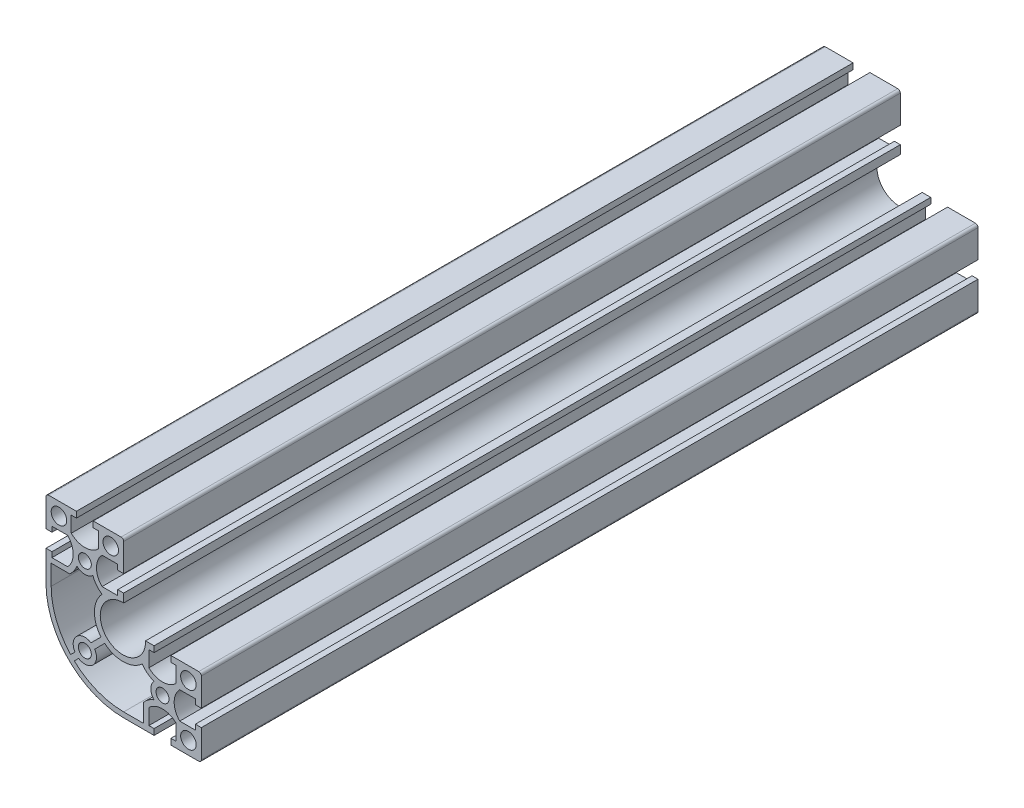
ISO-10303-21;
HEADER;
FILE_DESCRIPTION(('STEP AP214'),'2;1');
FILE_NAME('part.step','',(''),(''),'','','');
FILE_SCHEMA(('AUTOMOTIVE_DESIGN { 1 0 10303 214 1 1 1 1 }'));
ENDSEC;
DATA;
#1=APPLICATION_CONTEXT('core data for automotive mechanical design processes');
#2=APPLICATION_PROTOCOL_DEFINITION('international standard','automotive_design',2000,#1);
#3=PRODUCT_CONTEXT('',#1,'mechanical');
#4=PRODUCT('Part','Part','',(#3));
#5=PRODUCT_RELATED_PRODUCT_CATEGORY('part','',(#4));
#6=PRODUCT_DEFINITION_FORMATION('','',#4);
#7=PRODUCT_DEFINITION_CONTEXT('part definition',#1,'design');
#8=PRODUCT_DEFINITION('design','',#6,#7);
#9=PRODUCT_DEFINITION_SHAPE('','',#8);
#10=(LENGTH_UNIT() NAMED_UNIT(*) SI_UNIT(.MILLI.,.METRE.));
#11=(NAMED_UNIT(*) PLANE_ANGLE_UNIT() SI_UNIT($,.RADIAN.));
#12=(NAMED_UNIT(*) SI_UNIT($,.STERADIAN.) SOLID_ANGLE_UNIT());
#13=UNCERTAINTY_MEASURE_WITH_UNIT(LENGTH_MEASURE(1.E-05),#10,'distance_accuracy_value','');
#14=(GEOMETRIC_REPRESENTATION_CONTEXT(3) GLOBAL_UNCERTAINTY_ASSIGNED_CONTEXT((#13)) GLOBAL_UNIT_ASSIGNED_CONTEXT((#10,
#11,#12)) REPRESENTATION_CONTEXT('',''));
#15=CARTESIAN_POINT('',(0.,0.,0.));
#16=DIRECTION('',(0.,0.,1.));
#17=DIRECTION('',(1.,0.,0.));
#18=AXIS2_PLACEMENT_3D('',#15,#16,#17);
#19=CARTESIAN_POINT('',(15.2999999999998,-2.70000000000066,150.));
#20=DIRECTION('',(0.,0.,1.));
#21=DIRECTION('',(1.,0.,0.));
#22=AXIS2_PLACEMENT_3D('',#19,#20,#21);
#23=PLANE('',#22);
#24=CARTESIAN_POINT('',(25.2999999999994,-24.7000000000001,150.));
#25=DIRECTION('',(0.,0.,1.));
#26=DIRECTION('',(1.,0.,0.));
#27=AXIS2_PLACEMENT_3D('',#24,#25,#26);
#28=CIRCLE('',#27,3.);
#29=CARTESIAN_POINT('',(28.2999999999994,-24.7000000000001,150.));
#30=VERTEX_POINT('',#29);
#31=EDGE_CURVE('E2202',#30,#30,#28,.T.);
#32=ORIENTED_EDGE('',*,*,#31,.F.);
#33=EDGE_LOOP('',(#32));
#34=FACE_BOUND('',#33,.T.);
#35=CARTESIAN_POINT('',(15.2999999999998,-2.70000000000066,150.));
#36=DIRECTION('',(0.,0.,-1.));
#37=DIRECTION('',(1.,0.,0.));
#38=AXIS2_PLACEMENT_3D('',#35,#36,#37);
#39=CIRCLE('',#38,9.49999999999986);
#40=CARTESIAN_POINT('',(12.0223399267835,-11.6166666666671,150.));
#41=VERTEX_POINT('',#40);
#42=CARTESIAN_POINT('',(7.46785913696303,-8.07657600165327,150.));
#43=VERTEX_POINT('',#42);
#44=EDGE_CURVE('E540',#41,#43,#39,.T.);
#45=ORIENTED_EDGE('',*,*,#44,.F.);
#46=CARTESIAN_POINT('',(15.2999999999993,-14.7000000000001,150.));
#47=DIRECTION('',(0.,0.,-1.));
#48=DIRECTION('',(1.,0.,0.));
#49=AXIS2_PLACEMENT_3D('',#46,#47,#48);
#50=CIRCLE('',#49,4.49999999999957);
#51=CARTESIAN_POINT('',(12.0223399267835,-17.7833333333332,150.));
#52=VERTEX_POINT('',#51);
#53=EDGE_CURVE('E532',#52,#41,#50,.T.);
#54=ORIENTED_EDGE('',*,*,#53,.F.);
#55=CARTESIAN_POINT('',(15.2999999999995,-26.7000000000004,150.));
#56=DIRECTION('',(0.,0.,-1.));
#57=DIRECTION('',(1.,0.,0.));
#58=AXIS2_PLACEMENT_3D('',#55,#56,#57);
#59=CIRCLE('',#58,9.50000000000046);
#60=CARTESIAN_POINT('',(8.04999999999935,-20.5609854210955,150.));
#61=VERTEX_POINT('',#60);
#62=EDGE_CURVE('E571',#61,#52,#59,.T.);
#63=ORIENTED_EDGE('',*,*,#62,.F.);
#64=DIRECTION('',(0.,1.,0.));
#65=VECTOR('',#64,1.);
#66=CARTESIAN_POINT('',(8.04999999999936,-20.5609854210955,150.));
#67=LINE('',#66,#65);
#68=CARTESIAN_POINT('',(8.04999999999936,-27.7000000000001,150.));
#69=VERTEX_POINT('',#68);
#70=EDGE_CURVE('E569',#69,#61,#67,.T.);
#71=ORIENTED_EDGE('',*,*,#70,.F.);
#72=DIRECTION('',(1.,0.,0.));
#73=VECTOR('',#72,1.);
#74=CARTESIAN_POINT('',(8.04999999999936,-27.7000000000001,150.));
#75=LINE('',#74,#73);
#76=CARTESIAN_POINT('',(0.299999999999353,-27.7000000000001,150.));
#77=VERTEX_POINT('',#76);
#78=EDGE_CURVE('E567',#77,#69,#75,.T.);
#79=ORIENTED_EDGE('',*,*,#78,.F.);
#80=CARTESIAN_POINT('',(0.29999999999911,0.300000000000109,150.));
#81=DIRECTION('',(0.,0.,1.));
#82=DIRECTION('',(1.,0.,0.));
#83=AXIS2_PLACEMENT_3D('',#80,#81,#82);
#84=CIRCLE('',#83,28.);
#85=CARTESIAN_POINT('',(-18.7792521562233,-20.1934657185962,150.));
#86=VERTEX_POINT('',#85);
#87=EDGE_CURVE('E565',#86,#77,#84,.T.);
#88=ORIENTED_EDGE('',*,*,#87,.F.);
#89=DIRECTION('',(-0.707106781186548,-0.707106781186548,0.));
#90=VECTOR('',#89,1.);
#91=CARTESIAN_POINT('',(-18.7792521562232,-20.193465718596,150.));
#92=LINE('',#91,#90);
#93=CARTESIAN_POINT('',(-17.0953116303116,-18.5095251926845,150.));
#94=VERTEX_POINT('',#93);
#95=EDGE_CURVE('E563',#94,#86,#92,.T.);
#96=ORIENTED_EDGE('',*,*,#95,.F.);
#97=CARTESIAN_POINT('',(-14.7000000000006,-14.7000000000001,150.));
#98=DIRECTION('',(0.,0.,-1.));
#99=DIRECTION('',(1.,0.,0.));
#100=AXIS2_PLACEMENT_3D('',#97,#98,#99);
#101=CIRCLE('',#100,4.49999999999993);
#102=CARTESIAN_POINT('',(-10.8904748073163,-12.3046883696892,150.));
#103=VERTEX_POINT('',#102);
#104=EDGE_CURVE('E561',#103,#94,#101,.T.);
#105=ORIENTED_EDGE('',*,*,#104,.F.);
#106=DIRECTION('',(-0.707106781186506,-0.707106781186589,0.));
#107=VECTOR('',#106,1.);
#108=CARTESIAN_POINT('',(-10.8904748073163,-12.3046883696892,150.));
#109=LINE('',#108,#107);
#110=CARTESIAN_POINT('',(-7.0388599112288,-8.45307347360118,150.));
#111=VERTEX_POINT('',#110);
#112=EDGE_CURVE('E556',#111,#103,#109,.T.);
#113=ORIENTED_EDGE('',*,*,#112,.F.);
#114=CARTESIAN_POINT('',(0.,0.,150.));
#115=DIRECTION('',(0.,0.,-1.));
#116=DIRECTION('',(1.,0.,0.));
#117=AXIS2_PLACEMENT_3D('',#114,#115,#116);
#118=CIRCLE('',#117,11.0000000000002);
#119=EDGE_CURVE('E554',#43,#111,#118,.T.);
#120=ORIENTED_EDGE('',*,*,#119,.F.);
#121=EDGE_LOOP('',(#45,#54,#63,#71,#79,#88,#96,#105,#113,#120));
#122=FACE_BOUND('',#121,.T.);
#123=CARTESIAN_POINT('',(-14.7000000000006,-14.7000000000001,150.));
#124=DIRECTION('',(0.,0.,1.));
#125=DIRECTION('',(1.,0.,0.));
#126=AXIS2_PLACEMENT_3D('',#123,#124,#125);
#127=CIRCLE('',#126,2.5);
#128=CARTESIAN_POINT('',(-12.2000000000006,-14.7000000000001,150.));
#129=VERTEX_POINT('',#128);
#130=EDGE_CURVE('E687',#129,#129,#127,.T.);
#131=ORIENTED_EDGE('',*,*,#130,.F.);
#132=EDGE_LOOP('',(#131));
#133=FACE_BOUND('',#132,.T.);
#134=CARTESIAN_POINT('',(-24.7000000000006,25.2999999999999,150.));
#135=DIRECTION('',(0.,0.,1.));
#136=DIRECTION('',(1.,0.,0.));
#137=AXIS2_PLACEMENT_3D('',#134,#135,#136);
#138=CIRCLE('',#137,3.);
#139=CARTESIAN_POINT('',(-21.7000000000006,25.2999999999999,150.));
#140=VERTEX_POINT('',#139);
#141=EDGE_CURVE('E699',#140,#140,#138,.T.);
#142=ORIENTED_EDGE('',*,*,#141,.F.);
#143=EDGE_LOOP('',(#142));
#144=FACE_BOUND('',#143,.T.);
#145=DIRECTION('',(0.,1.,0.));
#146=VECTOR('',#145,1.);
#147=CARTESIAN_POINT('',(12.0499999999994,0.299999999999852,150.));
#148=LINE('',#147,#146);
#149=CARTESIAN_POINT('',(12.0499999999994,-2.00000000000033,150.));
#150=VERTEX_POINT('',#149);
#151=CARTESIAN_POINT('',(12.0499999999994,0.299999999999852,150.));
#152=VERTEX_POINT('',#151);
#153=EDGE_CURVE('E711',#150,#152,#148,.T.);
#154=ORIENTED_EDGE('',*,*,#153,.T.);
#155=DIRECTION('',(-1.,0.,0.));
#156=VECTOR('',#155,1.);
#157=CARTESIAN_POINT('',(8.74485563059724,0.299999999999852,150.));
#158=LINE('',#157,#156);
#159=CARTESIAN_POINT('',(8.74485563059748,0.299999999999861,150.));
#160=VERTEX_POINT('',#159);
#161=EDGE_CURVE('E714',#152,#160,#158,.T.);
#162=ORIENTED_EDGE('',*,*,#161,.T.);
#163=CARTESIAN_POINT('',(0.,0.,150.));
#164=DIRECTION('',(0.,0.,-1.));
#165=DIRECTION('',(1.,0.,0.));
#166=AXIS2_PLACEMENT_3D('',#163,#164,#165);
#167=CIRCLE('',#166,8.74999999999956);
#168=CARTESIAN_POINT('',(0.299999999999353,8.74485563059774,150.));
#169=VERTEX_POINT('',#168);
#170=EDGE_CURVE('E717',#160,#169,#167,.T.);
#171=ORIENTED_EDGE('',*,*,#170,.T.);
#172=DIRECTION('',(0.,1.,0.));
#173=VECTOR('',#172,1.);
#174=CARTESIAN_POINT('',(0.299999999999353,12.0499999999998,150.));
#175=LINE('',#174,#173);
#176=CARTESIAN_POINT('',(0.299999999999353,12.0499999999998,150.));
#177=VERTEX_POINT('',#176);
#178=EDGE_CURVE('E719',#169,#177,#175,.T.);
#179=ORIENTED_EDGE('',*,*,#178,.T.);
#180=DIRECTION('',(-1.,0.,0.));
#181=VECTOR('',#180,1.);
#182=CARTESIAN_POINT('',(-2.00000000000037,12.0499999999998,150.));
#183=LINE('',#182,#181);
#184=CARTESIAN_POINT('',(-2.00000000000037,12.0499999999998,150.));
#185=VERTEX_POINT('',#184);
#186=EDGE_CURVE('E721',#177,#185,#183,.T.);
#187=ORIENTED_EDGE('',*,*,#186,.T.);
#188=DIRECTION('',(0.,-1.,0.));
#189=VECTOR('',#188,1.);
#190=CARTESIAN_POINT('',(-2.00000000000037,10.0499999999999,150.));
#191=LINE('',#190,#189);
#192=CARTESIAN_POINT('',(-2.00000000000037,10.0499999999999,150.));
#193=VERTEX_POINT('',#192);
#194=EDGE_CURVE('E723',#185,#193,#191,.T.);
#195=ORIENTED_EDGE('',*,*,#194,.T.);
#196=DIRECTION('',(-1.,0.,0.));
#197=VECTOR('',#196,1.);
#198=CARTESIAN_POINT('',(-8.05607132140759,10.0499999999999,150.));
#199=LINE('',#198,#197);
#200=CARTESIAN_POINT('',(-8.0560713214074,10.05,150.));
#201=VERTEX_POINT('',#200);
#202=EDGE_CURVE('E725',#193,#201,#199,.T.);
#203=ORIENTED_EDGE('',*,*,#202,.T.);
#204=CARTESIAN_POINT('',(-2.7000000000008,15.3000000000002,150.));
#205=DIRECTION('',(0.,0.,-1.));
#206=DIRECTION('',(1.,0.,0.));
#207=AXIS2_PLACEMENT_3D('',#204,#205,#206);
#208=CIRCLE('',#207,7.49999999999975);
#209=CARTESIAN_POINT('',(-8.05607132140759,20.5499999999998,150.));
#210=VERTEX_POINT('',#209);
#211=EDGE_CURVE('E727',#201,#210,#208,.T.);
#212=ORIENTED_EDGE('',*,*,#211,.T.);
#213=DIRECTION('',(1.,0.,0.));
#214=VECTOR('',#213,1.);
#215=CARTESIAN_POINT('',(-2.00000000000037,20.5499999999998,150.));
#216=LINE('',#215,#214);
#217=CARTESIAN_POINT('',(-2.00000000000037,20.5499999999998,150.));
#218=VERTEX_POINT('',#217);
#219=EDGE_CURVE('E729',#210,#218,#216,.T.);
#220=ORIENTED_EDGE('',*,*,#219,.T.);
#221=DIRECTION('',(0.,-1.,0.));
#222=VECTOR('',#221,1.);
#223=CARTESIAN_POINT('',(-2.00000000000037,18.5499999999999,150.));
#224=LINE('',#223,#222);
#225=CARTESIAN_POINT('',(-2.00000000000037,18.5499999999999,150.));
#226=VERTEX_POINT('',#225);
#227=EDGE_CURVE('E731',#218,#226,#224,.T.);
#228=ORIENTED_EDGE('',*,*,#227,.T.);
#229=DIRECTION('',(1.,0.,0.));
#230=VECTOR('',#229,1.);
#231=CARTESIAN_POINT('',(0.299999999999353,18.5499999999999,150.));
#232=LINE('',#231,#230);
#233=CARTESIAN_POINT('',(0.299999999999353,18.5499999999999,150.));
#234=VERTEX_POINT('',#233);
#235=EDGE_CURVE('E733',#226,#234,#232,.T.);
#236=ORIENTED_EDGE('',*,*,#235,.T.);
#237=DIRECTION('',(0.,1.,0.));
#238=VECTOR('',#237,1.);
#239=CARTESIAN_POINT('',(0.299999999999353,29.2999999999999,150.));
#240=LINE('',#239,#238);
#241=CARTESIAN_POINT('',(0.299999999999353,29.2999999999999,150.));
#242=VERTEX_POINT('',#241);
#243=EDGE_CURVE('E735',#234,#242,#240,.T.);
#244=ORIENTED_EDGE('',*,*,#243,.T.);
#245=CARTESIAN_POINT('',(-0.700000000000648,29.2999999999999,150.));
#246=DIRECTION('',(0.,0.,1.));
#247=DIRECTION('',(1.,0.,0.));
#248=AXIS2_PLACEMENT_3D('',#245,#246,#247);
#249=CIRCLE('',#248,1.);
#250=CARTESIAN_POINT('',(-0.700000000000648,30.2999999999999,150.));
#251=VERTEX_POINT('',#250);
#252=EDGE_CURVE('E737',#242,#251,#249,.T.);
#253=ORIENTED_EDGE('',*,*,#252,.T.);
#254=DIRECTION('',(-1.,0.,0.));
#255=VECTOR('',#254,1.);
#256=CARTESIAN_POINT('',(-11.4500000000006,30.2999999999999,150.));
#257=LINE('',#256,#255);
#258=CARTESIAN_POINT('',(-11.4500000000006,30.2999999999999,150.));
#259=VERTEX_POINT('',#258);
#260=EDGE_CURVE('E739',#251,#259,#257,.T.);
#261=ORIENTED_EDGE('',*,*,#260,.T.);
#262=DIRECTION('',(0.,-1.,0.));
#263=VECTOR('',#262,1.);
#264=CARTESIAN_POINT('',(-11.4500000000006,27.9999999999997,150.));
#265=LINE('',#264,#263);
#266=CARTESIAN_POINT('',(-11.4500000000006,27.9999999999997,150.));
#267=VERTEX_POINT('',#266);
#268=EDGE_CURVE('E741',#259,#267,#265,.T.);
#269=ORIENTED_EDGE('',*,*,#268,.T.);
#270=DIRECTION('',(1.,0.,0.));
#271=VECTOR('',#270,1.);
#272=CARTESIAN_POINT('',(-9.45000000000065,27.9999999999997,150.));
#273=LINE('',#272,#271);
#274=CARTESIAN_POINT('',(-9.45000000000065,27.9999999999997,150.));
#275=VERTEX_POINT('',#274);
#276=EDGE_CURVE('E743',#267,#275,#273,.T.);
#277=ORIENTED_EDGE('',*,*,#276,.T.);
#278=DIRECTION('',(0.,-1.,0.));
#279=VECTOR('',#278,1.);
#280=CARTESIAN_POINT('',(-9.45000000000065,21.9439286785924,150.));
#281=LINE('',#280,#279);
#282=CARTESIAN_POINT('',(-9.45000000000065,21.9439286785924,150.));
#283=VERTEX_POINT('',#282);
#284=EDGE_CURVE('E745',#275,#283,#281,.T.);
#285=ORIENTED_EDGE('',*,*,#284,.T.);
#286=CARTESIAN_POINT('',(-14.7000000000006,27.2999999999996,150.));
#287=DIRECTION('',(0.,0.,-1.));
#288=DIRECTION('',(1.,0.,0.));
#289=AXIS2_PLACEMENT_3D('',#286,#287,#288);
#290=CIRCLE('',#289,7.49999999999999);
#291=CARTESIAN_POINT('',(-19.9500000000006,21.9439286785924,150.));
#292=VERTEX_POINT('',#291);
#293=EDGE_CURVE('E747',#283,#292,#290,.T.);
#294=ORIENTED_EDGE('',*,*,#293,.T.);
#295=DIRECTION('',(0.,1.,0.));
#296=VECTOR('',#295,1.);
#297=CARTESIAN_POINT('',(-19.9500000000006,27.9999999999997,150.));
#298=LINE('',#297,#296);
#299=CARTESIAN_POINT('',(-19.9500000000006,27.9999999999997,150.));
#300=VERTEX_POINT('',#299);
#301=EDGE_CURVE('E749',#292,#300,#298,.T.);
#302=ORIENTED_EDGE('',*,*,#301,.T.);
#303=DIRECTION('',(1.,0.,0.));
#304=VECTOR('',#303,1.);
#305=CARTESIAN_POINT('',(-17.9500000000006,27.9999999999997,150.));
#306=LINE('',#305,#304);
#307=CARTESIAN_POINT('',(-17.9500000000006,27.9999999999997,150.));
#308=VERTEX_POINT('',#307);
#309=EDGE_CURVE('E751',#300,#308,#306,.T.);
#310=ORIENTED_EDGE('',*,*,#309,.T.);
#311=DIRECTION('',(0.,1.,0.));
#312=VECTOR('',#311,1.);
#313=CARTESIAN_POINT('',(-17.9500000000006,30.2999999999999,150.));
#314=LINE('',#313,#312);
#315=CARTESIAN_POINT('',(-17.9500000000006,30.2999999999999,150.));
#316=VERTEX_POINT('',#315);
#317=EDGE_CURVE('E753',#308,#316,#314,.T.);
#318=ORIENTED_EDGE('',*,*,#317,.T.);
#319=DIRECTION('',(-1.,0.,0.));
#320=VECTOR('',#319,1.);
#321=CARTESIAN_POINT('',(-28.7000000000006,30.2999999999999,150.));
#322=LINE('',#321,#320);
#323=CARTESIAN_POINT('',(-28.7000000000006,30.2999999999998,150.));
#324=VERTEX_POINT('',#323);
#325=EDGE_CURVE('E755',#316,#324,#322,.T.);
#326=ORIENTED_EDGE('',*,*,#325,.T.);
#327=CARTESIAN_POINT('',(-28.7000000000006,29.2999999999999,150.));
#328=DIRECTION('',(0.,0.,1.));
#329=DIRECTION('',(1.,0.,0.));
#330=AXIS2_PLACEMENT_3D('',#327,#328,#329);
#331=CIRCLE('',#330,0.999999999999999);
#332=CARTESIAN_POINT('',(-29.7000000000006,29.2999999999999,150.));
#333=VERTEX_POINT('',#332);
#334=EDGE_CURVE('E757',#324,#333,#331,.T.);
#335=ORIENTED_EDGE('',*,*,#334,.T.);
#336=DIRECTION('',(0.,-1.,0.));
#337=VECTOR('',#336,1.);
#338=CARTESIAN_POINT('',(-29.7000000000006,18.5499999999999,150.));
#339=LINE('',#338,#337);
#340=CARTESIAN_POINT('',(-29.7000000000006,18.5499999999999,150.));
#341=VERTEX_POINT('',#340);
#342=EDGE_CURVE('E759',#333,#341,#339,.T.);
#343=ORIENTED_EDGE('',*,*,#342,.T.);
#344=DIRECTION('',(1.,0.,0.));
#345=VECTOR('',#344,1.);
#346=CARTESIAN_POINT('',(-27.4000000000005,18.5499999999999,150.));
#347=LINE('',#346,#345);
#348=CARTESIAN_POINT('',(-27.4000000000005,18.5499999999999,150.));
#349=VERTEX_POINT('',#348);
#350=EDGE_CURVE('E761',#341,#349,#347,.T.);
#351=ORIENTED_EDGE('',*,*,#350,.T.);
#352=DIRECTION('',(0.,1.,0.));
#353=VECTOR('',#352,1.);
#354=CARTESIAN_POINT('',(-27.4000000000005,20.5499999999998,150.));
#355=LINE('',#354,#353);
#356=CARTESIAN_POINT('',(-27.4000000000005,20.5499999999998,150.));
#357=VERTEX_POINT('',#356);
#358=EDGE_CURVE('E763',#349,#357,#355,.T.);
#359=ORIENTED_EDGE('',*,*,#358,.T.);
#360=DIRECTION('',(1.,0.,0.));
#361=VECTOR('',#360,1.);
#362=CARTESIAN_POINT('',(-21.3439286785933,20.5499999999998,150.));
#363=LINE('',#362,#361);
#364=CARTESIAN_POINT('',(-21.3439286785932,20.5499999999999,150.));
#365=VERTEX_POINT('',#364);
#366=EDGE_CURVE('E765',#357,#365,#363,.T.);
#367=ORIENTED_EDGE('',*,*,#366,.T.);
#368=CARTESIAN_POINT('',(-26.7000000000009,15.3,150.));
#369=DIRECTION('',(0.,0.,-1.));
#370=DIRECTION('',(1.,0.,0.));
#371=AXIS2_PLACEMENT_3D('',#368,#369,#370);
#372=CIRCLE('',#371,7.50000000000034);
#373=CARTESIAN_POINT('',(-21.3439286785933,10.0499999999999,150.));
#374=VERTEX_POINT('',#373);
#375=EDGE_CURVE('E767',#365,#374,#372,.T.);
#376=ORIENTED_EDGE('',*,*,#375,.T.);
#377=DIRECTION('',(-1.,0.,0.));
#378=VECTOR('',#377,1.);
#379=CARTESIAN_POINT('',(-27.4000000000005,10.0499999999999,150.));
#380=LINE('',#379,#378);
#381=CARTESIAN_POINT('',(-27.4000000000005,10.0499999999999,150.));
#382=VERTEX_POINT('',#381);
#383=EDGE_CURVE('E769',#374,#382,#380,.T.);
#384=ORIENTED_EDGE('',*,*,#383,.T.);
#385=DIRECTION('',(0.,1.,0.));
#386=VECTOR('',#385,1.);
#387=CARTESIAN_POINT('',(-27.4000000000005,12.0499999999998,150.));
#388=LINE('',#387,#386);
#389=CARTESIAN_POINT('',(-27.4000000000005,12.0499999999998,150.));
#390=VERTEX_POINT('',#389);
#391=EDGE_CURVE('E771',#382,#390,#388,.T.);
#392=ORIENTED_EDGE('',*,*,#391,.T.);
#393=DIRECTION('',(-1.,0.,0.));
#394=VECTOR('',#393,1.);
#395=CARTESIAN_POINT('',(-29.7000000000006,12.0499999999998,150.));
#396=LINE('',#395,#394);
#397=CARTESIAN_POINT('',(-29.7000000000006,12.0499999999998,150.));
#398=VERTEX_POINT('',#397);
#399=EDGE_CURVE('E773',#390,#398,#396,.T.);
#400=ORIENTED_EDGE('',*,*,#399,.T.);
#401=DIRECTION('',(0.,-1.,0.));
#402=VECTOR('',#401,1.);
#403=CARTESIAN_POINT('',(-29.7000000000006,0.299999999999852,150.));
#404=LINE('',#403,#402);
#405=CARTESIAN_POINT('',(-29.7000000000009,0.29999999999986,150.));
#406=VERTEX_POINT('',#405);
#407=EDGE_CURVE('E775',#398,#406,#404,.T.);
#408=ORIENTED_EDGE('',*,*,#407,.T.);
#409=CARTESIAN_POINT('',(0.29999999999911,0.300000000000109,150.));
#410=DIRECTION('',(0.,0.,1.));
#411=DIRECTION('',(1.,0.,0.));
#412=AXIS2_PLACEMENT_3D('',#409,#410,#411);
#413=CIRCLE('',#412,30.);
#414=CARTESIAN_POINT('',(0.299999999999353,-29.7000000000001,150.));
#415=VERTEX_POINT('',#414);
#416=EDGE_CURVE('E777',#406,#415,#413,.T.);
#417=ORIENTED_EDGE('',*,*,#416,.T.);
#418=DIRECTION('',(1.,0.,0.));
#419=VECTOR('',#418,1.);
#420=CARTESIAN_POINT('',(12.0499999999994,-29.7000000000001,150.));
#421=LINE('',#420,#419);
#422=CARTESIAN_POINT('',(12.0499999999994,-29.7000000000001,150.));
#423=VERTEX_POINT('',#422);
#424=EDGE_CURVE('E779',#415,#423,#421,.T.);
#425=ORIENTED_EDGE('',*,*,#424,.T.);
#426=DIRECTION('',(0.,1.,0.));
#427=VECTOR('',#426,1.);
#428=CARTESIAN_POINT('',(12.0499999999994,-27.4,150.));
#429=LINE('',#428,#427);
#430=CARTESIAN_POINT('',(12.0499999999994,-27.4,150.));
#431=VERTEX_POINT('',#430);
#432=EDGE_CURVE('E781',#423,#431,#429,.T.);
#433=ORIENTED_EDGE('',*,*,#432,.T.);
#434=DIRECTION('',(-1.,0.,0.));
#435=VECTOR('',#434,1.);
#436=CARTESIAN_POINT('',(10.0499999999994,-27.4,150.));
#437=LINE('',#436,#435);
#438=CARTESIAN_POINT('',(10.0499999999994,-27.4,150.));
#439=VERTEX_POINT('',#438);
#440=EDGE_CURVE('E783',#431,#439,#437,.T.);
#441=ORIENTED_EDGE('',*,*,#440,.T.);
#442=DIRECTION('',(0.,1.,0.));
#443=VECTOR('',#442,1.);
#444=CARTESIAN_POINT('',(10.0499999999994,-21.3439286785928,150.));
#445=LINE('',#444,#443);
#446=CARTESIAN_POINT('',(10.0499999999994,-21.3439286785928,150.));
#447=VERTEX_POINT('',#446);
#448=EDGE_CURVE('E785',#439,#447,#445,.T.);
#449=ORIENTED_EDGE('',*,*,#448,.T.);
#450=CARTESIAN_POINT('',(15.2999999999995,-26.7000000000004,150.));
#451=DIRECTION('',(0.,0.,-1.));
#452=DIRECTION('',(1.,0.,0.));
#453=AXIS2_PLACEMENT_3D('',#450,#451,#452);
#454=CIRCLE('',#453,7.50000000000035);
#455=CARTESIAN_POINT('',(20.5499999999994,-21.3439286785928,150.));
#456=VERTEX_POINT('',#455);
#457=EDGE_CURVE('E787',#447,#456,#454,.T.);
#458=ORIENTED_EDGE('',*,*,#457,.T.);
#459=DIRECTION('',(0.,-1.,0.));
#460=VECTOR('',#459,1.);
#461=CARTESIAN_POINT('',(20.5499999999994,-27.4,150.));
#462=LINE('',#461,#460);
#463=CARTESIAN_POINT('',(20.5499999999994,-27.4,150.));
#464=VERTEX_POINT('',#463);
#465=EDGE_CURVE('E789',#456,#464,#462,.T.);
#466=ORIENTED_EDGE('',*,*,#465,.T.);
#467=DIRECTION('',(-1.,0.,0.));
#468=VECTOR('',#467,1.);
#469=CARTESIAN_POINT('',(18.5499999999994,-27.4,150.));
#470=LINE('',#469,#468);
#471=CARTESIAN_POINT('',(18.5499999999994,-27.4,150.));
#472=VERTEX_POINT('',#471);
#473=EDGE_CURVE('E791',#464,#472,#470,.T.);
#474=ORIENTED_EDGE('',*,*,#473,.T.);
#475=DIRECTION('',(0.,-1.,0.));
#476=VECTOR('',#475,1.);
#477=CARTESIAN_POINT('',(18.5499999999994,-29.7000000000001,150.));
#478=LINE('',#477,#476);
#479=CARTESIAN_POINT('',(18.5499999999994,-29.7000000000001,150.));
#480=VERTEX_POINT('',#479);
#481=EDGE_CURVE('E793',#472,#480,#478,.T.);
#482=ORIENTED_EDGE('',*,*,#481,.T.);
#483=DIRECTION('',(1.,0.,0.));
#484=VECTOR('',#483,1.);
#485=CARTESIAN_POINT('',(29.2999999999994,-29.7000000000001,150.));
#486=LINE('',#485,#484);
#487=CARTESIAN_POINT('',(29.2999999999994,-29.7000000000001,150.));
#488=VERTEX_POINT('',#487);
#489=EDGE_CURVE('E795',#480,#488,#486,.T.);
#490=ORIENTED_EDGE('',*,*,#489,.T.);
#491=CARTESIAN_POINT('',(29.2999999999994,-28.7000000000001,150.));
#492=DIRECTION('',(0.,0.,1.));
#493=DIRECTION('',(1.,0.,0.));
#494=AXIS2_PLACEMENT_3D('',#491,#492,#493);
#495=CIRCLE('',#494,1.);
#496=CARTESIAN_POINT('',(30.2999999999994,-28.7000000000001,150.));
#497=VERTEX_POINT('',#496);
#498=EDGE_CURVE('E797',#488,#497,#495,.T.);
#499=ORIENTED_EDGE('',*,*,#498,.T.);
#500=DIRECTION('',(0.,1.,0.));
#501=VECTOR('',#500,1.);
#502=CARTESIAN_POINT('',(30.2999999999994,-17.9500000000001,150.));
#503=LINE('',#502,#501);
#504=CARTESIAN_POINT('',(30.2999999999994,-17.9500000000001,150.));
#505=VERTEX_POINT('',#504);
#506=EDGE_CURVE('E799',#497,#505,#503,.T.);
#507=ORIENTED_EDGE('',*,*,#506,.T.);
#508=DIRECTION('',(-1.,0.,0.));
#509=VECTOR('',#508,1.);
#510=CARTESIAN_POINT('',(27.9999999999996,-17.9500000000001,150.));
#511=LINE('',#510,#509);
#512=CARTESIAN_POINT('',(27.9999999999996,-17.9500000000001,150.));
#513=VERTEX_POINT('',#512);
#514=EDGE_CURVE('E801',#505,#513,#511,.T.);
#515=ORIENTED_EDGE('',*,*,#514,.T.);
#516=DIRECTION('',(0.,-1.,0.));
#517=VECTOR('',#516,1.);
#518=CARTESIAN_POINT('',(27.9999999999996,-19.9500000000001,150.));
#519=LINE('',#518,#517);
#520=CARTESIAN_POINT('',(27.9999999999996,-19.9500000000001,150.));
#521=VERTEX_POINT('',#520);
#522=EDGE_CURVE('E803',#513,#521,#519,.T.);
#523=ORIENTED_EDGE('',*,*,#522,.T.);
#524=DIRECTION('',(-1.,0.,0.));
#525=VECTOR('',#524,1.);
#526=CARTESIAN_POINT('',(21.9439286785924,-19.9500000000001,150.));
#527=LINE('',#526,#525);
#528=CARTESIAN_POINT('',(21.9439286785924,-19.9500000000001,150.));
#529=VERTEX_POINT('',#528);
#530=EDGE_CURVE('E805',#521,#529,#527,.T.);
#531=ORIENTED_EDGE('',*,*,#530,.T.);
#532=CARTESIAN_POINT('',(27.2999999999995,-14.7000000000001,150.));
#533=DIRECTION('',(0.,0.,-1.));
#534=DIRECTION('',(1.,0.,0.));
#535=AXIS2_PLACEMENT_3D('',#532,#533,#534);
#536=CIRCLE('',#535,7.49999999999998);
#537=CARTESIAN_POINT('',(21.9439286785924,-9.45000000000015,150.));
#538=VERTEX_POINT('',#537);
#539=EDGE_CURVE('E807',#529,#538,#536,.T.);
#540=ORIENTED_EDGE('',*,*,#539,.T.);
#541=DIRECTION('',(1.,0.,0.));
#542=VECTOR('',#541,1.);
#543=CARTESIAN_POINT('',(27.9999999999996,-9.45000000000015,150.));
#544=LINE('',#543,#542);
#545=CARTESIAN_POINT('',(27.9999999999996,-9.45000000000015,150.));
#546=VERTEX_POINT('',#545);
#547=EDGE_CURVE('E809',#538,#546,#544,.T.);
#548=ORIENTED_EDGE('',*,*,#547,.T.);
#549=DIRECTION('',(0.,-1.,0.));
#550=VECTOR('',#549,1.);
#551=CARTESIAN_POINT('',(27.9999999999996,-11.4500000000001,150.));
#552=LINE('',#551,#550);
#553=CARTESIAN_POINT('',(27.9999999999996,-11.4500000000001,150.));
#554=VERTEX_POINT('',#553);
#555=EDGE_CURVE('E811',#546,#554,#552,.T.);
#556=ORIENTED_EDGE('',*,*,#555,.T.);
#557=DIRECTION('',(1.,0.,0.));
#558=VECTOR('',#557,1.);
#559=CARTESIAN_POINT('',(30.2999999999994,-11.4500000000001,150.));
#560=LINE('',#559,#558);
#561=CARTESIAN_POINT('',(30.2999999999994,-11.4500000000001,150.));
#562=VERTEX_POINT('',#561);
#563=EDGE_CURVE('E813',#554,#562,#560,.T.);
#564=ORIENTED_EDGE('',*,*,#563,.T.);
#565=DIRECTION('',(0.,1.,0.));
#566=VECTOR('',#565,1.);
#567=CARTESIAN_POINT('',(30.2999999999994,-0.700000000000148,150.));
#568=LINE('',#567,#566);
#569=CARTESIAN_POINT('',(30.2999999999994,-0.700000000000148,150.));
#570=VERTEX_POINT('',#569);
#571=EDGE_CURVE('E815',#562,#570,#568,.T.);
#572=ORIENTED_EDGE('',*,*,#571,.T.);
#573=CARTESIAN_POINT('',(29.2999999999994,-0.700000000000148,150.));
#574=DIRECTION('',(0.,0.,1.));
#575=DIRECTION('',(1.,0.,0.));
#576=AXIS2_PLACEMENT_3D('',#573,#574,#575);
#577=CIRCLE('',#576,1.);
#578=CARTESIAN_POINT('',(29.2999999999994,0.299999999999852,150.));
#579=VERTEX_POINT('',#578);
#580=EDGE_CURVE('E817',#570,#579,#577,.T.);
#581=ORIENTED_EDGE('',*,*,#580,.T.);
#582=DIRECTION('',(-1.,0.,0.));
#583=VECTOR('',#582,1.);
#584=CARTESIAN_POINT('',(18.5499999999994,0.299999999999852,150.));
#585=LINE('',#584,#583);
#586=CARTESIAN_POINT('',(18.5499999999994,0.299999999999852,150.));
#587=VERTEX_POINT('',#586);
#588=EDGE_CURVE('E819',#579,#587,#585,.T.);
#589=ORIENTED_EDGE('',*,*,#588,.T.);
#590=DIRECTION('',(0.,-1.,0.));
#591=VECTOR('',#590,1.);
#592=CARTESIAN_POINT('',(18.5499999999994,-2.00000000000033,150.));
#593=LINE('',#592,#591);
#594=CARTESIAN_POINT('',(18.5499999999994,-2.00000000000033,150.));
#595=VERTEX_POINT('',#594);
#596=EDGE_CURVE('E821',#587,#595,#593,.T.);
#597=ORIENTED_EDGE('',*,*,#596,.T.);
#598=DIRECTION('',(1.,0.,0.));
#599=VECTOR('',#598,1.);
#600=CARTESIAN_POINT('',(20.5499999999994,-2.00000000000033,150.));
#601=LINE('',#600,#599);
#602=CARTESIAN_POINT('',(20.5499999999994,-2.00000000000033,150.));
#603=VERTEX_POINT('',#602);
#604=EDGE_CURVE('E823',#595,#603,#601,.T.);
#605=ORIENTED_EDGE('',*,*,#604,.T.);
#606=DIRECTION('',(0.,-1.,0.));
#607=VECTOR('',#606,1.);
#608=CARTESIAN_POINT('',(20.5499999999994,-8.05607132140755,150.));
#609=LINE('',#608,#607);
#610=CARTESIAN_POINT('',(20.5499999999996,-8.05607132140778,150.));
#611=VERTEX_POINT('',#610);
#612=EDGE_CURVE('E825',#603,#611,#609,.T.);
#613=ORIENTED_EDGE('',*,*,#612,.T.);
#614=CARTESIAN_POINT('',(15.2999999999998,-2.70000000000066,150.));
#615=DIRECTION('',(0.,0.,-1.));
#616=DIRECTION('',(1.,0.,0.));
#617=AXIS2_PLACEMENT_3D('',#614,#615,#616);
#618=CIRCLE('',#617,7.49999999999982);
#619=CARTESIAN_POINT('',(10.0499999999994,-8.05607132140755,150.));
#620=VERTEX_POINT('',#619);
#621=EDGE_CURVE('E827',#611,#620,#618,.T.);
#622=ORIENTED_EDGE('',*,*,#621,.T.);
#623=DIRECTION('',(0.,1.,0.));
#624=VECTOR('',#623,1.);
#625=CARTESIAN_POINT('',(10.0499999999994,-2.00000000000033,150.));
#626=LINE('',#625,#624);
#627=CARTESIAN_POINT('',(10.0499999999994,-2.00000000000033,150.));
#628=VERTEX_POINT('',#627);
#629=EDGE_CURVE('E829',#620,#628,#626,.T.);
#630=ORIENTED_EDGE('',*,*,#629,.T.);
#631=DIRECTION('',(1.,0.,0.));
#632=VECTOR('',#631,1.);
#633=CARTESIAN_POINT('',(12.0499999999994,-2.00000000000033,150.));
#634=LINE('',#633,#632);
#635=EDGE_CURVE('E831',#628,#150,#634,.T.);
#636=ORIENTED_EDGE('',*,*,#635,.T.);
#637=EDGE_LOOP('',(#154,#162,#171,#179,#187,#195,#203,#212,#220,#228,#236,#244,#253,#261,#269,
#277,#285,#294,#302,#310,#318,#326,#335,#343,#351,#359,#367,#376,#384,#392,#400,#408,#417,#425,
#433,#441,#449,#458,#466,#474,#482,#490,#499,#507,#515,#523,#531,#540,#548,#556,#564,#572,#581,
#589,#597,#605,#613,#622,#630,#636));
#638=FACE_BOUND('',#637,.T.);
#639=CARTESIAN_POINT('',(-4.70000000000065,25.2999999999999,150.));
#640=DIRECTION('',(0.,0.,1.));
#641=DIRECTION('',(1.,0.,0.));
#642=AXIS2_PLACEMENT_3D('',#639,#640,#641);
#643=CIRCLE('',#642,3.);
#644=CARTESIAN_POINT('',(-1.70000000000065,25.2999999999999,150.));
#645=VERTEX_POINT('',#644);
#646=EDGE_CURVE('E705',#645,#645,#643,.T.);
#647=ORIENTED_EDGE('',*,*,#646,.F.);
#648=EDGE_LOOP('',(#647));
#649=FACE_BOUND('',#648,.T.);
#650=CARTESIAN_POINT('',(-14.7000000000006,15.2999999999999,150.));
#651=DIRECTION('',(0.,0.,1.));
#652=DIRECTION('',(1.,0.,0.));
#653=AXIS2_PLACEMENT_3D('',#650,#651,#652);
#654=CIRCLE('',#653,2.5);
#655=CARTESIAN_POINT('',(-12.2000000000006,15.2999999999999,150.));
#656=VERTEX_POINT('',#655);
#657=EDGE_CURVE('E693',#656,#656,#654,.T.);
#658=ORIENTED_EDGE('',*,*,#657,.F.);
#659=EDGE_LOOP('',(#658));
#660=FACE_BOUND('',#659,.T.);
#661=DIRECTION('',(0.707106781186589,0.707106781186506,0.));
#662=VECTOR('',#661,1.);
#663=CARTESIAN_POINT('',(-8.45307347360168,-7.03885991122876,150.));
#664=LINE('',#663,#662);
#665=CARTESIAN_POINT('',(-12.3046883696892,-10.8904748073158,150.));
#666=VERTEX_POINT('',#665);
#667=CARTESIAN_POINT('',(-8.45307347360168,-7.03885991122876,150.));
#668=VERTEX_POINT('',#667);
#669=EDGE_CURVE('E616',#666,#668,#664,.T.);
#670=ORIENTED_EDGE('',*,*,#669,.F.);
#671=CARTESIAN_POINT('',(-14.7000000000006,-14.7000000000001,150.));
#672=DIRECTION('',(0.,0.,-1.));
#673=DIRECTION('',(1.,0.,0.));
#674=AXIS2_PLACEMENT_3D('',#671,#672,#673);
#675=CIRCLE('',#674,4.50000000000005);
#676=CARTESIAN_POINT('',(-18.509525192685,-17.0953116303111,150.));
#677=VERTEX_POINT('',#676);
#678=EDGE_CURVE('E614',#677,#666,#675,.T.);
#679=ORIENTED_EDGE('',*,*,#678,.F.);
#680=DIRECTION('',(0.707106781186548,0.707106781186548,0.));
#681=VECTOR('',#680,1.);
#682=CARTESIAN_POINT('',(-18.509525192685,-17.0953116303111,150.));
#683=LINE('',#682,#681);
#684=CARTESIAN_POINT('',(-20.1934657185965,-18.7792521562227,150.));
#685=VERTEX_POINT('',#684);
#686=EDGE_CURVE('E634',#685,#677,#683,.T.);
#687=ORIENTED_EDGE('',*,*,#686,.F.);
#688=CARTESIAN_POINT('',(0.29999999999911,0.300000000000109,150.));
#689=DIRECTION('',(0.,0.,1.));
#690=DIRECTION('',(1.,0.,0.));
#691=AXIS2_PLACEMENT_3D('',#688,#689,#690);
#692=CIRCLE('',#691,27.9999999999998);
#693=CARTESIAN_POINT('',(-27.7000000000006,0.299999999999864,150.));
#694=VERTEX_POINT('',#693);
#695=EDGE_CURVE('E631',#694,#685,#692,.T.);
#696=ORIENTED_EDGE('',*,*,#695,.F.);
#697=DIRECTION('',(0.,-1.,0.));
#698=VECTOR('',#697,1.);
#699=CARTESIAN_POINT('',(-27.7000000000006,0.299999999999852,150.));
#700=LINE('',#699,#698);
#701=CARTESIAN_POINT('',(-27.7000000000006,8.04999999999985,150.));
#702=VERTEX_POINT('',#701);
#703=EDGE_CURVE('E629',#702,#694,#700,.T.);
#704=ORIENTED_EDGE('',*,*,#703,.F.);
#705=DIRECTION('',(-1.,0.,0.));
#706=VECTOR('',#705,1.);
#707=CARTESIAN_POINT('',(-27.7000000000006,8.04999999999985,150.));
#708=LINE('',#707,#706);
#709=CARTESIAN_POINT('',(-20.560985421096,8.04999999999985,150.));
#710=VERTEX_POINT('',#709);
#711=EDGE_CURVE('E627',#710,#702,#708,.T.);
#712=ORIENTED_EDGE('',*,*,#711,.F.);
#713=CARTESIAN_POINT('',(-26.7000000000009,15.3,150.));
#714=DIRECTION('',(0.,0.,-1.));
#715=DIRECTION('',(1.,0.,0.));
#716=AXIS2_PLACEMENT_3D('',#713,#714,#715);
#717=CIRCLE('',#716,9.50000000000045);
#718=CARTESIAN_POINT('',(-17.7833333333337,12.022339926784,150.));
#719=VERTEX_POINT('',#718);
#720=EDGE_CURVE('E625',#719,#710,#717,.T.);
#721=ORIENTED_EDGE('',*,*,#720,.F.);
#722=CARTESIAN_POINT('',(-14.7000000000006,15.2999999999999,150.));
#723=DIRECTION('',(0.,0.,-1.));
#724=DIRECTION('',(1.,0.,0.));
#725=AXIS2_PLACEMENT_3D('',#722,#723,#724);
#726=CIRCLE('',#725,4.49999999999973);
#727=CARTESIAN_POINT('',(-11.6166666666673,12.0223399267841,150.));
#728=VERTEX_POINT('',#727);
#729=EDGE_CURVE('E623',#728,#719,#726,.T.);
#730=ORIENTED_EDGE('',*,*,#729,.F.);
#731=CARTESIAN_POINT('',(-2.7000000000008,15.3000000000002,150.));
#732=DIRECTION('',(0.,0.,-1.));
#733=DIRECTION('',(1.,0.,0.));
#734=AXIS2_PLACEMENT_3D('',#731,#732,#733);
#735=CIRCLE('',#734,9.49999999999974);
#736=CARTESIAN_POINT('',(-8.07657600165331,7.46785913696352,150.));
#737=VERTEX_POINT('',#736);
#738=EDGE_CURVE('E621',#737,#728,#735,.T.);
#739=ORIENTED_EDGE('',*,*,#738,.F.);
#740=CARTESIAN_POINT('',(0.,0.,150.));
#741=DIRECTION('',(0.,0.,-1.));
#742=DIRECTION('',(1.,0.,0.));
#743=AXIS2_PLACEMENT_3D('',#740,#741,#742);
#744=CIRCLE('',#743,11.0000000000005);
#745=EDGE_CURVE('E619',#668,#737,#744,.T.);
#746=ORIENTED_EDGE('',*,*,#745,.F.);
#747=EDGE_LOOP('',(#670,#679,#687,#696,#704,#712,#721,#730,#739,#746));
#748=FACE_BOUND('',#747,.T.);
#749=CARTESIAN_POINT('',(15.2999999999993,-14.7000000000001,150.));
#750=DIRECTION('',(0.,0.,1.));
#751=DIRECTION('',(1.,0.,0.));
#752=AXIS2_PLACEMENT_3D('',#749,#750,#751);
#753=CIRCLE('',#752,2.50000000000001);
#754=CARTESIAN_POINT('',(17.7999999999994,-14.7000000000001,150.));
#755=VERTEX_POINT('',#754);
#756=EDGE_CURVE('E574',#755,#755,#753,.T.);
#757=ORIENTED_EDGE('',*,*,#756,.F.);
#758=EDGE_LOOP('',(#757));
#759=FACE_BOUND('',#758,.T.);
#760=CARTESIAN_POINT('',(25.2999999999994,-4.70000000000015,150.));
#761=DIRECTION('',(0.,0.,1.));
#762=DIRECTION('',(1.,0.,0.));
#763=AXIS2_PLACEMENT_3D('',#760,#761,#762);
#764=CIRCLE('',#763,3.);
#765=CARTESIAN_POINT('',(28.2999999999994,-4.70000000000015,150.));
#766=VERTEX_POINT('',#765);
#767=EDGE_CURVE('E2193',#766,#766,#764,.T.);
#768=ORIENTED_EDGE('',*,*,#767,.F.);
#769=EDGE_LOOP('',(#768));
#770=FACE_BOUND('',#769,.T.);
#771=ADVANCED_FACE('F35',(#34,#122,#133,#144,#638,#649,#660,#748,#759,#770),#23,.T.);
#772=CARTESIAN_POINT('',(15.2999999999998,-2.70000000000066,-150.));
#773=DIRECTION('',(0.,0.,1.));
#774=DIRECTION('',(1.,0.,0.));
#775=AXIS2_PLACEMENT_3D('',#772,#773,#774);
#776=PLANE('',#775);
#777=CARTESIAN_POINT('',(25.2999999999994,-24.7000000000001,-150.));
#778=DIRECTION('',(0.,0.,1.));
#779=DIRECTION('',(1.,0.,0.));
#780=AXIS2_PLACEMENT_3D('',#777,#778,#779);
#781=CIRCLE('',#780,3.);
#782=CARTESIAN_POINT('',(28.2999999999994,-24.7000000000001,-150.));
#783=VERTEX_POINT('',#782);
#784=EDGE_CURVE('E2199',#783,#783,#781,.T.);
#785=ORIENTED_EDGE('',*,*,#784,.T.);
#786=EDGE_LOOP('',(#785));
#787=FACE_BOUND('',#786,.T.);
#788=CARTESIAN_POINT('',(15.2999999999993,-14.7000000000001,-150.));
#789=DIRECTION('',(0.,0.,-1.));
#790=DIRECTION('',(1.,0.,0.));
#791=AXIS2_PLACEMENT_3D('',#788,#789,#790);
#792=CIRCLE('',#791,4.49999999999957);
#793=CARTESIAN_POINT('',(12.0223399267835,-17.7833333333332,-150.));
#794=VERTEX_POINT('',#793);
#795=CARTESIAN_POINT('',(12.0223399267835,-11.6166666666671,-150.));
#796=VERTEX_POINT('',#795);
#797=EDGE_CURVE('E58',#794,#796,#792,.T.);
#798=ORIENTED_EDGE('',*,*,#797,.T.);
#799=CARTESIAN_POINT('',(15.2999999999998,-2.70000000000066,-150.));
#800=DIRECTION('',(0.,0.,-1.));
#801=DIRECTION('',(1.,0.,0.));
#802=AXIS2_PLACEMENT_3D('',#799,#800,#801);
#803=CIRCLE('',#802,9.49999999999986);
#804=CARTESIAN_POINT('',(7.46785913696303,-8.07657600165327,-150.));
#805=VERTEX_POINT('',#804);
#806=EDGE_CURVE('E547',#796,#805,#803,.T.);
#807=ORIENTED_EDGE('',*,*,#806,.T.);
#808=CARTESIAN_POINT('',(0.,0.,-150.));
#809=DIRECTION('',(0.,0.,-1.));
#810=DIRECTION('',(1.,0.,0.));
#811=AXIS2_PLACEMENT_3D('',#808,#809,#810);
#812=CIRCLE('',#811,11.0000000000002);
#813=CARTESIAN_POINT('',(-7.0388599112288,-8.45307347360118,-150.));
#814=VERTEX_POINT('',#813);
#815=EDGE_CURVE('E576',#805,#814,#812,.T.);
#816=ORIENTED_EDGE('',*,*,#815,.T.);
#817=DIRECTION('',(-0.707106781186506,-0.707106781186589,0.));
#818=VECTOR('',#817,1.);
#819=CARTESIAN_POINT('',(-10.8904748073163,-12.3046883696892,-150.));
#820=LINE('',#819,#818);
#821=CARTESIAN_POINT('',(-10.8904748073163,-12.3046883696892,-150.));
#822=VERTEX_POINT('',#821);
#823=EDGE_CURVE('E579',#814,#822,#820,.T.);
#824=ORIENTED_EDGE('',*,*,#823,.T.);
#825=CARTESIAN_POINT('',(-14.7000000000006,-14.7000000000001,-150.));
#826=DIRECTION('',(0.,0.,-1.));
#827=DIRECTION('',(1.,0.,0.));
#828=AXIS2_PLACEMENT_3D('',#825,#826,#827);
#829=CIRCLE('',#828,4.49999999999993);
#830=CARTESIAN_POINT('',(-17.0953116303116,-18.5095251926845,-150.));
#831=VERTEX_POINT('',#830);
#832=EDGE_CURVE('E582',#822,#831,#829,.T.);
#833=ORIENTED_EDGE('',*,*,#832,.T.);
#834=DIRECTION('',(-0.707106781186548,-0.707106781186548,0.));
#835=VECTOR('',#834,1.);
#836=CARTESIAN_POINT('',(-18.7792521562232,-20.193465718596,-150.));
#837=LINE('',#836,#835);
#838=CARTESIAN_POINT('',(-18.7792521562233,-20.1934657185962,-150.));
#839=VERTEX_POINT('',#838);
#840=EDGE_CURVE('E585',#831,#839,#837,.T.);
#841=ORIENTED_EDGE('',*,*,#840,.T.);
#842=CARTESIAN_POINT('',(0.29999999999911,0.300000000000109,-150.));
#843=DIRECTION('',(0.,0.,1.));
#844=DIRECTION('',(1.,0.,0.));
#845=AXIS2_PLACEMENT_3D('',#842,#843,#844);
#846=CIRCLE('',#845,28.);
#847=CARTESIAN_POINT('',(0.299999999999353,-27.7000000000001,-150.));
#848=VERTEX_POINT('',#847);
#849=EDGE_CURVE('E588',#839,#848,#846,.T.);
#850=ORIENTED_EDGE('',*,*,#849,.T.);
#851=DIRECTION('',(1.,0.,0.));
#852=VECTOR('',#851,1.);
#853=CARTESIAN_POINT('',(8.04999999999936,-27.7000000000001,-150.));
#854=LINE('',#853,#852);
#855=CARTESIAN_POINT('',(8.04999999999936,-27.7000000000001,-150.));
#856=VERTEX_POINT('',#855);
#857=EDGE_CURVE('E591',#848,#856,#854,.T.);
#858=ORIENTED_EDGE('',*,*,#857,.T.);
#859=DIRECTION('',(0.,1.,0.));
#860=VECTOR('',#859,1.);
#861=CARTESIAN_POINT('',(8.04999999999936,-20.5609854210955,-150.));
#862=LINE('',#861,#860);
#863=CARTESIAN_POINT('',(8.04999999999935,-20.5609854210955,-150.));
#864=VERTEX_POINT('',#863);
#865=EDGE_CURVE('E594',#856,#864,#862,.T.);
#866=ORIENTED_EDGE('',*,*,#865,.T.);
#867=CARTESIAN_POINT('',(15.2999999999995,-26.7000000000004,-150.));
#868=DIRECTION('',(0.,0.,-1.));
#869=DIRECTION('',(1.,0.,0.));
#870=AXIS2_PLACEMENT_3D('',#867,#868,#869);
#871=CIRCLE('',#870,9.50000000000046);
#872=EDGE_CURVE('E541',#864,#794,#871,.T.);
#873=ORIENTED_EDGE('',*,*,#872,.T.);
#874=EDGE_LOOP('',(#798,#807,#816,#824,#833,#841,#850,#858,#866,#873));
#875=FACE_BOUND('',#874,.T.);
#876=CARTESIAN_POINT('',(-14.7000000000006,-14.7000000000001,-150.));
#877=DIRECTION('',(0.,0.,1.));
#878=DIRECTION('',(1.,0.,0.));
#879=AXIS2_PLACEMENT_3D('',#876,#877,#878);
#880=CIRCLE('',#879,2.5);
#881=CARTESIAN_POINT('',(-12.2000000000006,-14.7000000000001,-150.));
#882=VERTEX_POINT('',#881);
#883=EDGE_CURVE('E686',#882,#882,#880,.T.);
#884=ORIENTED_EDGE('',*,*,#883,.T.);
#885=EDGE_LOOP('',(#884));
#886=FACE_BOUND('',#885,.T.);
#887=CARTESIAN_POINT('',(-24.7000000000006,25.2999999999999,-150.));
#888=DIRECTION('',(0.,0.,1.));
#889=DIRECTION('',(1.,0.,0.));
#890=AXIS2_PLACEMENT_3D('',#887,#888,#889);
#891=CIRCLE('',#890,3.);
#892=CARTESIAN_POINT('',(-21.7000000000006,25.2999999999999,-150.));
#893=VERTEX_POINT('',#892);
#894=EDGE_CURVE('E696',#893,#893,#891,.T.);
#895=ORIENTED_EDGE('',*,*,#894,.T.);
#896=EDGE_LOOP('',(#895));
#897=FACE_BOUND('',#896,.T.);
#898=DIRECTION('',(0.,1.,0.));
#899=VECTOR('',#898,1.);
#900=CARTESIAN_POINT('',(12.0499999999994,0.299999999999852,-150.));
#901=LINE('',#900,#899);
#902=CARTESIAN_POINT('',(12.0499999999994,-2.00000000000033,-150.));
#903=VERTEX_POINT('',#902);
#904=CARTESIAN_POINT('',(12.0499999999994,0.299999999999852,-150.));
#905=VERTEX_POINT('',#904);
#906=EDGE_CURVE('E708',#903,#905,#901,.T.);
#907=ORIENTED_EDGE('',*,*,#906,.F.);
#908=DIRECTION('',(1.,0.,0.));
#909=VECTOR('',#908,1.);
#910=CARTESIAN_POINT('',(12.0499999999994,-2.00000000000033,-150.));
#911=LINE('',#910,#909);
#912=CARTESIAN_POINT('',(10.0499999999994,-2.00000000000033,-150.));
#913=VERTEX_POINT('',#912);
#914=EDGE_CURVE('E715',#913,#903,#911,.T.);
#915=ORIENTED_EDGE('',*,*,#914,.F.);
#916=DIRECTION('',(0.,1.,0.));
#917=VECTOR('',#916,1.);
#918=CARTESIAN_POINT('',(10.0499999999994,-2.00000000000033,-150.));
#919=LINE('',#918,#917);
#920=CARTESIAN_POINT('',(10.0499999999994,-8.05607132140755,-150.));
#921=VERTEX_POINT('',#920);
#922=EDGE_CURVE('E950',#921,#913,#919,.T.);
#923=ORIENTED_EDGE('',*,*,#922,.F.);
#924=CARTESIAN_POINT('',(15.2999999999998,-2.70000000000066,-150.));
#925=DIRECTION('',(0.,0.,-1.));
#926=DIRECTION('',(1.,0.,0.));
#927=AXIS2_PLACEMENT_3D('',#924,#925,#926);
#928=CIRCLE('',#927,7.49999999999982);
#929=CARTESIAN_POINT('',(20.5499999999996,-8.05607132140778,-150.));
#930=VERTEX_POINT('',#929);
#931=EDGE_CURVE('E948',#930,#921,#928,.T.);
#932=ORIENTED_EDGE('',*,*,#931,.F.);
#933=DIRECTION('',(0.,-1.,0.));
#934=VECTOR('',#933,1.);
#935=CARTESIAN_POINT('',(20.5499999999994,-8.05607132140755,-150.));
#936=LINE('',#935,#934);
#937=CARTESIAN_POINT('',(20.5499999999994,-2.00000000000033,-150.));
#938=VERTEX_POINT('',#937);
#939=EDGE_CURVE('E946',#938,#930,#936,.T.);
#940=ORIENTED_EDGE('',*,*,#939,.F.);
#941=DIRECTION('',(1.,0.,0.));
#942=VECTOR('',#941,1.);
#943=CARTESIAN_POINT('',(20.5499999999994,-2.00000000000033,-150.));
#944=LINE('',#943,#942);
#945=CARTESIAN_POINT('',(18.5499999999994,-2.00000000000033,-150.));
#946=VERTEX_POINT('',#945);
#947=EDGE_CURVE('E944',#946,#938,#944,.T.);
#948=ORIENTED_EDGE('',*,*,#947,.F.);
#949=DIRECTION('',(0.,-1.,0.));
#950=VECTOR('',#949,1.);
#951=CARTESIAN_POINT('',(18.5499999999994,-2.00000000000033,-150.));
#952=LINE('',#951,#950);
#953=CARTESIAN_POINT('',(18.5499999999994,0.299999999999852,-150.));
#954=VERTEX_POINT('',#953);
#955=EDGE_CURVE('E942',#954,#946,#952,.T.);
#956=ORIENTED_EDGE('',*,*,#955,.F.);
#957=DIRECTION('',(-1.,0.,0.));
#958=VECTOR('',#957,1.);
#959=CARTESIAN_POINT('',(18.5499999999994,0.299999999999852,-150.));
#960=LINE('',#959,#958);
#961=CARTESIAN_POINT('',(29.2999999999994,0.299999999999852,-150.));
#962=VERTEX_POINT('',#961);
#963=EDGE_CURVE('E940',#962,#954,#960,.T.);
#964=ORIENTED_EDGE('',*,*,#963,.F.);
#965=CARTESIAN_POINT('',(29.2999999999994,-0.700000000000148,-150.));
#966=DIRECTION('',(0.,0.,1.));
#967=DIRECTION('',(1.,0.,0.));
#968=AXIS2_PLACEMENT_3D('',#965,#966,#967);
#969=CIRCLE('',#968,1.);
#970=CARTESIAN_POINT('',(30.2999999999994,-0.700000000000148,-150.));
#971=VERTEX_POINT('',#970);
#972=EDGE_CURVE('E938',#971,#962,#969,.T.);
#973=ORIENTED_EDGE('',*,*,#972,.F.);
#974=DIRECTION('',(0.,1.,0.));
#975=VECTOR('',#974,1.);
#976=CARTESIAN_POINT('',(30.2999999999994,-0.700000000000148,-150.));
#977=LINE('',#976,#975);
#978=CARTESIAN_POINT('',(30.2999999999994,-11.4500000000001,-150.));
#979=VERTEX_POINT('',#978);
#980=EDGE_CURVE('E936',#979,#971,#977,.T.);
#981=ORIENTED_EDGE('',*,*,#980,.F.);
#982=DIRECTION('',(1.,0.,0.));
#983=VECTOR('',#982,1.);
#984=CARTESIAN_POINT('',(30.2999999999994,-11.4500000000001,-150.));
#985=LINE('',#984,#983);
#986=CARTESIAN_POINT('',(27.9999999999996,-11.4500000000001,-150.));
#987=VERTEX_POINT('',#986);
#988=EDGE_CURVE('E934',#987,#979,#985,.T.);
#989=ORIENTED_EDGE('',*,*,#988,.F.);
#990=DIRECTION('',(0.,-1.,0.));
#991=VECTOR('',#990,1.);
#992=CARTESIAN_POINT('',(27.9999999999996,-11.4500000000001,-150.));
#993=LINE('',#992,#991);
#994=CARTESIAN_POINT('',(27.9999999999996,-9.45000000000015,-150.));
#995=VERTEX_POINT('',#994);
#996=EDGE_CURVE('E932',#995,#987,#993,.T.);
#997=ORIENTED_EDGE('',*,*,#996,.F.);
#998=DIRECTION('',(1.,0.,0.));
#999=VECTOR('',#998,1.);
#1000=CARTESIAN_POINT('',(27.9999999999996,-9.45000000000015,-150.));
#1001=LINE('',#1000,#999);
#1002=CARTESIAN_POINT('',(21.9439286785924,-9.45000000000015,-150.));
#1003=VERTEX_POINT('',#1002);
#1004=EDGE_CURVE('E930',#1003,#995,#1001,.T.);
#1005=ORIENTED_EDGE('',*,*,#1004,.F.);
#1006=CARTESIAN_POINT('',(27.2999999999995,-14.7000000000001,-150.));
#1007=DIRECTION('',(0.,0.,-1.));
#1008=DIRECTION('',(1.,0.,0.));
#1009=AXIS2_PLACEMENT_3D('',#1006,#1007,#1008);
#1010=CIRCLE('',#1009,7.49999999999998);
#1011=CARTESIAN_POINT('',(21.9439286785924,-19.9500000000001,-150.));
#1012=VERTEX_POINT('',#1011);
#1013=EDGE_CURVE('E928',#1012,#1003,#1010,.T.);
#1014=ORIENTED_EDGE('',*,*,#1013,.F.);
#1015=DIRECTION('',(-1.,0.,0.));
#1016=VECTOR('',#1015,1.);
#1017=CARTESIAN_POINT('',(21.9439286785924,-19.9500000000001,-150.));
#1018=LINE('',#1017,#1016);
#1019=CARTESIAN_POINT('',(27.9999999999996,-19.9500000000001,-150.));
#1020=VERTEX_POINT('',#1019);
#1021=EDGE_CURVE('E926',#1020,#1012,#1018,.T.);
#1022=ORIENTED_EDGE('',*,*,#1021,.F.);
#1023=DIRECTION('',(0.,-1.,0.));
#1024=VECTOR('',#1023,1.);
#1025=CARTESIAN_POINT('',(27.9999999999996,-19.9500000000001,-150.));
#1026=LINE('',#1025,#1024);
#1027=CARTESIAN_POINT('',(27.9999999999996,-17.9500000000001,-150.));
#1028=VERTEX_POINT('',#1027);
#1029=EDGE_CURVE('E924',#1028,#1020,#1026,.T.);
#1030=ORIENTED_EDGE('',*,*,#1029,.F.);
#1031=DIRECTION('',(-1.,0.,0.));
#1032=VECTOR('',#1031,1.);
#1033=CARTESIAN_POINT('',(27.9999999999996,-17.9500000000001,-150.));
#1034=LINE('',#1033,#1032);
#1035=CARTESIAN_POINT('',(30.2999999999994,-17.9500000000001,-150.));
#1036=VERTEX_POINT('',#1035);
#1037=EDGE_CURVE('E922',#1036,#1028,#1034,.T.);
#1038=ORIENTED_EDGE('',*,*,#1037,.F.);
#1039=DIRECTION('',(0.,1.,0.));
#1040=VECTOR('',#1039,1.);
#1041=CARTESIAN_POINT('',(30.2999999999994,-17.9500000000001,-150.));
#1042=LINE('',#1041,#1040);
#1043=CARTESIAN_POINT('',(30.2999999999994,-28.7000000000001,-150.));
#1044=VERTEX_POINT('',#1043);
#1045=EDGE_CURVE('E920',#1044,#1036,#1042,.T.);
#1046=ORIENTED_EDGE('',*,*,#1045,.F.);
#1047=CARTESIAN_POINT('',(29.2999999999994,-28.7000000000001,-150.));
#1048=DIRECTION('',(0.,0.,1.));
#1049=DIRECTION('',(1.,0.,0.));
#1050=AXIS2_PLACEMENT_3D('',#1047,#1048,#1049);
#1051=CIRCLE('',#1050,1.);
#1052=CARTESIAN_POINT('',(29.2999999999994,-29.7000000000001,-150.));
#1053=VERTEX_POINT('',#1052);
#1054=EDGE_CURVE('E918',#1053,#1044,#1051,.T.);
#1055=ORIENTED_EDGE('',*,*,#1054,.F.);
#1056=DIRECTION('',(1.,0.,0.));
#1057=VECTOR('',#1056,1.);
#1058=CARTESIAN_POINT('',(29.2999999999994,-29.7000000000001,-150.));
#1059=LINE('',#1058,#1057);
#1060=CARTESIAN_POINT('',(18.5499999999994,-29.7000000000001,-150.));
#1061=VERTEX_POINT('',#1060);
#1062=EDGE_CURVE('E916',#1061,#1053,#1059,.T.);
#1063=ORIENTED_EDGE('',*,*,#1062,.F.);
#1064=DIRECTION('',(0.,-1.,0.));
#1065=VECTOR('',#1064,1.);
#1066=CARTESIAN_POINT('',(18.5499999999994,-29.7000000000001,-150.));
#1067=LINE('',#1066,#1065);
#1068=CARTESIAN_POINT('',(18.5499999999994,-27.4,-150.));
#1069=VERTEX_POINT('',#1068);
#1070=EDGE_CURVE('E914',#1069,#1061,#1067,.T.);
#1071=ORIENTED_EDGE('',*,*,#1070,.F.);
#1072=DIRECTION('',(-1.,0.,0.));
#1073=VECTOR('',#1072,1.);
#1074=CARTESIAN_POINT('',(18.5499999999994,-27.4,-150.));
#1075=LINE('',#1074,#1073);
#1076=CARTESIAN_POINT('',(20.5499999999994,-27.4,-150.));
#1077=VERTEX_POINT('',#1076);
#1078=EDGE_CURVE('E912',#1077,#1069,#1075,.T.);
#1079=ORIENTED_EDGE('',*,*,#1078,.F.);
#1080=DIRECTION('',(0.,-1.,0.));
#1081=VECTOR('',#1080,1.);
#1082=CARTESIAN_POINT('',(20.5499999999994,-27.4,-150.));
#1083=LINE('',#1082,#1081);
#1084=CARTESIAN_POINT('',(20.5499999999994,-21.3439286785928,-150.));
#1085=VERTEX_POINT('',#1084);
#1086=EDGE_CURVE('E910',#1085,#1077,#1083,.T.);
#1087=ORIENTED_EDGE('',*,*,#1086,.F.);
#1088=CARTESIAN_POINT('',(15.2999999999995,-26.7000000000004,-150.));
#1089=DIRECTION('',(0.,0.,-1.));
#1090=DIRECTION('',(1.,0.,0.));
#1091=AXIS2_PLACEMENT_3D('',#1088,#1089,#1090);
#1092=CIRCLE('',#1091,7.50000000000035);
#1093=CARTESIAN_POINT('',(10.0499999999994,-21.3439286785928,-150.));
#1094=VERTEX_POINT('',#1093);
#1095=EDGE_CURVE('E908',#1094,#1085,#1092,.T.);
#1096=ORIENTED_EDGE('',*,*,#1095,.F.);
#1097=DIRECTION('',(0.,1.,0.));
#1098=VECTOR('',#1097,1.);
#1099=CARTESIAN_POINT('',(10.0499999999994,-21.3439286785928,-150.));
#1100=LINE('',#1099,#1098);
#1101=CARTESIAN_POINT('',(10.0499999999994,-27.4,-150.));
#1102=VERTEX_POINT('',#1101);
#1103=EDGE_CURVE('E906',#1102,#1094,#1100,.T.);
#1104=ORIENTED_EDGE('',*,*,#1103,.F.);
#1105=DIRECTION('',(-1.,0.,0.));
#1106=VECTOR('',#1105,1.);
#1107=CARTESIAN_POINT('',(10.0499999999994,-27.4,-150.));
#1108=LINE('',#1107,#1106);
#1109=CARTESIAN_POINT('',(12.0499999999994,-27.4,-150.));
#1110=VERTEX_POINT('',#1109);
#1111=EDGE_CURVE('E904',#1110,#1102,#1108,.T.);
#1112=ORIENTED_EDGE('',*,*,#1111,.F.);
#1113=DIRECTION('',(0.,1.,0.));
#1114=VECTOR('',#1113,1.);
#1115=CARTESIAN_POINT('',(12.0499999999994,-27.4,-150.));
#1116=LINE('',#1115,#1114);
#1117=CARTESIAN_POINT('',(12.0499999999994,-29.7000000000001,-150.));
#1118=VERTEX_POINT('',#1117);
#1119=EDGE_CURVE('E902',#1118,#1110,#1116,.T.);
#1120=ORIENTED_EDGE('',*,*,#1119,.F.);
#1121=DIRECTION('',(1.,0.,0.));
#1122=VECTOR('',#1121,1.);
#1123=CARTESIAN_POINT('',(12.0499999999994,-29.7000000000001,-150.));
#1124=LINE('',#1123,#1122);
#1125=CARTESIAN_POINT('',(0.299999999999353,-29.7000000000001,-150.));
#1126=VERTEX_POINT('',#1125);
#1127=EDGE_CURVE('E900',#1126,#1118,#1124,.T.);
#1128=ORIENTED_EDGE('',*,*,#1127,.F.);
#1129=CARTESIAN_POINT('',(0.29999999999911,0.300000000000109,-150.));
#1130=DIRECTION('',(0.,0.,1.));
#1131=DIRECTION('',(1.,0.,0.));
#1132=AXIS2_PLACEMENT_3D('',#1129,#1130,#1131);
#1133=CIRCLE('',#1132,30.);
#1134=CARTESIAN_POINT('',(-29.7000000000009,0.29999999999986,-150.));
#1135=VERTEX_POINT('',#1134);
#1136=EDGE_CURVE('E898',#1135,#1126,#1133,.T.);
#1137=ORIENTED_EDGE('',*,*,#1136,.F.);
#1138=DIRECTION('',(0.,-1.,0.));
#1139=VECTOR('',#1138,1.);
#1140=CARTESIAN_POINT('',(-29.7000000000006,0.299999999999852,-150.));
#1141=LINE('',#1140,#1139);
#1142=CARTESIAN_POINT('',(-29.7000000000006,12.0499999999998,-150.));
#1143=VERTEX_POINT('',#1142);
#1144=EDGE_CURVE('E896',#1143,#1135,#1141,.T.);
#1145=ORIENTED_EDGE('',*,*,#1144,.F.);
#1146=DIRECTION('',(-1.,0.,0.));
#1147=VECTOR('',#1146,1.);
#1148=CARTESIAN_POINT('',(-29.7000000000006,12.0499999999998,-150.));
#1149=LINE('',#1148,#1147);
#1150=CARTESIAN_POINT('',(-27.4000000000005,12.0499999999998,-150.));
#1151=VERTEX_POINT('',#1150);
#1152=EDGE_CURVE('E894',#1151,#1143,#1149,.T.);
#1153=ORIENTED_EDGE('',*,*,#1152,.F.);
#1154=DIRECTION('',(0.,1.,0.));
#1155=VECTOR('',#1154,1.);
#1156=CARTESIAN_POINT('',(-27.4000000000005,12.0499999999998,-150.));
#1157=LINE('',#1156,#1155);
#1158=CARTESIAN_POINT('',(-27.4000000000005,10.0499999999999,-150.));
#1159=VERTEX_POINT('',#1158);
#1160=EDGE_CURVE('E892',#1159,#1151,#1157,.T.);
#1161=ORIENTED_EDGE('',*,*,#1160,.F.);
#1162=DIRECTION('',(-1.,0.,0.));
#1163=VECTOR('',#1162,1.);
#1164=CARTESIAN_POINT('',(-27.4000000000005,10.0499999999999,-150.));
#1165=LINE('',#1164,#1163);
#1166=CARTESIAN_POINT('',(-21.3439286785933,10.0499999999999,-150.));
#1167=VERTEX_POINT('',#1166);
#1168=EDGE_CURVE('E890',#1167,#1159,#1165,.T.);
#1169=ORIENTED_EDGE('',*,*,#1168,.F.);
#1170=CARTESIAN_POINT('',(-26.7000000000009,15.3,-150.));
#1171=DIRECTION('',(0.,0.,-1.));
#1172=DIRECTION('',(1.,0.,0.));
#1173=AXIS2_PLACEMENT_3D('',#1170,#1171,#1172);
#1174=CIRCLE('',#1173,7.50000000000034);
#1175=CARTESIAN_POINT('',(-21.3439286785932,20.5499999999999,-150.));
#1176=VERTEX_POINT('',#1175);
#1177=EDGE_CURVE('E888',#1176,#1167,#1174,.T.);
#1178=ORIENTED_EDGE('',*,*,#1177,.F.);
#1179=DIRECTION('',(1.,0.,0.));
#1180=VECTOR('',#1179,1.);
#1181=CARTESIAN_POINT('',(-21.3439286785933,20.5499999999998,-150.));
#1182=LINE('',#1181,#1180);
#1183=CARTESIAN_POINT('',(-27.4000000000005,20.5499999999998,-150.));
#1184=VERTEX_POINT('',#1183);
#1185=EDGE_CURVE('E886',#1184,#1176,#1182,.T.);
#1186=ORIENTED_EDGE('',*,*,#1185,.F.);
#1187=DIRECTION('',(0.,1.,0.));
#1188=VECTOR('',#1187,1.);
#1189=CARTESIAN_POINT('',(-27.4000000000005,20.5499999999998,-150.));
#1190=LINE('',#1189,#1188);
#1191=CARTESIAN_POINT('',(-27.4000000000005,18.5499999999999,-150.));
#1192=VERTEX_POINT('',#1191);
#1193=EDGE_CURVE('E884',#1192,#1184,#1190,.T.);
#1194=ORIENTED_EDGE('',*,*,#1193,.F.);
#1195=DIRECTION('',(1.,0.,0.));
#1196=VECTOR('',#1195,1.);
#1197=CARTESIAN_POINT('',(-27.4000000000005,18.5499999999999,-150.));
#1198=LINE('',#1197,#1196);
#1199=CARTESIAN_POINT('',(-29.7000000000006,18.5499999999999,-150.));
#1200=VERTEX_POINT('',#1199);
#1201=EDGE_CURVE('E882',#1200,#1192,#1198,.T.);
#1202=ORIENTED_EDGE('',*,*,#1201,.F.);
#1203=DIRECTION('',(0.,-1.,0.));
#1204=VECTOR('',#1203,1.);
#1205=CARTESIAN_POINT('',(-29.7000000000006,18.5499999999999,-150.));
#1206=LINE('',#1205,#1204);
#1207=CARTESIAN_POINT('',(-29.7000000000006,29.2999999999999,-150.));
#1208=VERTEX_POINT('',#1207);
#1209=EDGE_CURVE('E880',#1208,#1200,#1206,.T.);
#1210=ORIENTED_EDGE('',*,*,#1209,.F.);
#1211=CARTESIAN_POINT('',(-28.7000000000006,29.2999999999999,-150.));
#1212=DIRECTION('',(0.,0.,1.));
#1213=DIRECTION('',(1.,0.,0.));
#1214=AXIS2_PLACEMENT_3D('',#1211,#1212,#1213);
#1215=CIRCLE('',#1214,0.999999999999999);
#1216=CARTESIAN_POINT('',(-28.7000000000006,30.2999999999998,-150.));
#1217=VERTEX_POINT('',#1216);
#1218=EDGE_CURVE('E878',#1217,#1208,#1215,.T.);
#1219=ORIENTED_EDGE('',*,*,#1218,.F.);
#1220=DIRECTION('',(-1.,0.,0.));
#1221=VECTOR('',#1220,1.);
#1222=CARTESIAN_POINT('',(-28.7000000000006,30.2999999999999,-150.));
#1223=LINE('',#1222,#1221);
#1224=CARTESIAN_POINT('',(-17.9500000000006,30.2999999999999,-150.));
#1225=VERTEX_POINT('',#1224);
#1226=EDGE_CURVE('E876',#1225,#1217,#1223,.T.);
#1227=ORIENTED_EDGE('',*,*,#1226,.F.);
#1228=DIRECTION('',(0.,1.,0.));
#1229=VECTOR('',#1228,1.);
#1230=CARTESIAN_POINT('',(-17.9500000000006,30.2999999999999,-150.));
#1231=LINE('',#1230,#1229);
#1232=CARTESIAN_POINT('',(-17.9500000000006,27.9999999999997,-150.));
#1233=VERTEX_POINT('',#1232);
#1234=EDGE_CURVE('E874',#1233,#1225,#1231,.T.);
#1235=ORIENTED_EDGE('',*,*,#1234,.F.);
#1236=DIRECTION('',(1.,0.,0.));
#1237=VECTOR('',#1236,1.);
#1238=CARTESIAN_POINT('',(-17.9500000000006,27.9999999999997,-150.));
#1239=LINE('',#1238,#1237);
#1240=CARTESIAN_POINT('',(-19.9500000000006,27.9999999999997,-150.));
#1241=VERTEX_POINT('',#1240);
#1242=EDGE_CURVE('E872',#1241,#1233,#1239,.T.);
#1243=ORIENTED_EDGE('',*,*,#1242,.F.);
#1244=DIRECTION('',(0.,1.,0.));
#1245=VECTOR('',#1244,1.);
#1246=CARTESIAN_POINT('',(-19.9500000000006,27.9999999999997,-150.));
#1247=LINE('',#1246,#1245);
#1248=CARTESIAN_POINT('',(-19.9500000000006,21.9439286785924,-150.));
#1249=VERTEX_POINT('',#1248);
#1250=EDGE_CURVE('E870',#1249,#1241,#1247,.T.);
#1251=ORIENTED_EDGE('',*,*,#1250,.F.);
#1252=CARTESIAN_POINT('',(-14.7000000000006,27.2999999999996,-150.));
#1253=DIRECTION('',(0.,0.,-1.));
#1254=DIRECTION('',(1.,0.,0.));
#1255=AXIS2_PLACEMENT_3D('',#1252,#1253,#1254);
#1256=CIRCLE('',#1255,7.49999999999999);
#1257=CARTESIAN_POINT('',(-9.45000000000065,21.9439286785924,-150.));
#1258=VERTEX_POINT('',#1257);
#1259=EDGE_CURVE('E868',#1258,#1249,#1256,.T.);
#1260=ORIENTED_EDGE('',*,*,#1259,.F.);
#1261=DIRECTION('',(0.,-1.,0.));
#1262=VECTOR('',#1261,1.);
#1263=CARTESIAN_POINT('',(-9.45000000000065,21.9439286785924,-150.));
#1264=LINE('',#1263,#1262);
#1265=CARTESIAN_POINT('',(-9.45000000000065,27.9999999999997,-150.));
#1266=VERTEX_POINT('',#1265);
#1267=EDGE_CURVE('E866',#1266,#1258,#1264,.T.);
#1268=ORIENTED_EDGE('',*,*,#1267,.F.);
#1269=DIRECTION('',(1.,0.,0.));
#1270=VECTOR('',#1269,1.);
#1271=CARTESIAN_POINT('',(-9.45000000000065,27.9999999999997,-150.));
#1272=LINE('',#1271,#1270);
#1273=CARTESIAN_POINT('',(-11.4500000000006,27.9999999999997,-150.));
#1274=VERTEX_POINT('',#1273);
#1275=EDGE_CURVE('E864',#1274,#1266,#1272,.T.);
#1276=ORIENTED_EDGE('',*,*,#1275,.F.);
#1277=DIRECTION('',(0.,-1.,0.));
#1278=VECTOR('',#1277,1.);
#1279=CARTESIAN_POINT('',(-11.4500000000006,27.9999999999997,-150.));
#1280=LINE('',#1279,#1278);
#1281=CARTESIAN_POINT('',(-11.4500000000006,30.2999999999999,-150.));
#1282=VERTEX_POINT('',#1281);
#1283=EDGE_CURVE('E862',#1282,#1274,#1280,.T.);
#1284=ORIENTED_EDGE('',*,*,#1283,.F.);
#1285=DIRECTION('',(-1.,0.,0.));
#1286=VECTOR('',#1285,1.);
#1287=CARTESIAN_POINT('',(-11.4500000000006,30.2999999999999,-150.));
#1288=LINE('',#1287,#1286);
#1289=CARTESIAN_POINT('',(-0.700000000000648,30.2999999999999,-150.));
#1290=VERTEX_POINT('',#1289);
#1291=EDGE_CURVE('E860',#1290,#1282,#1288,.T.);
#1292=ORIENTED_EDGE('',*,*,#1291,.F.);
#1293=CARTESIAN_POINT('',(-0.700000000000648,29.2999999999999,-150.));
#1294=DIRECTION('',(0.,0.,1.));
#1295=DIRECTION('',(1.,0.,0.));
#1296=AXIS2_PLACEMENT_3D('',#1293,#1294,#1295);
#1297=CIRCLE('',#1296,1.);
#1298=CARTESIAN_POINT('',(0.299999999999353,29.2999999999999,-150.));
#1299=VERTEX_POINT('',#1298);
#1300=EDGE_CURVE('E858',#1299,#1290,#1297,.T.);
#1301=ORIENTED_EDGE('',*,*,#1300,.F.);
#1302=DIRECTION('',(0.,1.,0.));
#1303=VECTOR('',#1302,1.);
#1304=CARTESIAN_POINT('',(0.299999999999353,29.2999999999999,-150.));
#1305=LINE('',#1304,#1303);
#1306=CARTESIAN_POINT('',(0.299999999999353,18.5499999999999,-150.));
#1307=VERTEX_POINT('',#1306);
#1308=EDGE_CURVE('E856',#1307,#1299,#1305,.T.);
#1309=ORIENTED_EDGE('',*,*,#1308,.F.);
#1310=DIRECTION('',(1.,0.,0.));
#1311=VECTOR('',#1310,1.);
#1312=CARTESIAN_POINT('',(0.299999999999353,18.5499999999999,-150.));
#1313=LINE('',#1312,#1311);
#1314=CARTESIAN_POINT('',(-2.00000000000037,18.5499999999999,-150.));
#1315=VERTEX_POINT('',#1314);
#1316=EDGE_CURVE('E854',#1315,#1307,#1313,.T.);
#1317=ORIENTED_EDGE('',*,*,#1316,.F.);
#1318=DIRECTION('',(0.,-1.,0.));
#1319=VECTOR('',#1318,1.);
#1320=CARTESIAN_POINT('',(-2.00000000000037,18.5499999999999,-150.));
#1321=LINE('',#1320,#1319);
#1322=CARTESIAN_POINT('',(-2.00000000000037,20.5499999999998,-150.));
#1323=VERTEX_POINT('',#1322);
#1324=EDGE_CURVE('E852',#1323,#1315,#1321,.T.);
#1325=ORIENTED_EDGE('',*,*,#1324,.F.);
#1326=DIRECTION('',(1.,0.,0.));
#1327=VECTOR('',#1326,1.);
#1328=CARTESIAN_POINT('',(-2.00000000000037,20.5499999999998,-150.));
#1329=LINE('',#1328,#1327);
#1330=CARTESIAN_POINT('',(-8.05607132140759,20.5499999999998,-150.));
#1331=VERTEX_POINT('',#1330);
#1332=EDGE_CURVE('E850',#1331,#1323,#1329,.T.);
#1333=ORIENTED_EDGE('',*,*,#1332,.F.);
#1334=CARTESIAN_POINT('',(-2.7000000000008,15.3000000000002,-150.));
#1335=DIRECTION('',(0.,0.,-1.));
#1336=DIRECTION('',(1.,0.,0.));
#1337=AXIS2_PLACEMENT_3D('',#1334,#1335,#1336);
#1338=CIRCLE('',#1337,7.49999999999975);
#1339=CARTESIAN_POINT('',(-8.0560713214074,10.05,-150.));
#1340=VERTEX_POINT('',#1339);
#1341=EDGE_CURVE('E848',#1340,#1331,#1338,.T.);
#1342=ORIENTED_EDGE('',*,*,#1341,.F.);
#1343=DIRECTION('',(-1.,0.,0.));
#1344=VECTOR('',#1343,1.);
#1345=CARTESIAN_POINT('',(-8.05607132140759,10.0499999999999,-150.));
#1346=LINE('',#1345,#1344);
#1347=CARTESIAN_POINT('',(-2.00000000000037,10.0499999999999,-150.));
#1348=VERTEX_POINT('',#1347);
#1349=EDGE_CURVE('E846',#1348,#1340,#1346,.T.);
#1350=ORIENTED_EDGE('',*,*,#1349,.F.);
#1351=DIRECTION('',(0.,-1.,0.));
#1352=VECTOR('',#1351,1.);
#1353=CARTESIAN_POINT('',(-2.00000000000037,10.0499999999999,-150.));
#1354=LINE('',#1353,#1352);
#1355=CARTESIAN_POINT('',(-2.00000000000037,12.0499999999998,-150.));
#1356=VERTEX_POINT('',#1355);
#1357=EDGE_CURVE('E844',#1356,#1348,#1354,.T.);
#1358=ORIENTED_EDGE('',*,*,#1357,.F.);
#1359=DIRECTION('',(-1.,0.,0.));
#1360=VECTOR('',#1359,1.);
#1361=CARTESIAN_POINT('',(-2.00000000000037,12.0499999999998,-150.));
#1362=LINE('',#1361,#1360);
#1363=CARTESIAN_POINT('',(0.299999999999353,12.0499999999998,-150.));
#1364=VERTEX_POINT('',#1363);
#1365=EDGE_CURVE('E842',#1364,#1356,#1362,.T.);
#1366=ORIENTED_EDGE('',*,*,#1365,.F.);
#1367=DIRECTION('',(0.,1.,0.));
#1368=VECTOR('',#1367,1.);
#1369=CARTESIAN_POINT('',(0.299999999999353,12.0499999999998,-150.));
#1370=LINE('',#1369,#1368);
#1371=CARTESIAN_POINT('',(0.299999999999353,8.74485563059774,-150.));
#1372=VERTEX_POINT('',#1371);
#1373=EDGE_CURVE('E840',#1372,#1364,#1370,.T.);
#1374=ORIENTED_EDGE('',*,*,#1373,.F.);
#1375=CARTESIAN_POINT('',(0.,0.,-150.));
#1376=DIRECTION('',(0.,0.,-1.));
#1377=DIRECTION('',(1.,0.,0.));
#1378=AXIS2_PLACEMENT_3D('',#1375,#1376,#1377);
#1379=CIRCLE('',#1378,8.74999999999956);
#1380=CARTESIAN_POINT('',(8.74485563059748,0.299999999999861,-150.));
#1381=VERTEX_POINT('',#1380);
#1382=EDGE_CURVE('E838',#1381,#1372,#1379,.T.);
#1383=ORIENTED_EDGE('',*,*,#1382,.F.);
#1384=DIRECTION('',(-1.,0.,0.));
#1385=VECTOR('',#1384,1.);
#1386=CARTESIAN_POINT('',(8.74485563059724,0.299999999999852,-150.));
#1387=LINE('',#1386,#1385);
#1388=EDGE_CURVE('E836',#905,#1381,#1387,.T.);
#1389=ORIENTED_EDGE('',*,*,#1388,.F.);
#1390=EDGE_LOOP('',(#907,#915,#923,#932,#940,#948,#956,#964,#973,#981,#989,#997,#1005,#1014,
#1022,#1030,#1038,#1046,#1055,#1063,#1071,#1079,#1087,#1096,#1104,#1112,#1120,#1128,#1137,#1145,
#1153,#1161,#1169,#1178,#1186,#1194,#1202,#1210,#1219,#1227,#1235,#1243,#1251,#1260,#1268,#1276,
#1284,#1292,#1301,#1309,#1317,#1325,#1333,#1342,#1350,#1358,#1366,#1374,#1383,#1389));
#1391=FACE_BOUND('',#1390,.T.);
#1392=CARTESIAN_POINT('',(-4.70000000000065,25.2999999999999,-150.));
#1393=DIRECTION('',(0.,0.,1.));
#1394=DIRECTION('',(1.,0.,0.));
#1395=AXIS2_PLACEMENT_3D('',#1392,#1393,#1394);
#1396=CIRCLE('',#1395,3.);
#1397=CARTESIAN_POINT('',(-1.70000000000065,25.2999999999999,-150.));
#1398=VERTEX_POINT('',#1397);
#1399=EDGE_CURVE('E702',#1398,#1398,#1396,.T.);
#1400=ORIENTED_EDGE('',*,*,#1399,.T.);
#1401=EDGE_LOOP('',(#1400));
#1402=FACE_BOUND('',#1401,.T.);
#1403=CARTESIAN_POINT('',(-14.7000000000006,15.2999999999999,-150.));
#1404=DIRECTION('',(0.,0.,1.));
#1405=DIRECTION('',(1.,0.,0.));
#1406=AXIS2_PLACEMENT_3D('',#1403,#1404,#1405);
#1407=CIRCLE('',#1406,2.5);
#1408=CARTESIAN_POINT('',(-12.2000000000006,15.2999999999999,-150.));
#1409=VERTEX_POINT('',#1408);
#1410=EDGE_CURVE('E690',#1409,#1409,#1407,.T.);
#1411=ORIENTED_EDGE('',*,*,#1410,.T.);
#1412=EDGE_LOOP('',(#1411));
#1413=FACE_BOUND('',#1412,.T.);
#1414=CARTESIAN_POINT('',(-14.7000000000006,-14.7000000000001,-150.));
#1415=DIRECTION('',(0.,0.,-1.));
#1416=DIRECTION('',(1.,0.,0.));
#1417=AXIS2_PLACEMENT_3D('',#1414,#1415,#1416);
#1418=CIRCLE('',#1417,4.50000000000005);
#1419=CARTESIAN_POINT('',(-18.5095251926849,-17.0953116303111,-150.));
#1420=VERTEX_POINT('',#1419);
#1421=CARTESIAN_POINT('',(-12.3046883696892,-10.8904748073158,-150.));
#1422=VERTEX_POINT('',#1421);
#1423=EDGE_CURVE('E548',#1420,#1422,#1418,.T.);
#1424=ORIENTED_EDGE('',*,*,#1423,.T.);
#1425=DIRECTION('',(0.707106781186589,0.707106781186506,0.));
#1426=VECTOR('',#1425,1.);
#1427=CARTESIAN_POINT('',(-8.45307347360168,-7.03885991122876,-150.));
#1428=LINE('',#1427,#1426);
#1429=CARTESIAN_POINT('',(-8.45307347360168,-7.03885991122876,-150.));
#1430=VERTEX_POINT('',#1429);
#1431=EDGE_CURVE('E639',#1422,#1430,#1428,.T.);
#1432=ORIENTED_EDGE('',*,*,#1431,.T.);
#1433=CARTESIAN_POINT('',(0.,0.,-150.));
#1434=DIRECTION('',(0.,0.,-1.));
#1435=DIRECTION('',(1.,0.,0.));
#1436=AXIS2_PLACEMENT_3D('',#1433,#1434,#1435);
#1437=CIRCLE('',#1436,11.0000000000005);
#1438=CARTESIAN_POINT('',(-8.07657600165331,7.46785913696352,-150.));
#1439=VERTEX_POINT('',#1438);
#1440=EDGE_CURVE('E642',#1430,#1439,#1437,.T.);
#1441=ORIENTED_EDGE('',*,*,#1440,.T.);
#1442=CARTESIAN_POINT('',(-2.7000000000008,15.3000000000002,-150.));
#1443=DIRECTION('',(0.,0.,-1.));
#1444=DIRECTION('',(1.,0.,0.));
#1445=AXIS2_PLACEMENT_3D('',#1442,#1443,#1444);
#1446=CIRCLE('',#1445,9.49999999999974);
#1447=CARTESIAN_POINT('',(-11.6166666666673,12.0223399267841,-150.));
#1448=VERTEX_POINT('',#1447);
#1449=EDGE_CURVE('E645',#1439,#1448,#1446,.T.);
#1450=ORIENTED_EDGE('',*,*,#1449,.T.);
#1451=CARTESIAN_POINT('',(-14.7000000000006,15.2999999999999,-150.));
#1452=DIRECTION('',(0.,0.,-1.));
#1453=DIRECTION('',(1.,0.,0.));
#1454=AXIS2_PLACEMENT_3D('',#1451,#1452,#1453);
#1455=CIRCLE('',#1454,4.49999999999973);
#1456=CARTESIAN_POINT('',(-17.7833333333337,12.022339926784,-150.));
#1457=VERTEX_POINT('',#1456);
#1458=EDGE_CURVE('E648',#1448,#1457,#1455,.T.);
#1459=ORIENTED_EDGE('',*,*,#1458,.T.);
#1460=CARTESIAN_POINT('',(-26.7000000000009,15.3,-150.));
#1461=DIRECTION('',(0.,0.,-1.));
#1462=DIRECTION('',(1.,0.,0.));
#1463=AXIS2_PLACEMENT_3D('',#1460,#1461,#1462);
#1464=CIRCLE('',#1463,9.50000000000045);
#1465=CARTESIAN_POINT('',(-20.560985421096,8.04999999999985,-150.));
#1466=VERTEX_POINT('',#1465);
#1467=EDGE_CURVE('E651',#1457,#1466,#1464,.T.);
#1468=ORIENTED_EDGE('',*,*,#1467,.T.);
#1469=DIRECTION('',(-1.,0.,0.));
#1470=VECTOR('',#1469,1.);
#1471=CARTESIAN_POINT('',(-27.7000000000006,8.04999999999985,-150.));
#1472=LINE('',#1471,#1470);
#1473=CARTESIAN_POINT('',(-27.7000000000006,8.04999999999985,-150.));
#1474=VERTEX_POINT('',#1473);
#1475=EDGE_CURVE('E654',#1466,#1474,#1472,.T.);
#1476=ORIENTED_EDGE('',*,*,#1475,.T.);
#1477=DIRECTION('',(0.,-1.,0.));
#1478=VECTOR('',#1477,1.);
#1479=CARTESIAN_POINT('',(-27.7000000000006,0.299999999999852,-150.));
#1480=LINE('',#1479,#1478);
#1481=CARTESIAN_POINT('',(-27.7000000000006,0.299999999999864,-150.));
#1482=VERTEX_POINT('',#1481);
#1483=EDGE_CURVE('E657',#1474,#1482,#1480,.T.);
#1484=ORIENTED_EDGE('',*,*,#1483,.T.);
#1485=CARTESIAN_POINT('',(0.29999999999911,0.300000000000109,-150.));
#1486=DIRECTION('',(0.,0.,1.));
#1487=DIRECTION('',(1.,0.,0.));
#1488=AXIS2_PLACEMENT_3D('',#1485,#1486,#1487);
#1489=CIRCLE('',#1488,27.9999999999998);
#1490=CARTESIAN_POINT('',(-20.1934657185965,-18.7792521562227,-150.));
#1491=VERTEX_POINT('',#1490);
#1492=EDGE_CURVE('E660',#1482,#1491,#1489,.T.);
#1493=ORIENTED_EDGE('',*,*,#1492,.T.);
#1494=DIRECTION('',(0.707106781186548,0.707106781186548,0.));
#1495=VECTOR('',#1494,1.);
#1496=CARTESIAN_POINT('',(-18.509525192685,-17.0953116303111,-150.));
#1497=LINE('',#1496,#1495);
#1498=EDGE_CURVE('E617',#1491,#1420,#1497,.T.);
#1499=ORIENTED_EDGE('',*,*,#1498,.T.);
#1500=EDGE_LOOP('',(#1424,#1432,#1441,#1450,#1459,#1468,#1476,#1484,#1493,#1499));
#1501=FACE_BOUND('',#1500,.T.);
#1502=CARTESIAN_POINT('',(15.2999999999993,-14.7000000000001,-150.));
#1503=DIRECTION('',(0.,0.,1.));
#1504=DIRECTION('',(1.,0.,0.));
#1505=AXIS2_PLACEMENT_3D('',#1502,#1503,#1504);
#1506=CIRCLE('',#1505,2.50000000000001);
#1507=CARTESIAN_POINT('',(17.7999999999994,-14.7000000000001,-150.));
#1508=VERTEX_POINT('',#1507);
#1509=EDGE_CURVE('E2205',#1508,#1508,#1506,.T.);
#1510=ORIENTED_EDGE('',*,*,#1509,.T.);
#1511=EDGE_LOOP('',(#1510));
#1512=FACE_BOUND('',#1511,.T.);
#1513=CARTESIAN_POINT('',(25.2999999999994,-4.70000000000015,-150.));
#1514=DIRECTION('',(0.,0.,1.));
#1515=DIRECTION('',(1.,0.,0.));
#1516=AXIS2_PLACEMENT_3D('',#1513,#1514,#1515);
#1517=CIRCLE('',#1516,3.);
#1518=CARTESIAN_POINT('',(28.2999999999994,-4.70000000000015,-150.));
#1519=VERTEX_POINT('',#1518);
#1520=EDGE_CURVE('E2196',#1519,#1519,#1517,.T.);
#1521=ORIENTED_EDGE('',*,*,#1520,.T.);
#1522=EDGE_LOOP('',(#1521));
#1523=FACE_BOUND('',#1522,.T.);
#1524=ADVANCED_FACE('F1136',(#787,#875,#886,#897,#1391,#1402,#1413,#1501,#1512,#1523),#776,.F.);
#1525=CARTESIAN_POINT('',(12.0499999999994,0.299999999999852,150.));
#1526=DIRECTION('',(-1.,0.,0.));
#1527=DIRECTION('',(0.,0.,1.));
#1528=AXIS2_PLACEMENT_3D('',#1525,#1526,#1527);
#1529=PLANE('',#1528);
#1530=ORIENTED_EDGE('',*,*,#906,.T.);
#1531=DIRECTION('',(0.,0.,-1.));
#1532=VECTOR('',#1531,1.);
#1533=CARTESIAN_POINT('',(12.0499999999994,0.299999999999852,150.));
#1534=LINE('',#1533,#1532);
#1535=EDGE_CURVE('E11',#152,#905,#1534,.T.);
#1536=ORIENTED_EDGE('',*,*,#1535,.F.);
#1537=ORIENTED_EDGE('',*,*,#153,.F.);
#1538=DIRECTION('',(0.,0.,-1.));
#1539=VECTOR('',#1538,1.);
#1540=CARTESIAN_POINT('',(12.0499999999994,-2.00000000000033,150.));
#1541=LINE('',#1540,#1539);
#1542=EDGE_CURVE('E833',#150,#903,#1541,.T.);
#1543=ORIENTED_EDGE('',*,*,#1542,.T.);
#1544=EDGE_LOOP('',(#1530,#1536,#1537,#1543));
#1545=FACE_BOUND('',#1544,.T.);
#1546=ADVANCED_FACE('F37',(#1545),#1529,.F.);
#1547=CARTESIAN_POINT('',(8.74485563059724,0.299999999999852,150.));
#1548=DIRECTION('',(0.,-1.,0.));
#1549=DIRECTION('',(0.,0.,-1.));
#1550=AXIS2_PLACEMENT_3D('',#1547,#1548,#1549);
#1551=PLANE('',#1550);
#1552=ORIENTED_EDGE('',*,*,#1388,.T.);
#1553=DIRECTION('',(0.,0.,-1.));
#1554=VECTOR('',#1553,1.);
#1555=CARTESIAN_POINT('',(8.74485563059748,0.299999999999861,150.));
#1556=LINE('',#1555,#1554);
#1557=EDGE_CURVE('E43',#160,#1381,#1556,.T.);
#1558=ORIENTED_EDGE('',*,*,#1557,.F.);
#1559=ORIENTED_EDGE('',*,*,#161,.F.);
#1560=ORIENTED_EDGE('',*,*,#1535,.T.);
#1561=EDGE_LOOP('',(#1552,#1558,#1559,#1560));
#1562=FACE_BOUND('',#1561,.T.);
#1563=ADVANCED_FACE('F1154',(#1562),#1551,.F.);
#1564=CARTESIAN_POINT('',(0.,0.,150.));
#1565=DIRECTION('',(0.,0.,-1.));
#1566=DIRECTION('',(-1.,0.,0.));
#1567=AXIS2_PLACEMENT_3D('',#1564,#1565,#1566);
#1568=CYLINDRICAL_SURFACE('',#1567,8.74999999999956);
#1569=ORIENTED_EDGE('',*,*,#1382,.T.);
#1570=DIRECTION('',(0.,0.,-1.));
#1571=VECTOR('',#1570,1.);
#1572=CARTESIAN_POINT('',(0.299999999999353,8.74485563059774,150.));
#1573=LINE('',#1572,#1571);
#1574=EDGE_CURVE('E1123',#169,#1372,#1573,.T.);
#1575=ORIENTED_EDGE('',*,*,#1574,.F.);
#1576=ORIENTED_EDGE('',*,*,#170,.F.);
#1577=ORIENTED_EDGE('',*,*,#1557,.T.);
#1578=EDGE_LOOP('',(#1569,#1575,#1576,#1577));
#1579=FACE_BOUND('',#1578,.T.);
#1580=ADVANCED_FACE('F1130',(#1579),#1568,.F.);
#1581=CARTESIAN_POINT('',(0.299999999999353,12.0499999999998,150.));
#1582=DIRECTION('',(-1.,0.,0.));
#1583=DIRECTION('',(0.,0.,1.));
#1584=AXIS2_PLACEMENT_3D('',#1581,#1582,#1583);
#1585=PLANE('',#1584);
#1586=ORIENTED_EDGE('',*,*,#1373,.T.);
#1587=DIRECTION('',(0.,0.,-1.));
#1588=VECTOR('',#1587,1.);
#1589=CARTESIAN_POINT('',(0.299999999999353,12.0499999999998,150.));
#1590=LINE('',#1589,#1588);
#1591=EDGE_CURVE('E1120',#177,#1364,#1590,.T.);
#1592=ORIENTED_EDGE('',*,*,#1591,.F.);
#1593=ORIENTED_EDGE('',*,*,#178,.F.);
#1594=ORIENTED_EDGE('',*,*,#1574,.T.);
#1595=EDGE_LOOP('',(#1586,#1592,#1593,#1594));
#1596=FACE_BOUND('',#1595,.T.);
#1597=ADVANCED_FACE('F1142',(#1596),#1585,.F.);
#1598=CARTESIAN_POINT('',(-2.00000000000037,12.0499999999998,150.));
#1599=DIRECTION('',(0.,-1.,0.));
#1600=DIRECTION('',(0.,0.,-1.));
#1601=AXIS2_PLACEMENT_3D('',#1598,#1599,#1600);
#1602=PLANE('',#1601);
#1603=ORIENTED_EDGE('',*,*,#1365,.T.);
#1604=DIRECTION('',(0.,0.,-1.));
#1605=VECTOR('',#1604,1.);
#1606=CARTESIAN_POINT('',(-2.00000000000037,12.0499999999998,150.));
#1607=LINE('',#1606,#1605);
#1608=EDGE_CURVE('E1117',#185,#1356,#1607,.T.);
#1609=ORIENTED_EDGE('',*,*,#1608,.F.);
#1610=ORIENTED_EDGE('',*,*,#186,.F.);
#1611=ORIENTED_EDGE('',*,*,#1591,.T.);
#1612=EDGE_LOOP('',(#1603,#1609,#1610,#1611));
#1613=FACE_BOUND('',#1612,.T.);
#1614=ADVANCED_FACE('F1146',(#1613),#1602,.F.);
#1615=CARTESIAN_POINT('',(-2.00000000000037,10.0499999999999,150.));
#1616=DIRECTION('',(1.,0.,0.));
#1617=DIRECTION('',(0.,0.,-1.));
#1618=AXIS2_PLACEMENT_3D('',#1615,#1616,#1617);
#1619=PLANE('',#1618);
#1620=ORIENTED_EDGE('',*,*,#1357,.T.);
#1621=DIRECTION('',(0.,0.,-1.));
#1622=VECTOR('',#1621,1.);
#1623=CARTESIAN_POINT('',(-2.00000000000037,10.0499999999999,150.));
#1624=LINE('',#1623,#1622);
#1625=EDGE_CURVE('E1114',#193,#1348,#1624,.T.);
#1626=ORIENTED_EDGE('',*,*,#1625,.F.);
#1627=ORIENTED_EDGE('',*,*,#194,.F.);
#1628=ORIENTED_EDGE('',*,*,#1608,.T.);
#1629=EDGE_LOOP('',(#1620,#1626,#1627,#1628));
#1630=FACE_BOUND('',#1629,.T.);
#1631=ADVANCED_FACE('F1427',(#1630),#1619,.F.);
#1632=CARTESIAN_POINT('',(-8.05607132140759,10.0499999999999,150.));
#1633=DIRECTION('',(0.,-1.,0.));
#1634=DIRECTION('',(0.,0.,-1.));
#1635=AXIS2_PLACEMENT_3D('',#1632,#1633,#1634);
#1636=PLANE('',#1635);
#1637=ORIENTED_EDGE('',*,*,#1349,.T.);
#1638=DIRECTION('',(0.,0.,-1.));
#1639=VECTOR('',#1638,1.);
#1640=CARTESIAN_POINT('',(-8.0560713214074,10.05,150.));
#1641=LINE('',#1640,#1639);
#1642=EDGE_CURVE('E1111',#201,#1340,#1641,.T.);
#1643=ORIENTED_EDGE('',*,*,#1642,.F.);
#1644=ORIENTED_EDGE('',*,*,#202,.F.);
#1645=ORIENTED_EDGE('',*,*,#1625,.T.);
#1646=EDGE_LOOP('',(#1637,#1643,#1644,#1645));
#1647=FACE_BOUND('',#1646,.T.);
#1648=ADVANCED_FACE('F1425',(#1647),#1636,.F.);
#1649=CARTESIAN_POINT('',(-2.7000000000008,15.3000000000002,150.));
#1650=DIRECTION('',(0.,0.,-1.));
#1651=DIRECTION('',(-1.,0.,0.));
#1652=AXIS2_PLACEMENT_3D('',#1649,#1650,#1651);
#1653=CYLINDRICAL_SURFACE('',#1652,7.49999999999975);
#1654=ORIENTED_EDGE('',*,*,#1341,.T.);
#1655=DIRECTION('',(0.,0.,-1.));
#1656=VECTOR('',#1655,1.);
#1657=CARTESIAN_POINT('',(-8.05607132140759,20.5499999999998,150.));
#1658=LINE('',#1657,#1656);
#1659=EDGE_CURVE('E1108',#210,#1331,#1658,.T.);
#1660=ORIENTED_EDGE('',*,*,#1659,.F.);
#1661=ORIENTED_EDGE('',*,*,#211,.F.);
#1662=ORIENTED_EDGE('',*,*,#1642,.T.);
#1663=EDGE_LOOP('',(#1654,#1660,#1661,#1662));
#1664=FACE_BOUND('',#1663,.T.);
#1665=ADVANCED_FACE('F1421',(#1664),#1653,.F.);
#1666=CARTESIAN_POINT('',(-2.00000000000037,20.5499999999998,150.));
#1667=DIRECTION('',(0.,1.,0.));
#1668=DIRECTION('',(0.,0.,1.));
#1669=AXIS2_PLACEMENT_3D('',#1666,#1667,#1668);
#1670=PLANE('',#1669);
#1671=ORIENTED_EDGE('',*,*,#1332,.T.);
#1672=DIRECTION('',(0.,0.,-1.));
#1673=VECTOR('',#1672,1.);
#1674=CARTESIAN_POINT('',(-2.00000000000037,20.5499999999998,150.));
#1675=LINE('',#1674,#1673);
#1676=EDGE_CURVE('E1105',#218,#1323,#1675,.T.);
#1677=ORIENTED_EDGE('',*,*,#1676,.F.);
#1678=ORIENTED_EDGE('',*,*,#219,.F.);
#1679=ORIENTED_EDGE('',*,*,#1659,.T.);
#1680=EDGE_LOOP('',(#1671,#1677,#1678,#1679));
#1681=FACE_BOUND('',#1680,.T.);
#1682=ADVANCED_FACE('F1416',(#1681),#1670,.F.);
#1683=CARTESIAN_POINT('',(-2.00000000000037,18.5499999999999,150.));
#1684=DIRECTION('',(1.,0.,0.));
#1685=DIRECTION('',(0.,0.,-1.));
#1686=AXIS2_PLACEMENT_3D('',#1683,#1684,#1685);
#1687=PLANE('',#1686);
#1688=ORIENTED_EDGE('',*,*,#1324,.T.);
#1689=DIRECTION('',(0.,0.,-1.));
#1690=VECTOR('',#1689,1.);
#1691=CARTESIAN_POINT('',(-2.00000000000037,18.5499999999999,150.));
#1692=LINE('',#1691,#1690);
#1693=EDGE_CURVE('E1102',#226,#1315,#1692,.T.);
#1694=ORIENTED_EDGE('',*,*,#1693,.F.);
#1695=ORIENTED_EDGE('',*,*,#227,.F.);
#1696=ORIENTED_EDGE('',*,*,#1676,.T.);
#1697=EDGE_LOOP('',(#1688,#1694,#1695,#1696));
#1698=FACE_BOUND('',#1697,.T.);
#1699=ADVANCED_FACE('F1410',(#1698),#1687,.F.);
#1700=CARTESIAN_POINT('',(0.299999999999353,18.5499999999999,150.));
#1701=DIRECTION('',(0.,1.,0.));
#1702=DIRECTION('',(0.,0.,1.));
#1703=AXIS2_PLACEMENT_3D('',#1700,#1701,#1702);
#1704=PLANE('',#1703);
#1705=ORIENTED_EDGE('',*,*,#1316,.T.);
#1706=DIRECTION('',(0.,0.,-1.));
#1707=VECTOR('',#1706,1.);
#1708=CARTESIAN_POINT('',(0.299999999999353,18.5499999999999,150.));
#1709=LINE('',#1708,#1707);
#1710=EDGE_CURVE('E1099',#234,#1307,#1709,.T.);
#1711=ORIENTED_EDGE('',*,*,#1710,.F.);
#1712=ORIENTED_EDGE('',*,*,#235,.F.);
#1713=ORIENTED_EDGE('',*,*,#1693,.T.);
#1714=EDGE_LOOP('',(#1705,#1711,#1712,#1713));
#1715=FACE_BOUND('',#1714,.T.);
#1716=ADVANCED_FACE('F1406',(#1715),#1704,.F.);
#1717=CARTESIAN_POINT('',(0.299999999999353,29.2999999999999,150.));
#1718=DIRECTION('',(-1.,0.,0.));
#1719=DIRECTION('',(0.,0.,1.));
#1720=AXIS2_PLACEMENT_3D('',#1717,#1718,#1719);
#1721=PLANE('',#1720);
#1722=ORIENTED_EDGE('',*,*,#1308,.T.);
#1723=DIRECTION('',(0.,0.,-1.));
#1724=VECTOR('',#1723,1.);
#1725=CARTESIAN_POINT('',(0.299999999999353,29.2999999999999,150.));
#1726=LINE('',#1725,#1724);
#1727=EDGE_CURVE('E1096',#242,#1299,#1726,.T.);
#1728=ORIENTED_EDGE('',*,*,#1727,.F.);
#1729=ORIENTED_EDGE('',*,*,#243,.F.);
#1730=ORIENTED_EDGE('',*,*,#1710,.T.);
#1731=EDGE_LOOP('',(#1722,#1728,#1729,#1730));
#1732=FACE_BOUND('',#1731,.T.);
#1733=ADVANCED_FACE('F1401',(#1732),#1721,.F.);
#1734=CARTESIAN_POINT('',(-0.700000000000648,29.2999999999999,150.));
#1735=DIRECTION('',(0.,0.,-1.));
#1736=DIRECTION('',(-1.,0.,0.));
#1737=AXIS2_PLACEMENT_3D('',#1734,#1735,#1736);
#1738=CYLINDRICAL_SURFACE('',#1737,1.);
#1739=ORIENTED_EDGE('',*,*,#1300,.T.);
#1740=DIRECTION('',(0.,0.,-1.));
#1741=VECTOR('',#1740,1.);
#1742=CARTESIAN_POINT('',(-0.700000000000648,30.2999999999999,150.));
#1743=LINE('',#1742,#1741);
#1744=EDGE_CURVE('E1093',#251,#1290,#1743,.T.);
#1745=ORIENTED_EDGE('',*,*,#1744,.F.);
#1746=ORIENTED_EDGE('',*,*,#252,.F.);
#1747=ORIENTED_EDGE('',*,*,#1727,.T.);
#1748=EDGE_LOOP('',(#1739,#1745,#1746,#1747));
#1749=FACE_BOUND('',#1748,.T.);
#1750=ADVANCED_FACE('F1395',(#1749),#1738,.T.);
#1751=CARTESIAN_POINT('',(-11.4500000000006,30.2999999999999,150.));
#1752=DIRECTION('',(0.,-1.,0.));
#1753=DIRECTION('',(0.,0.,-1.));
#1754=AXIS2_PLACEMENT_3D('',#1751,#1752,#1753);
#1755=PLANE('',#1754);
#1756=ORIENTED_EDGE('',*,*,#1291,.T.);
#1757=DIRECTION('',(0.,0.,-1.));
#1758=VECTOR('',#1757,1.);
#1759=CARTESIAN_POINT('',(-11.4500000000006,30.2999999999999,150.));
#1760=LINE('',#1759,#1758);
#1761=EDGE_CURVE('E1090',#259,#1282,#1760,.T.);
#1762=ORIENTED_EDGE('',*,*,#1761,.F.);
#1763=ORIENTED_EDGE('',*,*,#260,.F.);
#1764=ORIENTED_EDGE('',*,*,#1744,.T.);
#1765=EDGE_LOOP('',(#1756,#1762,#1763,#1764));
#1766=FACE_BOUND('',#1765,.T.);
#1767=ADVANCED_FACE('F1391',(#1766),#1755,.F.);
#1768=CARTESIAN_POINT('',(-11.4500000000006,27.9999999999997,150.));
#1769=DIRECTION('',(1.,0.,0.));
#1770=DIRECTION('',(0.,0.,-1.));
#1771=AXIS2_PLACEMENT_3D('',#1768,#1769,#1770);
#1772=PLANE('',#1771);
#1773=ORIENTED_EDGE('',*,*,#1283,.T.);
#1774=DIRECTION('',(0.,0.,-1.));
#1775=VECTOR('',#1774,1.);
#1776=CARTESIAN_POINT('',(-11.4500000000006,27.9999999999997,150.));
#1777=LINE('',#1776,#1775);
#1778=EDGE_CURVE('E1087',#267,#1274,#1777,.T.);
#1779=ORIENTED_EDGE('',*,*,#1778,.F.);
#1780=ORIENTED_EDGE('',*,*,#268,.F.);
#1781=ORIENTED_EDGE('',*,*,#1761,.T.);
#1782=EDGE_LOOP('',(#1773,#1779,#1780,#1781));
#1783=FACE_BOUND('',#1782,.T.);
#1784=ADVANCED_FACE('F1386',(#1783),#1772,.F.);
#1785=CARTESIAN_POINT('',(-9.45000000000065,27.9999999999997,150.));
#1786=DIRECTION('',(0.,1.,0.));
#1787=DIRECTION('',(0.,0.,1.));
#1788=AXIS2_PLACEMENT_3D('',#1785,#1786,#1787);
#1789=PLANE('',#1788);
#1790=ORIENTED_EDGE('',*,*,#1275,.T.);
#1791=DIRECTION('',(0.,0.,-1.));
#1792=VECTOR('',#1791,1.);
#1793=CARTESIAN_POINT('',(-9.45000000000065,27.9999999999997,150.));
#1794=LINE('',#1793,#1792);
#1795=EDGE_CURVE('E1084',#275,#1266,#1794,.T.);
#1796=ORIENTED_EDGE('',*,*,#1795,.F.);
#1797=ORIENTED_EDGE('',*,*,#276,.F.);
#1798=ORIENTED_EDGE('',*,*,#1778,.T.);
#1799=EDGE_LOOP('',(#1790,#1796,#1797,#1798));
#1800=FACE_BOUND('',#1799,.T.);
#1801=ADVANCED_FACE('F1380',(#1800),#1789,.F.);
#1802=CARTESIAN_POINT('',(-9.45000000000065,21.9439286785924,150.));
#1803=DIRECTION('',(1.,0.,0.));
#1804=DIRECTION('',(0.,0.,-1.));
#1805=AXIS2_PLACEMENT_3D('',#1802,#1803,#1804);
#1806=PLANE('',#1805);
#1807=ORIENTED_EDGE('',*,*,#1267,.T.);
#1808=DIRECTION('',(0.,0.,-1.));
#1809=VECTOR('',#1808,1.);
#1810=CARTESIAN_POINT('',(-9.45000000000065,21.9439286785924,150.));
#1811=LINE('',#1810,#1809);
#1812=EDGE_CURVE('E1081',#283,#1258,#1811,.T.);
#1813=ORIENTED_EDGE('',*,*,#1812,.F.);
#1814=ORIENTED_EDGE('',*,*,#284,.F.);
#1815=ORIENTED_EDGE('',*,*,#1795,.T.);
#1816=EDGE_LOOP('',(#1807,#1813,#1814,#1815));
#1817=FACE_BOUND('',#1816,.T.);
#1818=ADVANCED_FACE('F1376',(#1817),#1806,.F.);
#1819=CARTESIAN_POINT('',(-14.7000000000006,27.2999999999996,150.));
#1820=DIRECTION('',(0.,0.,-1.));
#1821=DIRECTION('',(-1.,0.,0.));
#1822=AXIS2_PLACEMENT_3D('',#1819,#1820,#1821);
#1823=CYLINDRICAL_SURFACE('',#1822,7.49999999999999);
#1824=ORIENTED_EDGE('',*,*,#1259,.T.);
#1825=DIRECTION('',(0.,0.,-1.));
#1826=VECTOR('',#1825,1.);
#1827=CARTESIAN_POINT('',(-19.9500000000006,21.9439286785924,150.));
#1828=LINE('',#1827,#1826);
#1829=EDGE_CURVE('E1078',#292,#1249,#1828,.T.);
#1830=ORIENTED_EDGE('',*,*,#1829,.F.);
#1831=ORIENTED_EDGE('',*,*,#293,.F.);
#1832=ORIENTED_EDGE('',*,*,#1812,.T.);
#1833=EDGE_LOOP('',(#1824,#1830,#1831,#1832));
#1834=FACE_BOUND('',#1833,.T.);
#1835=ADVANCED_FACE('F1371',(#1834),#1823,.F.);
#1836=CARTESIAN_POINT('',(-19.9500000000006,27.9999999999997,150.));
#1837=DIRECTION('',(-1.,0.,0.));
#1838=DIRECTION('',(0.,0.,1.));
#1839=AXIS2_PLACEMENT_3D('',#1836,#1837,#1838);
#1840=PLANE('',#1839);
#1841=ORIENTED_EDGE('',*,*,#1250,.T.);
#1842=DIRECTION('',(0.,0.,-1.));
#1843=VECTOR('',#1842,1.);
#1844=CARTESIAN_POINT('',(-19.9500000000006,27.9999999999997,150.));
#1845=LINE('',#1844,#1843);
#1846=EDGE_CURVE('E1075',#300,#1241,#1845,.T.);
#1847=ORIENTED_EDGE('',*,*,#1846,.F.);
#1848=ORIENTED_EDGE('',*,*,#301,.F.);
#1849=ORIENTED_EDGE('',*,*,#1829,.T.);
#1850=EDGE_LOOP('',(#1841,#1847,#1848,#1849));
#1851=FACE_BOUND('',#1850,.T.);
#1852=ADVANCED_FACE('F1365',(#1851),#1840,.F.);
#1853=CARTESIAN_POINT('',(-17.9500000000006,27.9999999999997,150.));
#1854=DIRECTION('',(0.,1.,0.));
#1855=DIRECTION('',(0.,0.,1.));
#1856=AXIS2_PLACEMENT_3D('',#1853,#1854,#1855);
#1857=PLANE('',#1856);
#1858=ORIENTED_EDGE('',*,*,#1242,.T.);
#1859=DIRECTION('',(0.,0.,-1.));
#1860=VECTOR('',#1859,1.);
#1861=CARTESIAN_POINT('',(-17.9500000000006,27.9999999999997,150.));
#1862=LINE('',#1861,#1860);
#1863=EDGE_CURVE('E1072',#308,#1233,#1862,.T.);
#1864=ORIENTED_EDGE('',*,*,#1863,.F.);
#1865=ORIENTED_EDGE('',*,*,#309,.F.);
#1866=ORIENTED_EDGE('',*,*,#1846,.T.);
#1867=EDGE_LOOP('',(#1858,#1864,#1865,#1866));
#1868=FACE_BOUND('',#1867,.T.);
#1869=ADVANCED_FACE('F1361',(#1868),#1857,.F.);
#1870=CARTESIAN_POINT('',(-17.9500000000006,30.2999999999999,150.));
#1871=DIRECTION('',(-1.,0.,0.));
#1872=DIRECTION('',(0.,0.,1.));
#1873=AXIS2_PLACEMENT_3D('',#1870,#1871,#1872);
#1874=PLANE('',#1873);
#1875=ORIENTED_EDGE('',*,*,#1234,.T.);
#1876=DIRECTION('',(0.,0.,-1.));
#1877=VECTOR('',#1876,1.);
#1878=CARTESIAN_POINT('',(-17.9500000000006,30.2999999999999,150.));
#1879=LINE('',#1878,#1877);
#1880=EDGE_CURVE('E1069',#316,#1225,#1879,.T.);
#1881=ORIENTED_EDGE('',*,*,#1880,.F.);
#1882=ORIENTED_EDGE('',*,*,#317,.F.);
#1883=ORIENTED_EDGE('',*,*,#1863,.T.);
#1884=EDGE_LOOP('',(#1875,#1881,#1882,#1883));
#1885=FACE_BOUND('',#1884,.T.);
#1886=ADVANCED_FACE('F1356',(#1885),#1874,.F.);
#1887=CARTESIAN_POINT('',(-28.7000000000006,30.2999999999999,150.));
#1888=DIRECTION('',(0.,-1.,0.));
#1889=DIRECTION('',(0.,0.,-1.));
#1890=AXIS2_PLACEMENT_3D('',#1887,#1888,#1889);
#1891=PLANE('',#1890);
#1892=ORIENTED_EDGE('',*,*,#1226,.T.);
#1893=DIRECTION('',(0.,0.,-1.));
#1894=VECTOR('',#1893,1.);
#1895=CARTESIAN_POINT('',(-28.7000000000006,30.2999999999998,150.));
#1896=LINE('',#1895,#1894);
#1897=EDGE_CURVE('E1066',#324,#1217,#1896,.T.);
#1898=ORIENTED_EDGE('',*,*,#1897,.F.);
#1899=ORIENTED_EDGE('',*,*,#325,.F.);
#1900=ORIENTED_EDGE('',*,*,#1880,.T.);
#1901=EDGE_LOOP('',(#1892,#1898,#1899,#1900));
#1902=FACE_BOUND('',#1901,.T.);
#1903=ADVANCED_FACE('F1350',(#1902),#1891,.F.);
#1904=CARTESIAN_POINT('',(-28.7000000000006,29.2999999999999,150.));
#1905=DIRECTION('',(0.,0.,-1.));
#1906=DIRECTION('',(-1.,0.,0.));
#1907=AXIS2_PLACEMENT_3D('',#1904,#1905,#1906);
#1908=CYLINDRICAL_SURFACE('',#1907,0.999999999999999);
#1909=ORIENTED_EDGE('',*,*,#1218,.T.);
#1910=DIRECTION('',(0.,0.,-1.));
#1911=VECTOR('',#1910,1.);
#1912=CARTESIAN_POINT('',(-29.7000000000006,29.2999999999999,150.));
#1913=LINE('',#1912,#1911);
#1914=EDGE_CURVE('E1063',#333,#1208,#1913,.T.);
#1915=ORIENTED_EDGE('',*,*,#1914,.F.);
#1916=ORIENTED_EDGE('',*,*,#334,.F.);
#1917=ORIENTED_EDGE('',*,*,#1897,.T.);
#1918=EDGE_LOOP('',(#1909,#1915,#1916,#1917));
#1919=FACE_BOUND('',#1918,.T.);
#1920=ADVANCED_FACE('F1346',(#1919),#1908,.T.);
#1921=CARTESIAN_POINT('',(-29.7000000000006,18.5499999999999,150.));
#1922=DIRECTION('',(1.,0.,0.));
#1923=DIRECTION('',(0.,0.,-1.));
#1924=AXIS2_PLACEMENT_3D('',#1921,#1922,#1923);
#1925=PLANE('',#1924);
#1926=ORIENTED_EDGE('',*,*,#1209,.T.);
#1927=DIRECTION('',(0.,0.,-1.));
#1928=VECTOR('',#1927,1.);
#1929=CARTESIAN_POINT('',(-29.7000000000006,18.5499999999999,150.));
#1930=LINE('',#1929,#1928);
#1931=EDGE_CURVE('E1060',#341,#1200,#1930,.T.);
#1932=ORIENTED_EDGE('',*,*,#1931,.F.);
#1933=ORIENTED_EDGE('',*,*,#342,.F.);
#1934=ORIENTED_EDGE('',*,*,#1914,.T.);
#1935=EDGE_LOOP('',(#1926,#1932,#1933,#1934));
#1936=FACE_BOUND('',#1935,.T.);
#1937=ADVANCED_FACE('F1341',(#1936),#1925,.F.);
#1938=CARTESIAN_POINT('',(-27.4000000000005,18.5499999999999,150.));
#1939=DIRECTION('',(0.,1.,0.));
#1940=DIRECTION('',(0.,0.,1.));
#1941=AXIS2_PLACEMENT_3D('',#1938,#1939,#1940);
#1942=PLANE('',#1941);
#1943=ORIENTED_EDGE('',*,*,#1201,.T.);
#1944=DIRECTION('',(0.,0.,-1.));
#1945=VECTOR('',#1944,1.);
#1946=CARTESIAN_POINT('',(-27.4000000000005,18.5499999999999,150.));
#1947=LINE('',#1946,#1945);
#1948=EDGE_CURVE('E1057',#349,#1192,#1947,.T.);
#1949=ORIENTED_EDGE('',*,*,#1948,.F.);
#1950=ORIENTED_EDGE('',*,*,#350,.F.);
#1951=ORIENTED_EDGE('',*,*,#1931,.T.);
#1952=EDGE_LOOP('',(#1943,#1949,#1950,#1951));
#1953=FACE_BOUND('',#1952,.T.);
#1954=ADVANCED_FACE('F1335',(#1953),#1942,.F.);
#1955=CARTESIAN_POINT('',(-27.4000000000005,20.5499999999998,150.));
#1956=DIRECTION('',(-1.,0.,0.));
#1957=DIRECTION('',(0.,0.,1.));
#1958=AXIS2_PLACEMENT_3D('',#1955,#1956,#1957);
#1959=PLANE('',#1958);
#1960=ORIENTED_EDGE('',*,*,#1193,.T.);
#1961=DIRECTION('',(0.,0.,-1.));
#1962=VECTOR('',#1961,1.);
#1963=CARTESIAN_POINT('',(-27.4000000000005,20.5499999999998,150.));
#1964=LINE('',#1963,#1962);
#1965=EDGE_CURVE('E1054',#357,#1184,#1964,.T.);
#1966=ORIENTED_EDGE('',*,*,#1965,.F.);
#1967=ORIENTED_EDGE('',*,*,#358,.F.);
#1968=ORIENTED_EDGE('',*,*,#1948,.T.);
#1969=EDGE_LOOP('',(#1960,#1966,#1967,#1968));
#1970=FACE_BOUND('',#1969,.T.);
#1971=ADVANCED_FACE('F1331',(#1970),#1959,.F.);
#1972=CARTESIAN_POINT('',(-21.3439286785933,20.5499999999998,150.));
#1973=DIRECTION('',(0.,1.,0.));
#1974=DIRECTION('',(0.,0.,1.));
#1975=AXIS2_PLACEMENT_3D('',#1972,#1973,#1974);
#1976=PLANE('',#1975);
#1977=ORIENTED_EDGE('',*,*,#1185,.T.);
#1978=DIRECTION('',(0.,0.,-1.));
#1979=VECTOR('',#1978,1.);
#1980=CARTESIAN_POINT('',(-21.3439286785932,20.5499999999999,150.));
#1981=LINE('',#1980,#1979);
#1982=EDGE_CURVE('E1051',#365,#1176,#1981,.T.);
#1983=ORIENTED_EDGE('',*,*,#1982,.F.);
#1984=ORIENTED_EDGE('',*,*,#366,.F.);
#1985=ORIENTED_EDGE('',*,*,#1965,.T.);
#1986=EDGE_LOOP('',(#1977,#1983,#1984,#1985));
#1987=FACE_BOUND('',#1986,.T.);
#1988=ADVANCED_FACE('F1326',(#1987),#1976,.F.);
#1989=CARTESIAN_POINT('',(-26.7000000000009,15.3,150.));
#1990=DIRECTION('',(0.,0.,-1.));
#1991=DIRECTION('',(-1.,0.,0.));
#1992=AXIS2_PLACEMENT_3D('',#1989,#1990,#1991);
#1993=CYLINDRICAL_SURFACE('',#1992,7.50000000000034);
#1994=ORIENTED_EDGE('',*,*,#1177,.T.);
#1995=DIRECTION('',(0.,0.,-1.));
#1996=VECTOR('',#1995,1.);
#1997=CARTESIAN_POINT('',(-21.3439286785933,10.0499999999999,150.));
#1998=LINE('',#1997,#1996);
#1999=EDGE_CURVE('E1048',#374,#1167,#1998,.T.);
#2000=ORIENTED_EDGE('',*,*,#1999,.F.);
#2001=ORIENTED_EDGE('',*,*,#375,.F.);
#2002=ORIENTED_EDGE('',*,*,#1982,.T.);
#2003=EDGE_LOOP('',(#1994,#2000,#2001,#2002));
#2004=FACE_BOUND('',#2003,.T.);
#2005=ADVANCED_FACE('F1320',(#2004),#1993,.F.);
#2006=CARTESIAN_POINT('',(-27.4000000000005,10.0499999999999,150.));
#2007=DIRECTION('',(0.,-1.,0.));
#2008=DIRECTION('',(0.,0.,-1.));
#2009=AXIS2_PLACEMENT_3D('',#2006,#2007,#2008);
#2010=PLANE('',#2009);
#2011=ORIENTED_EDGE('',*,*,#1168,.T.);
#2012=DIRECTION('',(0.,0.,-1.));
#2013=VECTOR('',#2012,1.);
#2014=CARTESIAN_POINT('',(-27.4000000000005,10.0499999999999,150.));
#2015=LINE('',#2014,#2013);
#2016=EDGE_CURVE('E1045',#382,#1159,#2015,.T.);
#2017=ORIENTED_EDGE('',*,*,#2016,.F.);
#2018=ORIENTED_EDGE('',*,*,#383,.F.);
#2019=ORIENTED_EDGE('',*,*,#1999,.T.);
#2020=EDGE_LOOP('',(#2011,#2017,#2018,#2019));
#2021=FACE_BOUND('',#2020,.T.);
#2022=ADVANCED_FACE('F1316',(#2021),#2010,.F.);
#2023=CARTESIAN_POINT('',(-27.4000000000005,12.0499999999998,150.));
#2024=DIRECTION('',(-1.,0.,0.));
#2025=DIRECTION('',(0.,0.,1.));
#2026=AXIS2_PLACEMENT_3D('',#2023,#2024,#2025);
#2027=PLANE('',#2026);
#2028=ORIENTED_EDGE('',*,*,#1160,.T.);
#2029=DIRECTION('',(0.,0.,-1.));
#2030=VECTOR('',#2029,1.);
#2031=CARTESIAN_POINT('',(-27.4000000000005,12.0499999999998,150.));
#2032=LINE('',#2031,#2030);
#2033=EDGE_CURVE('E1042',#390,#1151,#2032,.T.);
#2034=ORIENTED_EDGE('',*,*,#2033,.F.);
#2035=ORIENTED_EDGE('',*,*,#391,.F.);
#2036=ORIENTED_EDGE('',*,*,#2016,.T.);
#2037=EDGE_LOOP('',(#2028,#2034,#2035,#2036));
#2038=FACE_BOUND('',#2037,.T.);
#2039=ADVANCED_FACE('F1311',(#2038),#2027,.F.);
#2040=CARTESIAN_POINT('',(-29.7000000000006,12.0499999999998,150.));
#2041=DIRECTION('',(0.,-1.,0.));
#2042=DIRECTION('',(0.,0.,-1.));
#2043=AXIS2_PLACEMENT_3D('',#2040,#2041,#2042);
#2044=PLANE('',#2043);
#2045=ORIENTED_EDGE('',*,*,#1152,.T.);
#2046=DIRECTION('',(0.,0.,-1.));
#2047=VECTOR('',#2046,1.);
#2048=CARTESIAN_POINT('',(-29.7000000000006,12.0499999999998,150.));
#2049=LINE('',#2048,#2047);
#2050=EDGE_CURVE('E1039',#398,#1143,#2049,.T.);
#2051=ORIENTED_EDGE('',*,*,#2050,.F.);
#2052=ORIENTED_EDGE('',*,*,#399,.F.);
#2053=ORIENTED_EDGE('',*,*,#2033,.T.);
#2054=EDGE_LOOP('',(#2045,#2051,#2052,#2053));
#2055=FACE_BOUND('',#2054,.T.);
#2056=ADVANCED_FACE('F1305',(#2055),#2044,.F.);
#2057=CARTESIAN_POINT('',(-29.7000000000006,0.299999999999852,150.));
#2058=DIRECTION('',(1.,0.,0.));
#2059=DIRECTION('',(0.,0.,-1.));
#2060=AXIS2_PLACEMENT_3D('',#2057,#2058,#2059);
#2061=PLANE('',#2060);
#2062=ORIENTED_EDGE('',*,*,#1144,.T.);
#2063=DIRECTION('',(0.,0.,-1.));
#2064=VECTOR('',#2063,1.);
#2065=CARTESIAN_POINT('',(-29.7000000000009,0.29999999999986,150.));
#2066=LINE('',#2065,#2064);
#2067=EDGE_CURVE('E1036',#406,#1135,#2066,.T.);
#2068=ORIENTED_EDGE('',*,*,#2067,.F.);
#2069=ORIENTED_EDGE('',*,*,#407,.F.);
#2070=ORIENTED_EDGE('',*,*,#2050,.T.);
#2071=EDGE_LOOP('',(#2062,#2068,#2069,#2070));
#2072=FACE_BOUND('',#2071,.T.);
#2073=ADVANCED_FACE('F1301',(#2072),#2061,.F.);
#2074=CARTESIAN_POINT('',(0.29999999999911,0.300000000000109,150.));
#2075=DIRECTION('',(0.,0.,-1.));
#2076=DIRECTION('',(-1.,0.,0.));
#2077=AXIS2_PLACEMENT_3D('',#2074,#2075,#2076);
#2078=CYLINDRICAL_SURFACE('',#2077,30.);
#2079=ORIENTED_EDGE('',*,*,#1136,.T.);
#2080=DIRECTION('',(0.,0.,-1.));
#2081=VECTOR('',#2080,1.);
#2082=CARTESIAN_POINT('',(0.299999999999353,-29.7000000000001,150.));
#2083=LINE('',#2082,#2081);
#2084=EDGE_CURVE('E1033',#415,#1126,#2083,.T.);
#2085=ORIENTED_EDGE('',*,*,#2084,.F.);
#2086=ORIENTED_EDGE('',*,*,#416,.F.);
#2087=ORIENTED_EDGE('',*,*,#2067,.T.);
#2088=EDGE_LOOP('',(#2079,#2085,#2086,#2087));
#2089=FACE_BOUND('',#2088,.T.);
#2090=ADVANCED_FACE('F1296',(#2089),#2078,.T.);
#2091=CARTESIAN_POINT('',(12.0499999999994,-29.7000000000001,150.));
#2092=DIRECTION('',(0.,1.,0.));
#2093=DIRECTION('',(0.,0.,1.));
#2094=AXIS2_PLACEMENT_3D('',#2091,#2092,#2093);
#2095=PLANE('',#2094);
#2096=ORIENTED_EDGE('',*,*,#1127,.T.);
#2097=DIRECTION('',(0.,0.,-1.));
#2098=VECTOR('',#2097,1.);
#2099=CARTESIAN_POINT('',(12.0499999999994,-29.7000000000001,150.));
#2100=LINE('',#2099,#2098);
#2101=EDGE_CURVE('E1030',#423,#1118,#2100,.T.);
#2102=ORIENTED_EDGE('',*,*,#2101,.F.);
#2103=ORIENTED_EDGE('',*,*,#424,.F.);
#2104=ORIENTED_EDGE('',*,*,#2084,.T.);
#2105=EDGE_LOOP('',(#2096,#2102,#2103,#2104));
#2106=FACE_BOUND('',#2105,.T.);
#2107=ADVANCED_FACE('F1290',(#2106),#2095,.F.);
#2108=CARTESIAN_POINT('',(12.0499999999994,-27.4,150.));
#2109=DIRECTION('',(-1.,0.,0.));
#2110=DIRECTION('',(0.,0.,1.));
#2111=AXIS2_PLACEMENT_3D('',#2108,#2109,#2110);
#2112=PLANE('',#2111);
#2113=ORIENTED_EDGE('',*,*,#1119,.T.);
#2114=DIRECTION('',(0.,0.,-1.));
#2115=VECTOR('',#2114,1.);
#2116=CARTESIAN_POINT('',(12.0499999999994,-27.4,150.));
#2117=LINE('',#2116,#2115);
#2118=EDGE_CURVE('E1027',#431,#1110,#2117,.T.);
#2119=ORIENTED_EDGE('',*,*,#2118,.F.);
#2120=ORIENTED_EDGE('',*,*,#432,.F.);
#2121=ORIENTED_EDGE('',*,*,#2101,.T.);
#2122=EDGE_LOOP('',(#2113,#2119,#2120,#2121));
#2123=FACE_BOUND('',#2122,.T.);
#2124=ADVANCED_FACE('F1286',(#2123),#2112,.F.);
#2125=CARTESIAN_POINT('',(10.0499999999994,-27.4,150.));
#2126=DIRECTION('',(0.,-1.,0.));
#2127=DIRECTION('',(0.,0.,-1.));
#2128=AXIS2_PLACEMENT_3D('',#2125,#2126,#2127);
#2129=PLANE('',#2128);
#2130=ORIENTED_EDGE('',*,*,#1111,.T.);
#2131=DIRECTION('',(0.,0.,-1.));
#2132=VECTOR('',#2131,1.);
#2133=CARTESIAN_POINT('',(10.0499999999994,-27.4,150.));
#2134=LINE('',#2133,#2132);
#2135=EDGE_CURVE('E1024',#439,#1102,#2134,.T.);
#2136=ORIENTED_EDGE('',*,*,#2135,.F.);
#2137=ORIENTED_EDGE('',*,*,#440,.F.);
#2138=ORIENTED_EDGE('',*,*,#2118,.T.);
#2139=EDGE_LOOP('',(#2130,#2136,#2137,#2138));
#2140=FACE_BOUND('',#2139,.T.);
#2141=ADVANCED_FACE('F1281',(#2140),#2129,.F.);
#2142=CARTESIAN_POINT('',(10.0499999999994,-21.3439286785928,150.));
#2143=DIRECTION('',(-1.,0.,0.));
#2144=DIRECTION('',(0.,0.,1.));
#2145=AXIS2_PLACEMENT_3D('',#2142,#2143,#2144);
#2146=PLANE('',#2145);
#2147=ORIENTED_EDGE('',*,*,#1103,.T.);
#2148=DIRECTION('',(0.,0.,-1.));
#2149=VECTOR('',#2148,1.);
#2150=CARTESIAN_POINT('',(10.0499999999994,-21.3439286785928,150.));
#2151=LINE('',#2150,#2149);
#2152=EDGE_CURVE('E1021',#447,#1094,#2151,.T.);
#2153=ORIENTED_EDGE('',*,*,#2152,.F.);
#2154=ORIENTED_EDGE('',*,*,#448,.F.);
#2155=ORIENTED_EDGE('',*,*,#2135,.T.);
#2156=EDGE_LOOP('',(#2147,#2153,#2154,#2155));
#2157=FACE_BOUND('',#2156,.T.);
#2158=ADVANCED_FACE('F1275',(#2157),#2146,.F.);
#2159=CARTESIAN_POINT('',(15.2999999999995,-26.7000000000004,150.));
#2160=DIRECTION('',(0.,0.,-1.));
#2161=DIRECTION('',(-1.,0.,0.));
#2162=AXIS2_PLACEMENT_3D('',#2159,#2160,#2161);
#2163=CYLINDRICAL_SURFACE('',#2162,7.50000000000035);
#2164=ORIENTED_EDGE('',*,*,#1095,.T.);
#2165=DIRECTION('',(0.,0.,-1.));
#2166=VECTOR('',#2165,1.);
#2167=CARTESIAN_POINT('',(20.5499999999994,-21.3439286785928,150.));
#2168=LINE('',#2167,#2166);
#2169=EDGE_CURVE('E1018',#456,#1085,#2168,.T.);
#2170=ORIENTED_EDGE('',*,*,#2169,.F.);
#2171=ORIENTED_EDGE('',*,*,#457,.F.);
#2172=ORIENTED_EDGE('',*,*,#2152,.T.);
#2173=EDGE_LOOP('',(#2164,#2170,#2171,#2172));
#2174=FACE_BOUND('',#2173,.T.);
#2175=ADVANCED_FACE('F1271',(#2174),#2163,.F.);
#2176=CARTESIAN_POINT('',(20.5499999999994,-27.4,150.));
#2177=DIRECTION('',(1.,0.,0.));
#2178=DIRECTION('',(0.,0.,-1.));
#2179=AXIS2_PLACEMENT_3D('',#2176,#2177,#2178);
#2180=PLANE('',#2179);
#2181=ORIENTED_EDGE('',*,*,#1086,.T.);
#2182=DIRECTION('',(0.,0.,-1.));
#2183=VECTOR('',#2182,1.);
#2184=CARTESIAN_POINT('',(20.5499999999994,-27.4,150.));
#2185=LINE('',#2184,#2183);
#2186=EDGE_CURVE('E1015',#464,#1077,#2185,.T.);
#2187=ORIENTED_EDGE('',*,*,#2186,.F.);
#2188=ORIENTED_EDGE('',*,*,#465,.F.);
#2189=ORIENTED_EDGE('',*,*,#2169,.T.);
#2190=EDGE_LOOP('',(#2181,#2187,#2188,#2189));
#2191=FACE_BOUND('',#2190,.T.);
#2192=ADVANCED_FACE('F1266',(#2191),#2180,.F.);
#2193=CARTESIAN_POINT('',(18.5499999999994,-27.4,150.));
#2194=DIRECTION('',(0.,-1.,0.));
#2195=DIRECTION('',(0.,0.,-1.));
#2196=AXIS2_PLACEMENT_3D('',#2193,#2194,#2195);
#2197=PLANE('',#2196);
#2198=ORIENTED_EDGE('',*,*,#1078,.T.);
#2199=DIRECTION('',(0.,0.,-1.));
#2200=VECTOR('',#2199,1.);
#2201=CARTESIAN_POINT('',(18.5499999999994,-27.4,150.));
#2202=LINE('',#2201,#2200);
#2203=EDGE_CURVE('E1012',#472,#1069,#2202,.T.);
#2204=ORIENTED_EDGE('',*,*,#2203,.F.);
#2205=ORIENTED_EDGE('',*,*,#473,.F.);
#2206=ORIENTED_EDGE('',*,*,#2186,.T.);
#2207=EDGE_LOOP('',(#2198,#2204,#2205,#2206));
#2208=FACE_BOUND('',#2207,.T.);
#2209=ADVANCED_FACE('F1260',(#2208),#2197,.F.);
#2210=CARTESIAN_POINT('',(18.5499999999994,-29.7000000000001,150.));
#2211=DIRECTION('',(1.,0.,0.));
#2212=DIRECTION('',(0.,0.,-1.));
#2213=AXIS2_PLACEMENT_3D('',#2210,#2211,#2212);
#2214=PLANE('',#2213);
#2215=ORIENTED_EDGE('',*,*,#1070,.T.);
#2216=DIRECTION('',(0.,0.,-1.));
#2217=VECTOR('',#2216,1.);
#2218=CARTESIAN_POINT('',(18.5499999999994,-29.7000000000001,150.));
#2219=LINE('',#2218,#2217);
#2220=EDGE_CURVE('E1009',#480,#1061,#2219,.T.);
#2221=ORIENTED_EDGE('',*,*,#2220,.F.);
#2222=ORIENTED_EDGE('',*,*,#481,.F.);
#2223=ORIENTED_EDGE('',*,*,#2203,.T.);
#2224=EDGE_LOOP('',(#2215,#2221,#2222,#2223));
#2225=FACE_BOUND('',#2224,.T.);
#2226=ADVANCED_FACE('F1256',(#2225),#2214,.F.);
#2227=CARTESIAN_POINT('',(29.2999999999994,-29.7000000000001,150.));
#2228=DIRECTION('',(0.,1.,0.));
#2229=DIRECTION('',(0.,0.,1.));
#2230=AXIS2_PLACEMENT_3D('',#2227,#2228,#2229);
#2231=PLANE('',#2230);
#2232=ORIENTED_EDGE('',*,*,#1062,.T.);
#2233=DIRECTION('',(0.,0.,-1.));
#2234=VECTOR('',#2233,1.);
#2235=CARTESIAN_POINT('',(29.2999999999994,-29.7000000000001,150.));
#2236=LINE('',#2235,#2234);
#2237=EDGE_CURVE('E1006',#488,#1053,#2236,.T.);
#2238=ORIENTED_EDGE('',*,*,#2237,.F.);
#2239=ORIENTED_EDGE('',*,*,#489,.F.);
#2240=ORIENTED_EDGE('',*,*,#2220,.T.);
#2241=EDGE_LOOP('',(#2232,#2238,#2239,#2240));
#2242=FACE_BOUND('',#2241,.T.);
#2243=ADVANCED_FACE('F1251',(#2242),#2231,.F.);
#2244=CARTESIAN_POINT('',(29.2999999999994,-28.7000000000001,150.));
#2245=DIRECTION('',(0.,0.,-1.));
#2246=DIRECTION('',(-1.,0.,0.));
#2247=AXIS2_PLACEMENT_3D('',#2244,#2245,#2246);
#2248=CYLINDRICAL_SURFACE('',#2247,1.);
#2249=ORIENTED_EDGE('',*,*,#1054,.T.);
#2250=DIRECTION('',(0.,0.,-1.));
#2251=VECTOR('',#2250,1.);
#2252=CARTESIAN_POINT('',(30.2999999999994,-28.7000000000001,150.));
#2253=LINE('',#2252,#2251);
#2254=EDGE_CURVE('E1003',#497,#1044,#2253,.T.);
#2255=ORIENTED_EDGE('',*,*,#2254,.F.);
#2256=ORIENTED_EDGE('',*,*,#498,.F.);
#2257=ORIENTED_EDGE('',*,*,#2237,.T.);
#2258=EDGE_LOOP('',(#2249,#2255,#2256,#2257));
#2259=FACE_BOUND('',#2258,.T.);
#2260=ADVANCED_FACE('F1245',(#2259),#2248,.T.);
#2261=CARTESIAN_POINT('',(30.2999999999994,-17.9500000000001,150.));
#2262=DIRECTION('',(-1.,0.,0.));
#2263=DIRECTION('',(0.,0.,1.));
#2264=AXIS2_PLACEMENT_3D('',#2261,#2262,#2263);
#2265=PLANE('',#2264);
#2266=ORIENTED_EDGE('',*,*,#1045,.T.);
#2267=DIRECTION('',(0.,0.,-1.));
#2268=VECTOR('',#2267,1.);
#2269=CARTESIAN_POINT('',(30.2999999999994,-17.9500000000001,150.));
#2270=LINE('',#2269,#2268);
#2271=EDGE_CURVE('E1000',#505,#1036,#2270,.T.);
#2272=ORIENTED_EDGE('',*,*,#2271,.F.);
#2273=ORIENTED_EDGE('',*,*,#506,.F.);
#2274=ORIENTED_EDGE('',*,*,#2254,.T.);
#2275=EDGE_LOOP('',(#2266,#2272,#2273,#2274));
#2276=FACE_BOUND('',#2275,.T.);
#2277=ADVANCED_FACE('F1241',(#2276),#2265,.F.);
#2278=CARTESIAN_POINT('',(27.9999999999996,-17.9500000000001,150.));
#2279=DIRECTION('',(0.,-1.,0.));
#2280=DIRECTION('',(0.,0.,-1.));
#2281=AXIS2_PLACEMENT_3D('',#2278,#2279,#2280);
#2282=PLANE('',#2281);
#2283=ORIENTED_EDGE('',*,*,#1037,.T.);
#2284=DIRECTION('',(0.,0.,-1.));
#2285=VECTOR('',#2284,1.);
#2286=CARTESIAN_POINT('',(27.9999999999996,-17.9500000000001,150.));
#2287=LINE('',#2286,#2285);
#2288=EDGE_CURVE('E997',#513,#1028,#2287,.T.);
#2289=ORIENTED_EDGE('',*,*,#2288,.F.);
#2290=ORIENTED_EDGE('',*,*,#514,.F.);
#2291=ORIENTED_EDGE('',*,*,#2271,.T.);
#2292=EDGE_LOOP('',(#2283,#2289,#2290,#2291));
#2293=FACE_BOUND('',#2292,.T.);
#2294=ADVANCED_FACE('F1236',(#2293),#2282,.F.);
#2295=CARTESIAN_POINT('',(27.9999999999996,-19.9500000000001,150.));
#2296=DIRECTION('',(1.,0.,0.));
#2297=DIRECTION('',(0.,0.,-1.));
#2298=AXIS2_PLACEMENT_3D('',#2295,#2296,#2297);
#2299=PLANE('',#2298);
#2300=ORIENTED_EDGE('',*,*,#1029,.T.);
#2301=DIRECTION('',(0.,0.,-1.));
#2302=VECTOR('',#2301,1.);
#2303=CARTESIAN_POINT('',(27.9999999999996,-19.9500000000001,150.));
#2304=LINE('',#2303,#2302);
#2305=EDGE_CURVE('E994',#521,#1020,#2304,.T.);
#2306=ORIENTED_EDGE('',*,*,#2305,.F.);
#2307=ORIENTED_EDGE('',*,*,#522,.F.);
#2308=ORIENTED_EDGE('',*,*,#2288,.T.);
#2309=EDGE_LOOP('',(#2300,#2306,#2307,#2308));
#2310=FACE_BOUND('',#2309,.T.);
#2311=ADVANCED_FACE('F1230',(#2310),#2299,.F.);
#2312=CARTESIAN_POINT('',(21.9439286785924,-19.9500000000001,150.));
#2313=DIRECTION('',(0.,-1.,0.));
#2314=DIRECTION('',(0.,0.,-1.));
#2315=AXIS2_PLACEMENT_3D('',#2312,#2313,#2314);
#2316=PLANE('',#2315);
#2317=ORIENTED_EDGE('',*,*,#1021,.T.);
#2318=DIRECTION('',(0.,0.,-1.));
#2319=VECTOR('',#2318,1.);
#2320=CARTESIAN_POINT('',(21.9439286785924,-19.9500000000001,150.));
#2321=LINE('',#2320,#2319);
#2322=EDGE_CURVE('E991',#529,#1012,#2321,.T.);
#2323=ORIENTED_EDGE('',*,*,#2322,.F.);
#2324=ORIENTED_EDGE('',*,*,#530,.F.);
#2325=ORIENTED_EDGE('',*,*,#2305,.T.);
#2326=EDGE_LOOP('',(#2317,#2323,#2324,#2325));
#2327=FACE_BOUND('',#2326,.T.);
#2328=ADVANCED_FACE('F1226',(#2327),#2316,.F.);
#2329=CARTESIAN_POINT('',(27.2999999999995,-14.7000000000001,150.));
#2330=DIRECTION('',(0.,0.,-1.));
#2331=DIRECTION('',(-1.,0.,0.));
#2332=AXIS2_PLACEMENT_3D('',#2329,#2330,#2331);
#2333=CYLINDRICAL_SURFACE('',#2332,7.49999999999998);
#2334=ORIENTED_EDGE('',*,*,#1013,.T.);
#2335=DIRECTION('',(0.,0.,-1.));
#2336=VECTOR('',#2335,1.);
#2337=CARTESIAN_POINT('',(21.9439286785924,-9.45000000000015,150.));
#2338=LINE('',#2337,#2336);
#2339=EDGE_CURVE('E988',#538,#1003,#2338,.T.);
#2340=ORIENTED_EDGE('',*,*,#2339,.F.);
#2341=ORIENTED_EDGE('',*,*,#539,.F.);
#2342=ORIENTED_EDGE('',*,*,#2322,.T.);
#2343=EDGE_LOOP('',(#2334,#2340,#2341,#2342));
#2344=FACE_BOUND('',#2343,.T.);
#2345=ADVANCED_FACE('F1221',(#2344),#2333,.F.);
#2346=CARTESIAN_POINT('',(27.9999999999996,-9.45000000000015,150.));
#2347=DIRECTION('',(0.,1.,0.));
#2348=DIRECTION('',(0.,0.,1.));
#2349=AXIS2_PLACEMENT_3D('',#2346,#2347,#2348);
#2350=PLANE('',#2349);
#2351=ORIENTED_EDGE('',*,*,#1004,.T.);
#2352=DIRECTION('',(0.,0.,-1.));
#2353=VECTOR('',#2352,1.);
#2354=CARTESIAN_POINT('',(27.9999999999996,-9.45000000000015,150.));
#2355=LINE('',#2354,#2353);
#2356=EDGE_CURVE('E985',#546,#995,#2355,.T.);
#2357=ORIENTED_EDGE('',*,*,#2356,.F.);
#2358=ORIENTED_EDGE('',*,*,#547,.F.);
#2359=ORIENTED_EDGE('',*,*,#2339,.T.);
#2360=EDGE_LOOP('',(#2351,#2357,#2358,#2359));
#2361=FACE_BOUND('',#2360,.T.);
#2362=ADVANCED_FACE('F1215',(#2361),#2350,.F.);
#2363=CARTESIAN_POINT('',(27.9999999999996,-11.4500000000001,150.));
#2364=DIRECTION('',(1.,0.,0.));
#2365=DIRECTION('',(0.,0.,-1.));
#2366=AXIS2_PLACEMENT_3D('',#2363,#2364,#2365);
#2367=PLANE('',#2366);
#2368=ORIENTED_EDGE('',*,*,#996,.T.);
#2369=DIRECTION('',(0.,0.,-1.));
#2370=VECTOR('',#2369,1.);
#2371=CARTESIAN_POINT('',(27.9999999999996,-11.4500000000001,150.));
#2372=LINE('',#2371,#2370);
#2373=EDGE_CURVE('E982',#554,#987,#2372,.T.);
#2374=ORIENTED_EDGE('',*,*,#2373,.F.);
#2375=ORIENTED_EDGE('',*,*,#555,.F.);
#2376=ORIENTED_EDGE('',*,*,#2356,.T.);
#2377=EDGE_LOOP('',(#2368,#2374,#2375,#2376));
#2378=FACE_BOUND('',#2377,.T.);
#2379=ADVANCED_FACE('F1211',(#2378),#2367,.F.);
#2380=CARTESIAN_POINT('',(30.2999999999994,-11.4500000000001,150.));
#2381=DIRECTION('',(0.,1.,0.));
#2382=DIRECTION('',(0.,0.,1.));
#2383=AXIS2_PLACEMENT_3D('',#2380,#2381,#2382);
#2384=PLANE('',#2383);
#2385=ORIENTED_EDGE('',*,*,#988,.T.);
#2386=DIRECTION('',(0.,0.,-1.));
#2387=VECTOR('',#2386,1.);
#2388=CARTESIAN_POINT('',(30.2999999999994,-11.4500000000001,150.));
#2389=LINE('',#2388,#2387);
#2390=EDGE_CURVE('E979',#562,#979,#2389,.T.);
#2391=ORIENTED_EDGE('',*,*,#2390,.F.);
#2392=ORIENTED_EDGE('',*,*,#563,.F.);
#2393=ORIENTED_EDGE('',*,*,#2373,.T.);
#2394=EDGE_LOOP('',(#2385,#2391,#2392,#2393));
#2395=FACE_BOUND('',#2394,.T.);
#2396=ADVANCED_FACE('F1206',(#2395),#2384,.F.);
#2397=CARTESIAN_POINT('',(30.2999999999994,-0.700000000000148,150.));
#2398=DIRECTION('',(-1.,0.,0.));
#2399=DIRECTION('',(0.,0.,1.));
#2400=AXIS2_PLACEMENT_3D('',#2397,#2398,#2399);
#2401=PLANE('',#2400);
#2402=ORIENTED_EDGE('',*,*,#980,.T.);
#2403=DIRECTION('',(0.,0.,-1.));
#2404=VECTOR('',#2403,1.);
#2405=CARTESIAN_POINT('',(30.2999999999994,-0.700000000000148,150.));
#2406=LINE('',#2405,#2404);
#2407=EDGE_CURVE('E976',#570,#971,#2406,.T.);
#2408=ORIENTED_EDGE('',*,*,#2407,.F.);
#2409=ORIENTED_EDGE('',*,*,#571,.F.);
#2410=ORIENTED_EDGE('',*,*,#2390,.T.);
#2411=EDGE_LOOP('',(#2402,#2408,#2409,#2410));
#2412=FACE_BOUND('',#2411,.T.);
#2413=ADVANCED_FACE('F1200',(#2412),#2401,.F.);
#2414=CARTESIAN_POINT('',(29.2999999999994,-0.700000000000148,150.));
#2415=DIRECTION('',(0.,0.,-1.));
#2416=DIRECTION('',(-1.,0.,0.));
#2417=AXIS2_PLACEMENT_3D('',#2414,#2415,#2416);
#2418=CYLINDRICAL_SURFACE('',#2417,1.);
#2419=ORIENTED_EDGE('',*,*,#972,.T.);
#2420=DIRECTION('',(0.,0.,-1.));
#2421=VECTOR('',#2420,1.);
#2422=CARTESIAN_POINT('',(29.2999999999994,0.299999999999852,150.));
#2423=LINE('',#2422,#2421);
#2424=EDGE_CURVE('E973',#579,#962,#2423,.T.);
#2425=ORIENTED_EDGE('',*,*,#2424,.F.);
#2426=ORIENTED_EDGE('',*,*,#580,.F.);
#2427=ORIENTED_EDGE('',*,*,#2407,.T.);
#2428=EDGE_LOOP('',(#2419,#2425,#2426,#2427));
#2429=FACE_BOUND('',#2428,.T.);
#2430=ADVANCED_FACE('F1196',(#2429),#2418,.T.);
#2431=CARTESIAN_POINT('',(18.5499999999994,0.299999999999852,150.));
#2432=DIRECTION('',(0.,-1.,0.));
#2433=DIRECTION('',(0.,0.,-1.));
#2434=AXIS2_PLACEMENT_3D('',#2431,#2432,#2433);
#2435=PLANE('',#2434);
#2436=ORIENTED_EDGE('',*,*,#963,.T.);
#2437=DIRECTION('',(0.,0.,-1.));
#2438=VECTOR('',#2437,1.);
#2439=CARTESIAN_POINT('',(18.5499999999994,0.299999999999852,150.));
#2440=LINE('',#2439,#2438);
#2441=EDGE_CURVE('E970',#587,#954,#2440,.T.);
#2442=ORIENTED_EDGE('',*,*,#2441,.F.);
#2443=ORIENTED_EDGE('',*,*,#588,.F.);
#2444=ORIENTED_EDGE('',*,*,#2424,.T.);
#2445=EDGE_LOOP('',(#2436,#2442,#2443,#2444));
#2446=FACE_BOUND('',#2445,.T.);
#2447=ADVANCED_FACE('F1191',(#2446),#2435,.F.);
#2448=CARTESIAN_POINT('',(18.5499999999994,-2.00000000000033,150.));
#2449=DIRECTION('',(1.,0.,0.));
#2450=DIRECTION('',(0.,0.,-1.));
#2451=AXIS2_PLACEMENT_3D('',#2448,#2449,#2450);
#2452=PLANE('',#2451);
#2453=ORIENTED_EDGE('',*,*,#955,.T.);
#2454=DIRECTION('',(0.,0.,-1.));
#2455=VECTOR('',#2454,1.);
#2456=CARTESIAN_POINT('',(18.5499999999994,-2.00000000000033,150.));
#2457=LINE('',#2456,#2455);
#2458=EDGE_CURVE('E967',#595,#946,#2457,.T.);
#2459=ORIENTED_EDGE('',*,*,#2458,.F.);
#2460=ORIENTED_EDGE('',*,*,#596,.F.);
#2461=ORIENTED_EDGE('',*,*,#2441,.T.);
#2462=EDGE_LOOP('',(#2453,#2459,#2460,#2461));
#2463=FACE_BOUND('',#2462,.T.);
#2464=ADVANCED_FACE('F1185',(#2463),#2452,.F.);
#2465=CARTESIAN_POINT('',(20.5499999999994,-2.00000000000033,150.));
#2466=DIRECTION('',(0.,1.,0.));
#2467=DIRECTION('',(0.,0.,1.));
#2468=AXIS2_PLACEMENT_3D('',#2465,#2466,#2467);
#2469=PLANE('',#2468);
#2470=ORIENTED_EDGE('',*,*,#947,.T.);
#2471=DIRECTION('',(0.,0.,-1.));
#2472=VECTOR('',#2471,1.);
#2473=CARTESIAN_POINT('',(20.5499999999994,-2.00000000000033,150.));
#2474=LINE('',#2473,#2472);
#2475=EDGE_CURVE('E964',#603,#938,#2474,.T.);
#2476=ORIENTED_EDGE('',*,*,#2475,.F.);
#2477=ORIENTED_EDGE('',*,*,#604,.F.);
#2478=ORIENTED_EDGE('',*,*,#2458,.T.);
#2479=EDGE_LOOP('',(#2470,#2476,#2477,#2478));
#2480=FACE_BOUND('',#2479,.T.);
#2481=ADVANCED_FACE('F1181',(#2480),#2469,.F.);
#2482=CARTESIAN_POINT('',(20.5499999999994,-8.05607132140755,150.));
#2483=DIRECTION('',(1.,0.,0.));
#2484=DIRECTION('',(0.,0.,-1.));
#2485=AXIS2_PLACEMENT_3D('',#2482,#2483,#2484);
#2486=PLANE('',#2485);
#2487=ORIENTED_EDGE('',*,*,#939,.T.);
#2488=DIRECTION('',(0.,0.,-1.));
#2489=VECTOR('',#2488,1.);
#2490=CARTESIAN_POINT('',(20.5499999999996,-8.05607132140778,150.));
#2491=LINE('',#2490,#2489);
#2492=EDGE_CURVE('E961',#611,#930,#2491,.T.);
#2493=ORIENTED_EDGE('',*,*,#2492,.F.);
#2494=ORIENTED_EDGE('',*,*,#612,.F.);
#2495=ORIENTED_EDGE('',*,*,#2475,.T.);
#2496=EDGE_LOOP('',(#2487,#2493,#2494,#2495));
#2497=FACE_BOUND('',#2496,.T.);
#2498=ADVANCED_FACE('F1176',(#2497),#2486,.F.);
#2499=CARTESIAN_POINT('',(15.2999999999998,-2.70000000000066,150.));
#2500=DIRECTION('',(0.,0.,-1.));
#2501=DIRECTION('',(-1.,0.,0.));
#2502=AXIS2_PLACEMENT_3D('',#2499,#2500,#2501);
#2503=CYLINDRICAL_SURFACE('',#2502,7.49999999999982);
#2504=ORIENTED_EDGE('',*,*,#931,.T.);
#2505=DIRECTION('',(0.,0.,-1.));
#2506=VECTOR('',#2505,1.);
#2507=CARTESIAN_POINT('',(10.0499999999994,-8.05607132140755,150.));
#2508=LINE('',#2507,#2506);
#2509=EDGE_CURVE('E958',#620,#921,#2508,.T.);
#2510=ORIENTED_EDGE('',*,*,#2509,.F.);
#2511=ORIENTED_EDGE('',*,*,#621,.F.);
#2512=ORIENTED_EDGE('',*,*,#2492,.T.);
#2513=EDGE_LOOP('',(#2504,#2510,#2511,#2512));
#2514=FACE_BOUND('',#2513,.T.);
#2515=ADVANCED_FACE('F1170',(#2514),#2503,.F.);
#2516=CARTESIAN_POINT('',(10.0499999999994,-2.00000000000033,150.));
#2517=DIRECTION('',(-1.,0.,0.));
#2518=DIRECTION('',(0.,0.,1.));
#2519=AXIS2_PLACEMENT_3D('',#2516,#2517,#2518);
#2520=PLANE('',#2519);
#2521=ORIENTED_EDGE('',*,*,#922,.T.);
#2522=DIRECTION('',(0.,0.,-1.));
#2523=VECTOR('',#2522,1.);
#2524=CARTESIAN_POINT('',(10.0499999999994,-2.00000000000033,150.));
#2525=LINE('',#2524,#2523);
#2526=EDGE_CURVE('E955',#628,#913,#2525,.T.);
#2527=ORIENTED_EDGE('',*,*,#2526,.F.);
#2528=ORIENTED_EDGE('',*,*,#629,.F.);
#2529=ORIENTED_EDGE('',*,*,#2509,.T.);
#2530=EDGE_LOOP('',(#2521,#2527,#2528,#2529));
#2531=FACE_BOUND('',#2530,.T.);
#2532=ADVANCED_FACE('F1166',(#2531),#2520,.F.);
#2533=CARTESIAN_POINT('',(12.0499999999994,-2.00000000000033,150.));
#2534=DIRECTION('',(0.,1.,0.));
#2535=DIRECTION('',(0.,0.,1.));
#2536=AXIS2_PLACEMENT_3D('',#2533,#2534,#2535);
#2537=PLANE('',#2536);
#2538=ORIENTED_EDGE('',*,*,#914,.T.);
#2539=ORIENTED_EDGE('',*,*,#1542,.F.);
#2540=ORIENTED_EDGE('',*,*,#635,.F.);
#2541=ORIENTED_EDGE('',*,*,#2526,.T.);
#2542=EDGE_LOOP('',(#2538,#2539,#2540,#2541));
#2543=FACE_BOUND('',#2542,.T.);
#2544=ADVANCED_FACE('F1161',(#2543),#2537,.F.);
#2545=CARTESIAN_POINT('',(-4.70000000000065,25.2999999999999,150.));
#2546=DIRECTION('',(0.,0.,-1.));
#2547=DIRECTION('',(-1.,0.,0.));
#2548=AXIS2_PLACEMENT_3D('',#2545,#2546,#2547);
#2549=CYLINDRICAL_SURFACE('',#2548,3.);
#2550=ORIENTED_EDGE('',*,*,#646,.T.);
#2551=EDGE_LOOP('',(#2550));
#2552=FACE_BOUND('',#2551,.T.);
#2553=ORIENTED_EDGE('',*,*,#1399,.F.);
#2554=EDGE_LOOP('',(#2553));
#2555=FACE_BOUND('',#2554,.T.);
#2556=ADVANCED_FACE('F1446',(#2552,#2555),#2549,.F.);
#2557=CARTESIAN_POINT('',(-24.7000000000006,25.2999999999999,150.));
#2558=DIRECTION('',(0.,0.,-1.));
#2559=DIRECTION('',(-1.,0.,0.));
#2560=AXIS2_PLACEMENT_3D('',#2557,#2558,#2559);
#2561=CYLINDRICAL_SURFACE('',#2560,3.);
#2562=ORIENTED_EDGE('',*,*,#141,.T.);
#2563=EDGE_LOOP('',(#2562));
#2564=FACE_BOUND('',#2563,.T.);
#2565=ORIENTED_EDGE('',*,*,#894,.F.);
#2566=EDGE_LOOP('',(#2565));
#2567=FACE_BOUND('',#2566,.T.);
#2568=ADVANCED_FACE('F1772',(#2564,#2567),#2561,.F.);
#2569=CARTESIAN_POINT('',(-14.7000000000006,15.2999999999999,150.));
#2570=DIRECTION('',(0.,0.,-1.));
#2571=DIRECTION('',(-1.,0.,0.));
#2572=AXIS2_PLACEMENT_3D('',#2569,#2570,#2571);
#2573=CYLINDRICAL_SURFACE('',#2572,2.5);
#2574=ORIENTED_EDGE('',*,*,#657,.T.);
#2575=EDGE_LOOP('',(#2574));
#2576=FACE_BOUND('',#2575,.T.);
#2577=ORIENTED_EDGE('',*,*,#1410,.F.);
#2578=EDGE_LOOP('',(#2577));
#2579=FACE_BOUND('',#2578,.T.);
#2580=ADVANCED_FACE('F1779',(#2576,#2579),#2573,.F.);
#2581=CARTESIAN_POINT('',(-14.7000000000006,-14.7000000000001,150.));
#2582=DIRECTION('',(0.,0.,-1.));
#2583=DIRECTION('',(-1.,0.,0.));
#2584=AXIS2_PLACEMENT_3D('',#2581,#2582,#2583);
#2585=CYLINDRICAL_SURFACE('',#2584,2.5);
#2586=ORIENTED_EDGE('',*,*,#130,.T.);
#2587=EDGE_LOOP('',(#2586));
#2588=FACE_BOUND('',#2587,.T.);
#2589=ORIENTED_EDGE('',*,*,#883,.F.);
#2590=EDGE_LOOP('',(#2589));
#2591=FACE_BOUND('',#2590,.T.);
#2592=ADVANCED_FACE('F1786',(#2588,#2591),#2585,.F.);
#2593=CARTESIAN_POINT('',(-14.7000000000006,-14.7000000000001,150.));
#2594=DIRECTION('',(0.,0.,-1.));
#2595=DIRECTION('',(-1.,0.,0.));
#2596=AXIS2_PLACEMENT_3D('',#2593,#2594,#2595);
#2597=CYLINDRICAL_SURFACE('',#2596,4.50000000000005);
#2598=ORIENTED_EDGE('',*,*,#1423,.F.);
#2599=DIRECTION('',(0.,0.,-1.));
#2600=VECTOR('',#2599,1.);
#2601=CARTESIAN_POINT('',(-18.509525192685,-17.0953116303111,150.));
#2602=LINE('',#2601,#2600);
#2603=EDGE_CURVE('E636',#677,#1420,#2602,.T.);
#2604=ORIENTED_EDGE('',*,*,#2603,.F.);
#2605=ORIENTED_EDGE('',*,*,#678,.T.);
#2606=DIRECTION('',(0.,0.,-1.));
#2607=VECTOR('',#2606,1.);
#2608=CARTESIAN_POINT('',(-12.3046883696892,-10.8904748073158,150.));
#2609=LINE('',#2608,#2607);
#2610=EDGE_CURVE('E683',#666,#1422,#2609,.T.);
#2611=ORIENTED_EDGE('',*,*,#2610,.T.);
#2612=EDGE_LOOP('',(#2598,#2604,#2605,#2611));
#2613=FACE_BOUND('',#2612,.T.);
#2614=ADVANCED_FACE('F1794',(#2613),#2597,.T.);
#2615=CARTESIAN_POINT('',(-8.45307347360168,-7.03885991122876,150.));
#2616=DIRECTION('',(-0.707106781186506,0.707106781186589,0.));
#2617=DIRECTION('',(-0.707106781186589,-0.707106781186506,0.));
#2618=AXIS2_PLACEMENT_3D('',#2615,#2616,#2617);
#2619=PLANE('',#2618);
#2620=ORIENTED_EDGE('',*,*,#1431,.F.);
#2621=ORIENTED_EDGE('',*,*,#2610,.F.);
#2622=ORIENTED_EDGE('',*,*,#669,.T.);
#2623=DIRECTION('',(0.,0.,-1.));
#2624=VECTOR('',#2623,1.);
#2625=CARTESIAN_POINT('',(-8.45307347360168,-7.03885991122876,150.));
#2626=LINE('',#2625,#2624);
#2627=EDGE_CURVE('E681',#668,#1430,#2626,.T.);
#2628=ORIENTED_EDGE('',*,*,#2627,.T.);
#2629=EDGE_LOOP('',(#2620,#2621,#2622,#2628));
#2630=FACE_BOUND('',#2629,.T.);
#2631=ADVANCED_FACE('F1802',(#2630),#2619,.T.);
#2632=CARTESIAN_POINT('',(0.,0.,150.));
#2633=DIRECTION('',(0.,0.,-1.));
#2634=DIRECTION('',(-1.,0.,0.));
#2635=AXIS2_PLACEMENT_3D('',#2632,#2633,#2634);
#2636=CYLINDRICAL_SURFACE('',#2635,11.0000000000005);
#2637=ORIENTED_EDGE('',*,*,#1440,.F.);
#2638=ORIENTED_EDGE('',*,*,#2627,.F.);
#2639=ORIENTED_EDGE('',*,*,#745,.T.);
#2640=DIRECTION('',(0.,0.,-1.));
#2641=VECTOR('',#2640,1.);
#2642=CARTESIAN_POINT('',(-8.07657600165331,7.46785913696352,150.));
#2643=LINE('',#2642,#2641);
#2644=EDGE_CURVE('E679',#737,#1439,#2643,.T.);
#2645=ORIENTED_EDGE('',*,*,#2644,.T.);
#2646=EDGE_LOOP('',(#2637,#2638,#2639,#2645));
#2647=FACE_BOUND('',#2646,.T.);
#2648=ADVANCED_FACE('F1810',(#2647),#2636,.T.);
#2649=CARTESIAN_POINT('',(-2.7000000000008,15.3000000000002,150.));
#2650=DIRECTION('',(0.,0.,-1.));
#2651=DIRECTION('',(-1.,0.,0.));
#2652=AXIS2_PLACEMENT_3D('',#2649,#2650,#2651);
#2653=CYLINDRICAL_SURFACE('',#2652,9.49999999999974);
#2654=ORIENTED_EDGE('',*,*,#1449,.F.);
#2655=ORIENTED_EDGE('',*,*,#2644,.F.);
#2656=ORIENTED_EDGE('',*,*,#738,.T.);
#2657=DIRECTION('',(0.,0.,-1.));
#2658=VECTOR('',#2657,1.);
#2659=CARTESIAN_POINT('',(-11.6166666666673,12.0223399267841,150.));
#2660=LINE('',#2659,#2658);
#2661=EDGE_CURVE('E677',#728,#1448,#2660,.T.);
#2662=ORIENTED_EDGE('',*,*,#2661,.T.);
#2663=EDGE_LOOP('',(#2654,#2655,#2656,#2662));
#2664=FACE_BOUND('',#2663,.T.);
#2665=ADVANCED_FACE('F1818',(#2664),#2653,.T.);
#2666=CARTESIAN_POINT('',(-14.7000000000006,15.2999999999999,150.));
#2667=DIRECTION('',(0.,0.,-1.));
#2668=DIRECTION('',(-1.,0.,0.));
#2669=AXIS2_PLACEMENT_3D('',#2666,#2667,#2668);
#2670=CYLINDRICAL_SURFACE('',#2669,4.49999999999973);
#2671=ORIENTED_EDGE('',*,*,#1458,.F.);
#2672=ORIENTED_EDGE('',*,*,#2661,.F.);
#2673=ORIENTED_EDGE('',*,*,#729,.T.);
#2674=DIRECTION('',(0.,0.,-1.));
#2675=VECTOR('',#2674,1.);
#2676=CARTESIAN_POINT('',(-17.7833333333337,12.022339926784,150.));
#2677=LINE('',#2676,#2675);
#2678=EDGE_CURVE('E675',#719,#1457,#2677,.T.);
#2679=ORIENTED_EDGE('',*,*,#2678,.T.);
#2680=EDGE_LOOP('',(#2671,#2672,#2673,#2679));
#2681=FACE_BOUND('',#2680,.T.);
#2682=ADVANCED_FACE('F1826',(#2681),#2670,.T.);
#2683=CARTESIAN_POINT('',(-26.7000000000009,15.3,150.));
#2684=DIRECTION('',(0.,0.,-1.));
#2685=DIRECTION('',(-1.,0.,0.));
#2686=AXIS2_PLACEMENT_3D('',#2683,#2684,#2685);
#2687=CYLINDRICAL_SURFACE('',#2686,9.50000000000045);
#2688=ORIENTED_EDGE('',*,*,#1467,.F.);
#2689=ORIENTED_EDGE('',*,*,#2678,.F.);
#2690=ORIENTED_EDGE('',*,*,#720,.T.);
#2691=DIRECTION('',(0.,0.,-1.));
#2692=VECTOR('',#2691,1.);
#2693=CARTESIAN_POINT('',(-20.560985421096,8.04999999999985,150.));
#2694=LINE('',#2693,#2692);
#2695=EDGE_CURVE('E673',#710,#1466,#2694,.T.);
#2696=ORIENTED_EDGE('',*,*,#2695,.T.);
#2697=EDGE_LOOP('',(#2688,#2689,#2690,#2696));
#2698=FACE_BOUND('',#2697,.T.);
#2699=ADVANCED_FACE('F1834',(#2698),#2687,.T.);
#2700=CARTESIAN_POINT('',(-27.7000000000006,8.04999999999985,150.));
#2701=DIRECTION('',(0.,-1.,0.));
#2702=DIRECTION('',(0.,0.,-1.));
#2703=AXIS2_PLACEMENT_3D('',#2700,#2701,#2702);
#2704=PLANE('',#2703);
#2705=ORIENTED_EDGE('',*,*,#1475,.F.);
#2706=ORIENTED_EDGE('',*,*,#2695,.F.);
#2707=ORIENTED_EDGE('',*,*,#711,.T.);
#2708=DIRECTION('',(0.,0.,-1.));
#2709=VECTOR('',#2708,1.);
#2710=CARTESIAN_POINT('',(-27.7000000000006,8.04999999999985,150.));
#2711=LINE('',#2710,#2709);
#2712=EDGE_CURVE('E671',#702,#1474,#2711,.T.);
#2713=ORIENTED_EDGE('',*,*,#2712,.T.);
#2714=EDGE_LOOP('',(#2705,#2706,#2707,#2713));
#2715=FACE_BOUND('',#2714,.T.);
#2716=ADVANCED_FACE('F1842',(#2715),#2704,.T.);
#2717=CARTESIAN_POINT('',(-27.7000000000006,0.299999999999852,150.));
#2718=DIRECTION('',(1.,0.,0.));
#2719=DIRECTION('',(0.,0.,-1.));
#2720=AXIS2_PLACEMENT_3D('',#2717,#2718,#2719);
#2721=PLANE('',#2720);
#2722=ORIENTED_EDGE('',*,*,#1483,.F.);
#2723=ORIENTED_EDGE('',*,*,#2712,.F.);
#2724=ORIENTED_EDGE('',*,*,#703,.T.);
#2725=DIRECTION('',(0.,0.,-1.));
#2726=VECTOR('',#2725,1.);
#2727=CARTESIAN_POINT('',(-27.7000000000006,0.299999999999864,150.));
#2728=LINE('',#2727,#2726);
#2729=EDGE_CURVE('E669',#694,#1482,#2728,.T.);
#2730=ORIENTED_EDGE('',*,*,#2729,.T.);
#2731=EDGE_LOOP('',(#2722,#2723,#2724,#2730));
#2732=FACE_BOUND('',#2731,.T.);
#2733=ADVANCED_FACE('F1850',(#2732),#2721,.T.);
#2734=CARTESIAN_POINT('',(0.29999999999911,0.300000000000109,150.));
#2735=DIRECTION('',(0.,0.,-1.));
#2736=DIRECTION('',(-1.,0.,0.));
#2737=AXIS2_PLACEMENT_3D('',#2734,#2735,#2736);
#2738=CYLINDRICAL_SURFACE('',#2737,27.9999999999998);
#2739=ORIENTED_EDGE('',*,*,#1492,.F.);
#2740=ORIENTED_EDGE('',*,*,#2729,.F.);
#2741=ORIENTED_EDGE('',*,*,#695,.T.);
#2742=DIRECTION('',(0.,0.,-1.));
#2743=VECTOR('',#2742,1.);
#2744=CARTESIAN_POINT('',(-20.1934657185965,-18.7792521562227,150.));
#2745=LINE('',#2744,#2743);
#2746=EDGE_CURVE('E667',#685,#1491,#2745,.T.);
#2747=ORIENTED_EDGE('',*,*,#2746,.T.);
#2748=EDGE_LOOP('',(#2739,#2740,#2741,#2747));
#2749=FACE_BOUND('',#2748,.T.);
#2750=ADVANCED_FACE('F1858',(#2749),#2738,.F.);
#2751=CARTESIAN_POINT('',(-18.509525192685,-17.0953116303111,150.));
#2752=DIRECTION('',(-0.707106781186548,0.707106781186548,0.));
#2753=DIRECTION('',(-0.707106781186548,-0.707106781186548,0.));
#2754=AXIS2_PLACEMENT_3D('',#2751,#2752,#2753);
#2755=PLANE('',#2754);
#2756=ORIENTED_EDGE('',*,*,#1498,.F.);
#2757=ORIENTED_EDGE('',*,*,#2746,.F.);
#2758=ORIENTED_EDGE('',*,*,#686,.T.);
#2759=ORIENTED_EDGE('',*,*,#2603,.T.);
#2760=EDGE_LOOP('',(#2756,#2757,#2758,#2759));
#2761=FACE_BOUND('',#2760,.T.);
#2762=ADVANCED_FACE('F1866',(#2761),#2755,.T.);
#2763=CARTESIAN_POINT('',(15.2999999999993,-14.7000000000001,150.));
#2764=DIRECTION('',(0.,0.,-1.));
#2765=DIRECTION('',(-1.,0.,0.));
#2766=AXIS2_PLACEMENT_3D('',#2763,#2764,#2765);
#2767=CYLINDRICAL_SURFACE('',#2766,4.49999999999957);
#2768=ORIENTED_EDGE('',*,*,#797,.F.);
#2769=DIRECTION('',(0.,0.,-1.));
#2770=VECTOR('',#2769,1.);
#2771=CARTESIAN_POINT('',(12.0223399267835,-17.7833333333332,150.));
#2772=LINE('',#2771,#2770);
#2773=EDGE_CURVE('E536',#52,#794,#2772,.T.);
#2774=ORIENTED_EDGE('',*,*,#2773,.F.);
#2775=ORIENTED_EDGE('',*,*,#53,.T.);
#2776=DIRECTION('',(0.,0.,-1.));
#2777=VECTOR('',#2776,1.);
#2778=CARTESIAN_POINT('',(12.0223399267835,-11.6166666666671,150.));
#2779=LINE('',#2778,#2777);
#2780=EDGE_CURVE('E535',#41,#796,#2779,.T.);
#2781=ORIENTED_EDGE('',*,*,#2780,.T.);
#2782=EDGE_LOOP('',(#2768,#2774,#2775,#2781));
#2783=FACE_BOUND('',#2782,.T.);
#2784=ADVANCED_FACE('F534',(#2783),#2767,.T.);
#2785=CARTESIAN_POINT('',(15.2999999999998,-2.70000000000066,150.));
#2786=DIRECTION('',(0.,0.,-1.));
#2787=DIRECTION('',(-1.,0.,0.));
#2788=AXIS2_PLACEMENT_3D('',#2785,#2786,#2787);
#2789=CYLINDRICAL_SURFACE('',#2788,9.49999999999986);
#2790=ORIENTED_EDGE('',*,*,#806,.F.);
#2791=ORIENTED_EDGE('',*,*,#2780,.F.);
#2792=ORIENTED_EDGE('',*,*,#44,.T.);
#2793=DIRECTION('',(0.,0.,-1.));
#2794=VECTOR('',#2793,1.);
#2795=CARTESIAN_POINT('',(7.46785913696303,-8.07657600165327,150.));
#2796=LINE('',#2795,#2794);
#2797=EDGE_CURVE('E549',#43,#805,#2796,.T.);
#2798=ORIENTED_EDGE('',*,*,#2797,.T.);
#2799=EDGE_LOOP('',(#2790,#2791,#2792,#2798));
#2800=FACE_BOUND('',#2799,.T.);
#2801=ADVANCED_FACE('F544',(#2800),#2789,.T.);
#2802=CARTESIAN_POINT('',(0.,0.,150.));
#2803=DIRECTION('',(0.,0.,-1.));
#2804=DIRECTION('',(-1.,0.,0.));
#2805=AXIS2_PLACEMENT_3D('',#2802,#2803,#2804);
#2806=CYLINDRICAL_SURFACE('',#2805,11.0000000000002);
#2807=ORIENTED_EDGE('',*,*,#815,.F.);
#2808=ORIENTED_EDGE('',*,*,#2797,.F.);
#2809=ORIENTED_EDGE('',*,*,#119,.T.);
#2810=DIRECTION('',(0.,0.,-1.));
#2811=VECTOR('',#2810,1.);
#2812=CARTESIAN_POINT('',(-7.0388599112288,-8.45307347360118,150.));
#2813=LINE('',#2812,#2811);
#2814=EDGE_CURVE('E611',#111,#814,#2813,.T.);
#2815=ORIENTED_EDGE('',*,*,#2814,.T.);
#2816=EDGE_LOOP('',(#2807,#2808,#2809,#2815));
#2817=FACE_BOUND('',#2816,.T.);
#2818=ADVANCED_FACE('F1887',(#2817),#2806,.T.);
#2819=CARTESIAN_POINT('',(-10.8904748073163,-12.3046883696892,150.));
#2820=DIRECTION('',(0.707106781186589,-0.707106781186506,0.));
#2821=DIRECTION('',(0.707106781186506,0.707106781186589,0.));
#2822=AXIS2_PLACEMENT_3D('',#2819,#2820,#2821);
#2823=PLANE('',#2822);
#2824=ORIENTED_EDGE('',*,*,#823,.F.);
#2825=ORIENTED_EDGE('',*,*,#2814,.F.);
#2826=ORIENTED_EDGE('',*,*,#112,.T.);
#2827=DIRECTION('',(0.,0.,-1.));
#2828=VECTOR('',#2827,1.);
#2829=CARTESIAN_POINT('',(-10.8904748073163,-12.3046883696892,150.));
#2830=LINE('',#2829,#2828);
#2831=EDGE_CURVE('E609',#103,#822,#2830,.T.);
#2832=ORIENTED_EDGE('',*,*,#2831,.T.);
#2833=EDGE_LOOP('',(#2824,#2825,#2826,#2832));
#2834=FACE_BOUND('',#2833,.T.);
#2835=ADVANCED_FACE('F1894',(#2834),#2823,.T.);
#2836=CARTESIAN_POINT('',(-14.7000000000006,-14.7000000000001,150.));
#2837=DIRECTION('',(0.,0.,-1.));
#2838=DIRECTION('',(-1.,0.,0.));
#2839=AXIS2_PLACEMENT_3D('',#2836,#2837,#2838);
#2840=CYLINDRICAL_SURFACE('',#2839,4.49999999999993);
#2841=ORIENTED_EDGE('',*,*,#832,.F.);
#2842=ORIENTED_EDGE('',*,*,#2831,.F.);
#2843=ORIENTED_EDGE('',*,*,#104,.T.);
#2844=DIRECTION('',(0.,0.,-1.));
#2845=VECTOR('',#2844,1.);
#2846=CARTESIAN_POINT('',(-17.0953116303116,-18.5095251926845,150.));
#2847=LINE('',#2846,#2845);
#2848=EDGE_CURVE('E607',#94,#831,#2847,.T.);
#2849=ORIENTED_EDGE('',*,*,#2848,.T.);
#2850=EDGE_LOOP('',(#2841,#2842,#2843,#2849));
#2851=FACE_BOUND('',#2850,.T.);
#2852=ADVANCED_FACE('F1902',(#2851),#2840,.T.);
#2853=CARTESIAN_POINT('',(-18.7792521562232,-20.193465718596,150.));
#2854=DIRECTION('',(0.707106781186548,-0.707106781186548,0.));
#2855=DIRECTION('',(0.707106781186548,0.707106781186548,0.));
#2856=AXIS2_PLACEMENT_3D('',#2853,#2854,#2855);
#2857=PLANE('',#2856);
#2858=ORIENTED_EDGE('',*,*,#840,.F.);
#2859=ORIENTED_EDGE('',*,*,#2848,.F.);
#2860=ORIENTED_EDGE('',*,*,#95,.T.);
#2861=DIRECTION('',(0.,0.,-1.));
#2862=VECTOR('',#2861,1.);
#2863=CARTESIAN_POINT('',(-18.7792521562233,-20.1934657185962,150.));
#2864=LINE('',#2863,#2862);
#2865=EDGE_CURVE('E605',#86,#839,#2864,.T.);
#2866=ORIENTED_EDGE('',*,*,#2865,.T.);
#2867=EDGE_LOOP('',(#2858,#2859,#2860,#2866));
#2868=FACE_BOUND('',#2867,.T.);
#2869=ADVANCED_FACE('F1910',(#2868),#2857,.T.);
#2870=CARTESIAN_POINT('',(0.29999999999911,0.300000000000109,150.));
#2871=DIRECTION('',(0.,0.,-1.));
#2872=DIRECTION('',(-1.,0.,0.));
#2873=AXIS2_PLACEMENT_3D('',#2870,#2871,#2872);
#2874=CYLINDRICAL_SURFACE('',#2873,28.);
#2875=ORIENTED_EDGE('',*,*,#849,.F.);
#2876=ORIENTED_EDGE('',*,*,#2865,.F.);
#2877=ORIENTED_EDGE('',*,*,#87,.T.);
#2878=DIRECTION('',(0.,0.,-1.));
#2879=VECTOR('',#2878,1.);
#2880=CARTESIAN_POINT('',(0.299999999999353,-27.7000000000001,150.));
#2881=LINE('',#2880,#2879);
#2882=EDGE_CURVE('E603',#77,#848,#2881,.T.);
#2883=ORIENTED_EDGE('',*,*,#2882,.T.);
#2884=EDGE_LOOP('',(#2875,#2876,#2877,#2883));
#2885=FACE_BOUND('',#2884,.T.);
#2886=ADVANCED_FACE('F1918',(#2885),#2874,.F.);
#2887=CARTESIAN_POINT('',(8.04999999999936,-27.7000000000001,150.));
#2888=DIRECTION('',(0.,1.,0.));
#2889=DIRECTION('',(0.,0.,1.));
#2890=AXIS2_PLACEMENT_3D('',#2887,#2888,#2889);
#2891=PLANE('',#2890);
#2892=ORIENTED_EDGE('',*,*,#857,.F.);
#2893=ORIENTED_EDGE('',*,*,#2882,.F.);
#2894=ORIENTED_EDGE('',*,*,#78,.T.);
#2895=DIRECTION('',(0.,0.,-1.));
#2896=VECTOR('',#2895,1.);
#2897=CARTESIAN_POINT('',(8.04999999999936,-27.7000000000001,150.));
#2898=LINE('',#2897,#2896);
#2899=EDGE_CURVE('E601',#69,#856,#2898,.T.);
#2900=ORIENTED_EDGE('',*,*,#2899,.T.);
#2901=EDGE_LOOP('',(#2892,#2893,#2894,#2900));
#2902=FACE_BOUND('',#2901,.T.);
#2903=ADVANCED_FACE('F1926',(#2902),#2891,.T.);
#2904=CARTESIAN_POINT('',(8.04999999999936,-20.5609854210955,150.));
#2905=DIRECTION('',(-1.,0.,0.));
#2906=DIRECTION('',(0.,0.,1.));
#2907=AXIS2_PLACEMENT_3D('',#2904,#2905,#2906);
#2908=PLANE('',#2907);
#2909=ORIENTED_EDGE('',*,*,#865,.F.);
#2910=ORIENTED_EDGE('',*,*,#2899,.F.);
#2911=ORIENTED_EDGE('',*,*,#70,.T.);
#2912=DIRECTION('',(0.,0.,-1.));
#2913=VECTOR('',#2912,1.);
#2914=CARTESIAN_POINT('',(8.04999999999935,-20.5609854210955,150.));
#2915=LINE('',#2914,#2913);
#2916=EDGE_CURVE('E50',#61,#864,#2915,.T.);
#2917=ORIENTED_EDGE('',*,*,#2916,.T.);
#2918=EDGE_LOOP('',(#2909,#2910,#2911,#2917));
#2919=FACE_BOUND('',#2918,.T.);
#2920=ADVANCED_FACE('F1934',(#2919),#2908,.T.);
#2921=CARTESIAN_POINT('',(15.2999999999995,-26.7000000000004,150.));
#2922=DIRECTION('',(0.,0.,-1.));
#2923=DIRECTION('',(-1.,0.,0.));
#2924=AXIS2_PLACEMENT_3D('',#2921,#2922,#2923);
#2925=CYLINDRICAL_SURFACE('',#2924,9.50000000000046);
#2926=ORIENTED_EDGE('',*,*,#872,.F.);
#2927=ORIENTED_EDGE('',*,*,#2916,.F.);
#2928=ORIENTED_EDGE('',*,*,#62,.T.);
#2929=ORIENTED_EDGE('',*,*,#2773,.T.);
#2930=EDGE_LOOP('',(#2926,#2927,#2928,#2929));
#2931=FACE_BOUND('',#2930,.T.);
#2932=ADVANCED_FACE('F1942',(#2931),#2925,.T.);
#2933=CARTESIAN_POINT('',(15.2999999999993,-14.7000000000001,150.));
#2934=DIRECTION('',(0.,0.,-1.));
#2935=DIRECTION('',(-1.,0.,0.));
#2936=AXIS2_PLACEMENT_3D('',#2933,#2934,#2935);
#2937=CYLINDRICAL_SURFACE('',#2936,2.50000000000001);
#2938=ORIENTED_EDGE('',*,*,#756,.T.);
#2939=EDGE_LOOP('',(#2938));
#2940=FACE_BOUND('',#2939,.T.);
#2941=ORIENTED_EDGE('',*,*,#1509,.F.);
#2942=EDGE_LOOP('',(#2941));
#2943=FACE_BOUND('',#2942,.T.);
#2944=ADVANCED_FACE('F1950',(#2940,#2943),#2937,.F.);
#2945=CARTESIAN_POINT('',(25.2999999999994,-24.7000000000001,150.));
#2946=DIRECTION('',(0.,0.,-1.));
#2947=DIRECTION('',(-1.,0.,0.));
#2948=AXIS2_PLACEMENT_3D('',#2945,#2946,#2947);
#2949=CYLINDRICAL_SURFACE('',#2948,3.);
#2950=ORIENTED_EDGE('',*,*,#31,.T.);
#2951=EDGE_LOOP('',(#2950));
#2952=FACE_BOUND('',#2951,.T.);
#2953=ORIENTED_EDGE('',*,*,#784,.F.);
#2954=EDGE_LOOP('',(#2953));
#2955=FACE_BOUND('',#2954,.T.);
#2956=ADVANCED_FACE('F1957',(#2952,#2955),#2949,.F.);
#2957=CARTESIAN_POINT('',(25.2999999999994,-4.70000000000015,150.));
#2958=DIRECTION('',(0.,0.,-1.));
#2959=DIRECTION('',(-1.,0.,0.));
#2960=AXIS2_PLACEMENT_3D('',#2957,#2958,#2959);
#2961=CYLINDRICAL_SURFACE('',#2960,3.);
#2962=ORIENTED_EDGE('',*,*,#767,.T.);
#2963=EDGE_LOOP('',(#2962));
#2964=FACE_BOUND('',#2963,.T.);
#2965=ORIENTED_EDGE('',*,*,#1520,.F.);
#2966=EDGE_LOOP('',(#2965));
#2967=FACE_BOUND('',#2966,.T.);
#2968=ADVANCED_FACE('F1965',(#2964,#2967),#2961,.F.);
#2969=CLOSED_SHELL('',(#771,#1524,#1546,#1563,#1580,#1597,#1614,#1631,#1648,#1665,#1682,#1699,
#1716,#1733,#1750,#1767,#1784,#1801,#1818,#1835,#1852,#1869,#1886,#1903,#1920,#1937,#1954,#1971,
#1988,#2005,#2022,#2039,#2056,#2073,#2090,#2107,#2124,#2141,#2158,#2175,#2192,#2209,#2226,#2243,
#2260,#2277,#2294,#2311,#2328,#2345,#2362,#2379,#2396,#2413,#2430,#2447,#2464,#2481,#2498,#2515,
#2532,#2544,#2556,#2568,#2580,#2592,#2614,#2631,#2648,#2665,#2682,#2699,#2716,#2733,#2750,#2762,
#2784,#2801,#2818,#2835,#2852,#2869,#2886,#2903,#2920,#2932,#2944,#2956,#2968));
#2970=MANIFOLD_SOLID_BREP('B2',#2969);
#2971=ADVANCED_BREP_SHAPE_REPRESENTATION('',(#18,#2970),#14);
#2972=SHAPE_DEFINITION_REPRESENTATION(#9,#2971);
ENDSEC;
END-ISO-10303-21;
